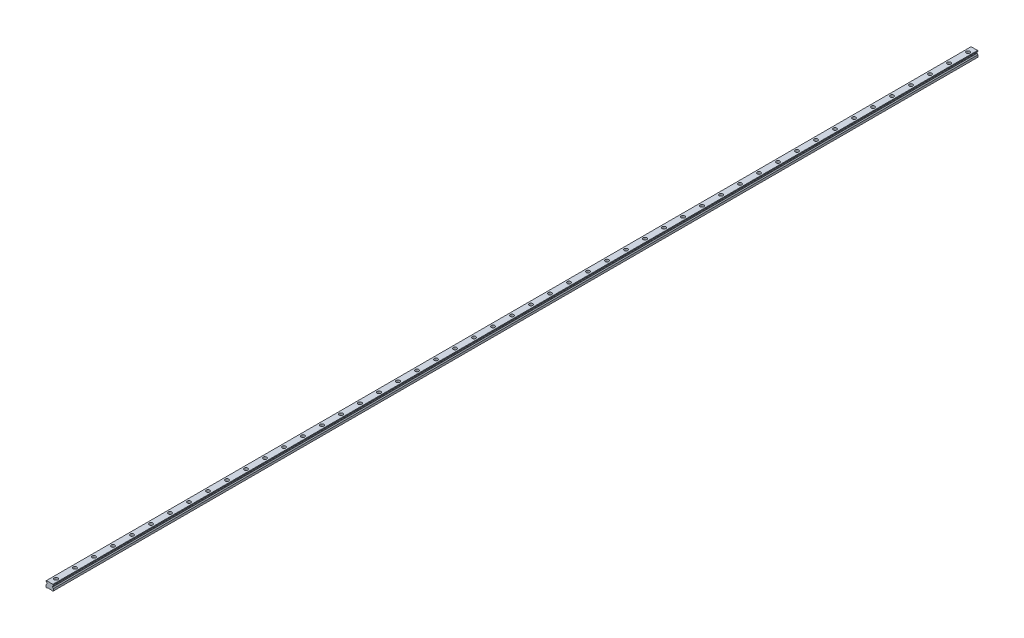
ISO-10303-21;
HEADER;
FILE_DESCRIPTION(('STEP AP214'),'2;1');
FILE_NAME('part.step','',(''),(''),'','','');
FILE_SCHEMA(('AUTOMOTIVE_DESIGN { 1 0 10303 214 1 1 1 1 }'));
ENDSEC;
DATA;
#1=APPLICATION_CONTEXT('core data for automotive mechanical design processes');
#2=APPLICATION_PROTOCOL_DEFINITION('international standard','automotive_design',2000,#1);
#3=PRODUCT_CONTEXT('',#1,'mechanical');
#4=PRODUCT('Part','Part','',(#3));
#5=PRODUCT_RELATED_PRODUCT_CATEGORY('part','',(#4));
#6=PRODUCT_DEFINITION_FORMATION('','',#4);
#7=PRODUCT_DEFINITION_CONTEXT('part definition',#1,'design');
#8=PRODUCT_DEFINITION('design','',#6,#7);
#9=PRODUCT_DEFINITION_SHAPE('','',#8);
#10=(LENGTH_UNIT() NAMED_UNIT(*) SI_UNIT(.MILLI.,.METRE.));
#11=(NAMED_UNIT(*) PLANE_ANGLE_UNIT() SI_UNIT($,.RADIAN.));
#12=(NAMED_UNIT(*) SI_UNIT($,.STERADIAN.) SOLID_ANGLE_UNIT());
#13=UNCERTAINTY_MEASURE_WITH_UNIT(LENGTH_MEASURE(1.E-05),#10,'distance_accuracy_value','');
#14=(GEOMETRIC_REPRESENTATION_CONTEXT(3) GLOBAL_UNCERTAINTY_ASSIGNED_CONTEXT((#13)) GLOBAL_UNIT_ASSIGNED_CONTEXT((#10,
#11,#12)) REPRESENTATION_CONTEXT('',''));
#15=CARTESIAN_POINT('',(0.,0.,0.));
#16=DIRECTION('',(0.,0.,1.));
#17=DIRECTION('',(1.,0.,0.));
#18=AXIS2_PLACEMENT_3D('',#15,#16,#17);
#19=CARTESIAN_POINT('',(0.,10.2,-1440.));
#20=DIRECTION('',(0.,1.,0.));
#21=DIRECTION('',(0.,0.,1.));
#22=AXIS2_PLACEMENT_3D('',#19,#20,#21);
#23=PLANE('',#22);
#24=CARTESIAN_POINT('',(0.,10.2,-1440.));
#25=DIRECTION('',(0.,1.,0.));
#26=DIRECTION('',(0.,0.,1.));
#27=AXIS2_PLACEMENT_3D('',#24,#25,#26);
#28=CIRCLE('',#27,3.49999999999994);
#29=CARTESIAN_POINT('',(0.,10.2,-1436.5));
#30=VERTEX_POINT('',#29);
#31=EDGE_CURVE('E735',#30,#30,#28,.T.);
#32=ORIENTED_EDGE('',*,*,#31,.F.);
#33=EDGE_LOOP('',(#32));
#34=FACE_BOUND('',#33,.T.);
#35=CARTESIAN_POINT('',(0.,10.2,-1440.));
#36=DIRECTION('',(0.,1.,0.));
#37=DIRECTION('',(0.,0.,1.));
#38=AXIS2_PLACEMENT_3D('',#35,#36,#37);
#39=CIRCLE('',#38,5.49999999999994);
#40=CARTESIAN_POINT('',(0.,10.2,-1434.5));
#41=VERTEX_POINT('',#40);
#42=EDGE_CURVE('E11',#41,#41,#39,.T.);
#43=ORIENTED_EDGE('',*,*,#42,.T.);
#44=EDGE_LOOP('',(#43));
#45=FACE_BOUND('',#44,.T.);
#46=ADVANCED_FACE('F39',(#34,#45),#23,.T.);
#47=CARTESIAN_POINT('',(0.,10.2,-1440.));
#48=DIRECTION('',(0.,1.,0.));
#49=DIRECTION('',(0.,0.,1.));
#50=AXIS2_PLACEMENT_3D('',#47,#48,#49);
#51=CYLINDRICAL_SURFACE('',#50,5.49999999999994);
#52=ORIENTED_EDGE('',*,*,#42,.F.);
#53=EDGE_LOOP('',(#52));
#54=FACE_BOUND('',#53,.T.);
#55=CARTESIAN_POINT('',(0.,19.2,-1440.));
#56=DIRECTION('',(0.,1.,0.));
#57=DIRECTION('',(0.,0.,1.));
#58=AXIS2_PLACEMENT_3D('',#55,#56,#57);
#59=CIRCLE('',#58,5.49999999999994);
#60=CARTESIAN_POINT('',(0.,19.2,-1434.5));
#61=VERTEX_POINT('',#60);
#62=EDGE_CURVE('E48',#61,#61,#59,.T.);
#63=ORIENTED_EDGE('',*,*,#62,.T.);
#64=EDGE_LOOP('',(#63));
#65=FACE_BOUND('',#64,.T.);
#66=ADVANCED_FACE('F1286',(#54,#65),#51,.F.);
#67=CARTESIAN_POINT('',(0.,10.2,-1380.));
#68=DIRECTION('',(0.,1.,0.));
#69=DIRECTION('',(0.,0.,1.));
#70=AXIS2_PLACEMENT_3D('',#67,#68,#69);
#71=PLANE('',#70);
#72=CARTESIAN_POINT('',(0.,10.2,-1380.));
#73=DIRECTION('',(0.,1.,0.));
#74=DIRECTION('',(0.,0.,1.));
#75=AXIS2_PLACEMENT_3D('',#72,#73,#74);
#76=CIRCLE('',#75,3.49999999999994);
#77=CARTESIAN_POINT('',(0.,10.2,-1376.5));
#78=VERTEX_POINT('',#77);
#79=EDGE_CURVE('E740',#78,#78,#76,.T.);
#80=ORIENTED_EDGE('',*,*,#79,.F.);
#81=EDGE_LOOP('',(#80));
#82=FACE_BOUND('',#81,.T.);
#83=CARTESIAN_POINT('',(0.,10.2,-1380.));
#84=DIRECTION('',(0.,1.,0.));
#85=DIRECTION('',(0.,0.,1.));
#86=AXIS2_PLACEMENT_3D('',#83,#84,#85);
#87=CIRCLE('',#86,5.49999999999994);
#88=CARTESIAN_POINT('',(0.,10.2,-1374.5));
#89=VERTEX_POINT('',#88);
#90=EDGE_CURVE('E719',#89,#89,#87,.T.);
#91=ORIENTED_EDGE('',*,*,#90,.T.);
#92=EDGE_LOOP('',(#91));
#93=FACE_BOUND('',#92,.T.);
#94=ADVANCED_FACE('F1288',(#82,#93),#71,.T.);
#95=CARTESIAN_POINT('',(0.,10.2,-1380.));
#96=DIRECTION('',(0.,1.,0.));
#97=DIRECTION('',(0.,0.,1.));
#98=AXIS2_PLACEMENT_3D('',#95,#96,#97);
#99=CYLINDRICAL_SURFACE('',#98,5.49999999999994);
#100=ORIENTED_EDGE('',*,*,#90,.F.);
#101=EDGE_LOOP('',(#100));
#102=FACE_BOUND('',#101,.T.);
#103=CARTESIAN_POINT('',(0.,19.2,-1380.));
#104=DIRECTION('',(0.,1.,0.));
#105=DIRECTION('',(0.,0.,1.));
#106=AXIS2_PLACEMENT_3D('',#103,#104,#105);
#107=CIRCLE('',#106,5.49999999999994);
#108=CARTESIAN_POINT('',(0.,19.2,-1374.5));
#109=VERTEX_POINT('',#108);
#110=EDGE_CURVE('E715',#109,#109,#107,.T.);
#111=ORIENTED_EDGE('',*,*,#110,.T.);
#112=EDGE_LOOP('',(#111));
#113=FACE_BOUND('',#112,.T.);
#114=ADVANCED_FACE('F1294',(#102,#113),#99,.F.);
#115=CARTESIAN_POINT('',(0.,10.2,-1320.));
#116=DIRECTION('',(0.,1.,0.));
#117=DIRECTION('',(0.,0.,1.));
#118=AXIS2_PLACEMENT_3D('',#115,#116,#117);
#119=PLANE('',#118);
#120=CARTESIAN_POINT('',(0.,10.2,-1320.));
#121=DIRECTION('',(0.,1.,0.));
#122=DIRECTION('',(0.,0.,1.));
#123=AXIS2_PLACEMENT_3D('',#120,#121,#122);
#124=CIRCLE('',#123,3.49999999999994);
#125=CARTESIAN_POINT('',(0.,10.2,-1316.5));
#126=VERTEX_POINT('',#125);
#127=EDGE_CURVE('E745',#126,#126,#124,.T.);
#128=ORIENTED_EDGE('',*,*,#127,.F.);
#129=EDGE_LOOP('',(#128));
#130=FACE_BOUND('',#129,.T.);
#131=CARTESIAN_POINT('',(0.,10.2,-1320.));
#132=DIRECTION('',(0.,1.,0.));
#133=DIRECTION('',(0.,0.,1.));
#134=AXIS2_PLACEMENT_3D('',#131,#132,#133);
#135=CIRCLE('',#134,5.49999999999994);
#136=CARTESIAN_POINT('',(0.,10.2,-1314.5));
#137=VERTEX_POINT('',#136);
#138=EDGE_CURVE('E711',#137,#137,#135,.T.);
#139=ORIENTED_EDGE('',*,*,#138,.T.);
#140=EDGE_LOOP('',(#139));
#141=FACE_BOUND('',#140,.T.);
#142=ADVANCED_FACE('F1302',(#130,#141),#119,.T.);
#143=CARTESIAN_POINT('',(0.,10.2,-1320.));
#144=DIRECTION('',(0.,1.,0.));
#145=DIRECTION('',(0.,0.,1.));
#146=AXIS2_PLACEMENT_3D('',#143,#144,#145);
#147=CYLINDRICAL_SURFACE('',#146,5.49999999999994);
#148=ORIENTED_EDGE('',*,*,#138,.F.);
#149=EDGE_LOOP('',(#148));
#150=FACE_BOUND('',#149,.T.);
#151=CARTESIAN_POINT('',(0.,19.2,-1320.));
#152=DIRECTION('',(0.,1.,0.));
#153=DIRECTION('',(0.,0.,1.));
#154=AXIS2_PLACEMENT_3D('',#151,#152,#153);
#155=CIRCLE('',#154,5.49999999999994);
#156=CARTESIAN_POINT('',(0.,19.2,-1314.5));
#157=VERTEX_POINT('',#156);
#158=EDGE_CURVE('E707',#157,#157,#155,.T.);
#159=ORIENTED_EDGE('',*,*,#158,.T.);
#160=EDGE_LOOP('',(#159));
#161=FACE_BOUND('',#160,.T.);
#162=ADVANCED_FACE('F1306',(#150,#161),#147,.F.);
#163=CARTESIAN_POINT('',(0.,10.2,-1260.));
#164=DIRECTION('',(0.,1.,0.));
#165=DIRECTION('',(0.,0.,1.));
#166=AXIS2_PLACEMENT_3D('',#163,#164,#165);
#167=PLANE('',#166);
#168=CARTESIAN_POINT('',(0.,10.2,-1260.));
#169=DIRECTION('',(0.,1.,0.));
#170=DIRECTION('',(0.,0.,1.));
#171=AXIS2_PLACEMENT_3D('',#168,#169,#170);
#172=CIRCLE('',#171,3.49999999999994);
#173=CARTESIAN_POINT('',(0.,10.2,-1256.5));
#174=VERTEX_POINT('',#173);
#175=EDGE_CURVE('E750',#174,#174,#172,.T.);
#176=ORIENTED_EDGE('',*,*,#175,.F.);
#177=EDGE_LOOP('',(#176));
#178=FACE_BOUND('',#177,.T.);
#179=CARTESIAN_POINT('',(0.,10.2,-1260.));
#180=DIRECTION('',(0.,1.,0.));
#181=DIRECTION('',(0.,0.,1.));
#182=AXIS2_PLACEMENT_3D('',#179,#180,#181);
#183=CIRCLE('',#182,5.49999999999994);
#184=CARTESIAN_POINT('',(0.,10.2,-1254.5));
#185=VERTEX_POINT('',#184);
#186=EDGE_CURVE('E703',#185,#185,#183,.T.);
#187=ORIENTED_EDGE('',*,*,#186,.T.);
#188=EDGE_LOOP('',(#187));
#189=FACE_BOUND('',#188,.T.);
#190=ADVANCED_FACE('F1310',(#178,#189),#167,.T.);
#191=CARTESIAN_POINT('',(0.,10.2,-1260.));
#192=DIRECTION('',(0.,1.,0.));
#193=DIRECTION('',(0.,0.,1.));
#194=AXIS2_PLACEMENT_3D('',#191,#192,#193);
#195=CYLINDRICAL_SURFACE('',#194,5.49999999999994);
#196=ORIENTED_EDGE('',*,*,#186,.F.);
#197=EDGE_LOOP('',(#196));
#198=FACE_BOUND('',#197,.T.);
#199=CARTESIAN_POINT('',(0.,19.2,-1260.));
#200=DIRECTION('',(0.,1.,0.));
#201=DIRECTION('',(0.,0.,1.));
#202=AXIS2_PLACEMENT_3D('',#199,#200,#201);
#203=CIRCLE('',#202,5.49999999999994);
#204=CARTESIAN_POINT('',(0.,19.2,-1254.5));
#205=VERTEX_POINT('',#204);
#206=EDGE_CURVE('E699',#205,#205,#203,.T.);
#207=ORIENTED_EDGE('',*,*,#206,.T.);
#208=EDGE_LOOP('',(#207));
#209=FACE_BOUND('',#208,.T.);
#210=ADVANCED_FACE('F1314',(#198,#209),#195,.F.);
#211=CARTESIAN_POINT('',(0.,10.2,-1200.));
#212=DIRECTION('',(0.,1.,0.));
#213=DIRECTION('',(0.,0.,1.));
#214=AXIS2_PLACEMENT_3D('',#211,#212,#213);
#215=PLANE('',#214);
#216=CARTESIAN_POINT('',(0.,10.2,-1200.));
#217=DIRECTION('',(0.,1.,0.));
#218=DIRECTION('',(0.,0.,1.));
#219=AXIS2_PLACEMENT_3D('',#216,#217,#218);
#220=CIRCLE('',#219,3.49999999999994);
#221=CARTESIAN_POINT('',(0.,10.2,-1196.5));
#222=VERTEX_POINT('',#221);
#223=EDGE_CURVE('E755',#222,#222,#220,.T.);
#224=ORIENTED_EDGE('',*,*,#223,.F.);
#225=EDGE_LOOP('',(#224));
#226=FACE_BOUND('',#225,.T.);
#227=CARTESIAN_POINT('',(0.,10.2,-1200.));
#228=DIRECTION('',(0.,1.,0.));
#229=DIRECTION('',(0.,0.,1.));
#230=AXIS2_PLACEMENT_3D('',#227,#228,#229);
#231=CIRCLE('',#230,5.49999999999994);
#232=CARTESIAN_POINT('',(0.,10.2,-1194.5));
#233=VERTEX_POINT('',#232);
#234=EDGE_CURVE('E695',#233,#233,#231,.T.);
#235=ORIENTED_EDGE('',*,*,#234,.T.);
#236=EDGE_LOOP('',(#235));
#237=FACE_BOUND('',#236,.T.);
#238=ADVANCED_FACE('F1318',(#226,#237),#215,.T.);
#239=CARTESIAN_POINT('',(0.,10.2,-1200.));
#240=DIRECTION('',(0.,1.,0.));
#241=DIRECTION('',(0.,0.,1.));
#242=AXIS2_PLACEMENT_3D('',#239,#240,#241);
#243=CYLINDRICAL_SURFACE('',#242,5.49999999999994);
#244=ORIENTED_EDGE('',*,*,#234,.F.);
#245=EDGE_LOOP('',(#244));
#246=FACE_BOUND('',#245,.T.);
#247=CARTESIAN_POINT('',(0.,19.2,-1200.));
#248=DIRECTION('',(0.,1.,0.));
#249=DIRECTION('',(0.,0.,1.));
#250=AXIS2_PLACEMENT_3D('',#247,#248,#249);
#251=CIRCLE('',#250,5.49999999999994);
#252=CARTESIAN_POINT('',(0.,19.2,-1194.5));
#253=VERTEX_POINT('',#252);
#254=EDGE_CURVE('E691',#253,#253,#251,.T.);
#255=ORIENTED_EDGE('',*,*,#254,.T.);
#256=EDGE_LOOP('',(#255));
#257=FACE_BOUND('',#256,.T.);
#258=ADVANCED_FACE('F1322',(#246,#257),#243,.F.);
#259=CARTESIAN_POINT('',(0.,10.2,-1140.));
#260=DIRECTION('',(0.,1.,0.));
#261=DIRECTION('',(0.,0.,1.));
#262=AXIS2_PLACEMENT_3D('',#259,#260,#261);
#263=PLANE('',#262);
#264=CARTESIAN_POINT('',(0.,10.2,-1140.));
#265=DIRECTION('',(0.,1.,0.));
#266=DIRECTION('',(0.,0.,1.));
#267=AXIS2_PLACEMENT_3D('',#264,#265,#266);
#268=CIRCLE('',#267,3.49999999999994);
#269=CARTESIAN_POINT('',(0.,10.2,-1136.5));
#270=VERTEX_POINT('',#269);
#271=EDGE_CURVE('E760',#270,#270,#268,.T.);
#272=ORIENTED_EDGE('',*,*,#271,.F.);
#273=EDGE_LOOP('',(#272));
#274=FACE_BOUND('',#273,.T.);
#275=CARTESIAN_POINT('',(0.,10.2,-1140.));
#276=DIRECTION('',(0.,1.,0.));
#277=DIRECTION('',(0.,0.,1.));
#278=AXIS2_PLACEMENT_3D('',#275,#276,#277);
#279=CIRCLE('',#278,5.49999999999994);
#280=CARTESIAN_POINT('',(0.,10.2,-1134.5));
#281=VERTEX_POINT('',#280);
#282=EDGE_CURVE('E687',#281,#281,#279,.T.);
#283=ORIENTED_EDGE('',*,*,#282,.T.);
#284=EDGE_LOOP('',(#283));
#285=FACE_BOUND('',#284,.T.);
#286=ADVANCED_FACE('F1326',(#274,#285),#263,.T.);
#287=CARTESIAN_POINT('',(0.,10.2,-1140.));
#288=DIRECTION('',(0.,1.,0.));
#289=DIRECTION('',(0.,0.,1.));
#290=AXIS2_PLACEMENT_3D('',#287,#288,#289);
#291=CYLINDRICAL_SURFACE('',#290,5.49999999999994);
#292=ORIENTED_EDGE('',*,*,#282,.F.);
#293=EDGE_LOOP('',(#292));
#294=FACE_BOUND('',#293,.T.);
#295=CARTESIAN_POINT('',(0.,19.2,-1140.));
#296=DIRECTION('',(0.,1.,0.));
#297=DIRECTION('',(0.,0.,1.));
#298=AXIS2_PLACEMENT_3D('',#295,#296,#297);
#299=CIRCLE('',#298,5.49999999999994);
#300=CARTESIAN_POINT('',(0.,19.2,-1134.5));
#301=VERTEX_POINT('',#300);
#302=EDGE_CURVE('E683',#301,#301,#299,.T.);
#303=ORIENTED_EDGE('',*,*,#302,.T.);
#304=EDGE_LOOP('',(#303));
#305=FACE_BOUND('',#304,.T.);
#306=ADVANCED_FACE('F1330',(#294,#305),#291,.F.);
#307=CARTESIAN_POINT('',(0.,10.2,-1080.));
#308=DIRECTION('',(0.,1.,0.));
#309=DIRECTION('',(0.,0.,1.));
#310=AXIS2_PLACEMENT_3D('',#307,#308,#309);
#311=PLANE('',#310);
#312=CARTESIAN_POINT('',(0.,10.2,-1080.));
#313=DIRECTION('',(0.,1.,0.));
#314=DIRECTION('',(0.,0.,1.));
#315=AXIS2_PLACEMENT_3D('',#312,#313,#314);
#316=CIRCLE('',#315,3.49999999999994);
#317=CARTESIAN_POINT('',(0.,10.2,-1076.5));
#318=VERTEX_POINT('',#317);
#319=EDGE_CURVE('E765',#318,#318,#316,.T.);
#320=ORIENTED_EDGE('',*,*,#319,.F.);
#321=EDGE_LOOP('',(#320));
#322=FACE_BOUND('',#321,.T.);
#323=CARTESIAN_POINT('',(0.,10.2,-1080.));
#324=DIRECTION('',(0.,1.,0.));
#325=DIRECTION('',(0.,0.,1.));
#326=AXIS2_PLACEMENT_3D('',#323,#324,#325);
#327=CIRCLE('',#326,5.49999999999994);
#328=CARTESIAN_POINT('',(0.,10.2,-1074.5));
#329=VERTEX_POINT('',#328);
#330=EDGE_CURVE('E679',#329,#329,#327,.T.);
#331=ORIENTED_EDGE('',*,*,#330,.T.);
#332=EDGE_LOOP('',(#331));
#333=FACE_BOUND('',#332,.T.);
#334=ADVANCED_FACE('F1334',(#322,#333),#311,.T.);
#335=CARTESIAN_POINT('',(0.,10.2,-1080.));
#336=DIRECTION('',(0.,1.,0.));
#337=DIRECTION('',(0.,0.,1.));
#338=AXIS2_PLACEMENT_3D('',#335,#336,#337);
#339=CYLINDRICAL_SURFACE('',#338,5.49999999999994);
#340=ORIENTED_EDGE('',*,*,#330,.F.);
#341=EDGE_LOOP('',(#340));
#342=FACE_BOUND('',#341,.T.);
#343=CARTESIAN_POINT('',(0.,19.2,-1080.));
#344=DIRECTION('',(0.,1.,0.));
#345=DIRECTION('',(0.,0.,1.));
#346=AXIS2_PLACEMENT_3D('',#343,#344,#345);
#347=CIRCLE('',#346,5.49999999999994);
#348=CARTESIAN_POINT('',(0.,19.2,-1074.5));
#349=VERTEX_POINT('',#348);
#350=EDGE_CURVE('E675',#349,#349,#347,.T.);
#351=ORIENTED_EDGE('',*,*,#350,.T.);
#352=EDGE_LOOP('',(#351));
#353=FACE_BOUND('',#352,.T.);
#354=ADVANCED_FACE('F1338',(#342,#353),#339,.F.);
#355=CARTESIAN_POINT('',(0.,10.2,-1020.));
#356=DIRECTION('',(0.,1.,0.));
#357=DIRECTION('',(0.,0.,1.));
#358=AXIS2_PLACEMENT_3D('',#355,#356,#357);
#359=PLANE('',#358);
#360=CARTESIAN_POINT('',(0.,10.2,-1020.));
#361=DIRECTION('',(0.,1.,0.));
#362=DIRECTION('',(0.,0.,1.));
#363=AXIS2_PLACEMENT_3D('',#360,#361,#362);
#364=CIRCLE('',#363,3.49999999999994);
#365=CARTESIAN_POINT('',(0.,10.2,-1016.5));
#366=VERTEX_POINT('',#365);
#367=EDGE_CURVE('E770',#366,#366,#364,.T.);
#368=ORIENTED_EDGE('',*,*,#367,.F.);
#369=EDGE_LOOP('',(#368));
#370=FACE_BOUND('',#369,.T.);
#371=CARTESIAN_POINT('',(0.,10.2,-1020.));
#372=DIRECTION('',(0.,1.,0.));
#373=DIRECTION('',(0.,0.,1.));
#374=AXIS2_PLACEMENT_3D('',#371,#372,#373);
#375=CIRCLE('',#374,5.49999999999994);
#376=CARTESIAN_POINT('',(0.,10.2,-1014.5));
#377=VERTEX_POINT('',#376);
#378=EDGE_CURVE('E671',#377,#377,#375,.T.);
#379=ORIENTED_EDGE('',*,*,#378,.T.);
#380=EDGE_LOOP('',(#379));
#381=FACE_BOUND('',#380,.T.);
#382=ADVANCED_FACE('F1342',(#370,#381),#359,.T.);
#383=CARTESIAN_POINT('',(0.,10.2,-1020.));
#384=DIRECTION('',(0.,1.,0.));
#385=DIRECTION('',(0.,0.,1.));
#386=AXIS2_PLACEMENT_3D('',#383,#384,#385);
#387=CYLINDRICAL_SURFACE('',#386,5.49999999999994);
#388=ORIENTED_EDGE('',*,*,#378,.F.);
#389=EDGE_LOOP('',(#388));
#390=FACE_BOUND('',#389,.T.);
#391=CARTESIAN_POINT('',(0.,19.2,-1020.));
#392=DIRECTION('',(0.,1.,0.));
#393=DIRECTION('',(0.,0.,1.));
#394=AXIS2_PLACEMENT_3D('',#391,#392,#393);
#395=CIRCLE('',#394,5.49999999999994);
#396=CARTESIAN_POINT('',(0.,19.2,-1014.5));
#397=VERTEX_POINT('',#396);
#398=EDGE_CURVE('E667',#397,#397,#395,.T.);
#399=ORIENTED_EDGE('',*,*,#398,.T.);
#400=EDGE_LOOP('',(#399));
#401=FACE_BOUND('',#400,.T.);
#402=ADVANCED_FACE('F1346',(#390,#401),#387,.F.);
#403=CARTESIAN_POINT('',(0.,10.2,-960.));
#404=DIRECTION('',(0.,1.,0.));
#405=DIRECTION('',(0.,0.,1.));
#406=AXIS2_PLACEMENT_3D('',#403,#404,#405);
#407=PLANE('',#406);
#408=CARTESIAN_POINT('',(0.,10.2,-960.));
#409=DIRECTION('',(0.,1.,0.));
#410=DIRECTION('',(0.,0.,1.));
#411=AXIS2_PLACEMENT_3D('',#408,#409,#410);
#412=CIRCLE('',#411,3.49999999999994);
#413=CARTESIAN_POINT('',(0.,10.2,-956.5));
#414=VERTEX_POINT('',#413);
#415=EDGE_CURVE('E775',#414,#414,#412,.T.);
#416=ORIENTED_EDGE('',*,*,#415,.F.);
#417=EDGE_LOOP('',(#416));
#418=FACE_BOUND('',#417,.T.);
#419=CARTESIAN_POINT('',(0.,10.2,-960.));
#420=DIRECTION('',(0.,1.,0.));
#421=DIRECTION('',(0.,0.,1.));
#422=AXIS2_PLACEMENT_3D('',#419,#420,#421);
#423=CIRCLE('',#422,5.49999999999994);
#424=CARTESIAN_POINT('',(0.,10.2,-954.5));
#425=VERTEX_POINT('',#424);
#426=EDGE_CURVE('E663',#425,#425,#423,.T.);
#427=ORIENTED_EDGE('',*,*,#426,.T.);
#428=EDGE_LOOP('',(#427));
#429=FACE_BOUND('',#428,.T.);
#430=ADVANCED_FACE('F1350',(#418,#429),#407,.T.);
#431=CARTESIAN_POINT('',(0.,10.2,-960.));
#432=DIRECTION('',(0.,1.,0.));
#433=DIRECTION('',(0.,0.,1.));
#434=AXIS2_PLACEMENT_3D('',#431,#432,#433);
#435=CYLINDRICAL_SURFACE('',#434,5.49999999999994);
#436=ORIENTED_EDGE('',*,*,#426,.F.);
#437=EDGE_LOOP('',(#436));
#438=FACE_BOUND('',#437,.T.);
#439=CARTESIAN_POINT('',(0.,19.2,-960.));
#440=DIRECTION('',(0.,1.,0.));
#441=DIRECTION('',(0.,0.,1.));
#442=AXIS2_PLACEMENT_3D('',#439,#440,#441);
#443=CIRCLE('',#442,5.49999999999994);
#444=CARTESIAN_POINT('',(0.,19.2,-954.5));
#445=VERTEX_POINT('',#444);
#446=EDGE_CURVE('E659',#445,#445,#443,.T.);
#447=ORIENTED_EDGE('',*,*,#446,.T.);
#448=EDGE_LOOP('',(#447));
#449=FACE_BOUND('',#448,.T.);
#450=ADVANCED_FACE('F1354',(#438,#449),#435,.F.);
#451=CARTESIAN_POINT('',(0.,10.2,-900.));
#452=DIRECTION('',(0.,1.,0.));
#453=DIRECTION('',(0.,0.,1.));
#454=AXIS2_PLACEMENT_3D('',#451,#452,#453);
#455=PLANE('',#454);
#456=CARTESIAN_POINT('',(0.,10.2,-900.));
#457=DIRECTION('',(0.,1.,0.));
#458=DIRECTION('',(0.,0.,1.));
#459=AXIS2_PLACEMENT_3D('',#456,#457,#458);
#460=CIRCLE('',#459,3.49999999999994);
#461=CARTESIAN_POINT('',(0.,10.2,-896.5));
#462=VERTEX_POINT('',#461);
#463=EDGE_CURVE('E780',#462,#462,#460,.T.);
#464=ORIENTED_EDGE('',*,*,#463,.F.);
#465=EDGE_LOOP('',(#464));
#466=FACE_BOUND('',#465,.T.);
#467=CARTESIAN_POINT('',(0.,10.2,-900.));
#468=DIRECTION('',(0.,1.,0.));
#469=DIRECTION('',(0.,0.,1.));
#470=AXIS2_PLACEMENT_3D('',#467,#468,#469);
#471=CIRCLE('',#470,5.49999999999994);
#472=CARTESIAN_POINT('',(0.,10.2,-894.5));
#473=VERTEX_POINT('',#472);
#474=EDGE_CURVE('E655',#473,#473,#471,.T.);
#475=ORIENTED_EDGE('',*,*,#474,.T.);
#476=EDGE_LOOP('',(#475));
#477=FACE_BOUND('',#476,.T.);
#478=ADVANCED_FACE('F1358',(#466,#477),#455,.T.);
#479=CARTESIAN_POINT('',(0.,10.2,-900.));
#480=DIRECTION('',(0.,1.,0.));
#481=DIRECTION('',(0.,0.,1.));
#482=AXIS2_PLACEMENT_3D('',#479,#480,#481);
#483=CYLINDRICAL_SURFACE('',#482,5.49999999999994);
#484=ORIENTED_EDGE('',*,*,#474,.F.);
#485=EDGE_LOOP('',(#484));
#486=FACE_BOUND('',#485,.T.);
#487=CARTESIAN_POINT('',(0.,19.2,-900.));
#488=DIRECTION('',(0.,1.,0.));
#489=DIRECTION('',(0.,0.,1.));
#490=AXIS2_PLACEMENT_3D('',#487,#488,#489);
#491=CIRCLE('',#490,5.49999999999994);
#492=CARTESIAN_POINT('',(0.,19.2,-894.5));
#493=VERTEX_POINT('',#492);
#494=EDGE_CURVE('E651',#493,#493,#491,.T.);
#495=ORIENTED_EDGE('',*,*,#494,.T.);
#496=EDGE_LOOP('',(#495));
#497=FACE_BOUND('',#496,.T.);
#498=ADVANCED_FACE('F1362',(#486,#497),#483,.F.);
#499=CARTESIAN_POINT('',(0.,10.2,-840.));
#500=DIRECTION('',(0.,1.,0.));
#501=DIRECTION('',(0.,0.,1.));
#502=AXIS2_PLACEMENT_3D('',#499,#500,#501);
#503=PLANE('',#502);
#504=CARTESIAN_POINT('',(0.,10.2,-840.));
#505=DIRECTION('',(0.,1.,0.));
#506=DIRECTION('',(0.,0.,1.));
#507=AXIS2_PLACEMENT_3D('',#504,#505,#506);
#508=CIRCLE('',#507,3.49999999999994);
#509=CARTESIAN_POINT('',(0.,10.2,-836.5));
#510=VERTEX_POINT('',#509);
#511=EDGE_CURVE('E785',#510,#510,#508,.T.);
#512=ORIENTED_EDGE('',*,*,#511,.F.);
#513=EDGE_LOOP('',(#512));
#514=FACE_BOUND('',#513,.T.);
#515=CARTESIAN_POINT('',(0.,10.2,-840.));
#516=DIRECTION('',(0.,1.,0.));
#517=DIRECTION('',(0.,0.,1.));
#518=AXIS2_PLACEMENT_3D('',#515,#516,#517);
#519=CIRCLE('',#518,5.49999999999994);
#520=CARTESIAN_POINT('',(0.,10.2,-834.5));
#521=VERTEX_POINT('',#520);
#522=EDGE_CURVE('E647',#521,#521,#519,.T.);
#523=ORIENTED_EDGE('',*,*,#522,.T.);
#524=EDGE_LOOP('',(#523));
#525=FACE_BOUND('',#524,.T.);
#526=ADVANCED_FACE('F1366',(#514,#525),#503,.T.);
#527=CARTESIAN_POINT('',(0.,10.2,-840.));
#528=DIRECTION('',(0.,1.,0.));
#529=DIRECTION('',(0.,0.,1.));
#530=AXIS2_PLACEMENT_3D('',#527,#528,#529);
#531=CYLINDRICAL_SURFACE('',#530,5.49999999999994);
#532=ORIENTED_EDGE('',*,*,#522,.F.);
#533=EDGE_LOOP('',(#532));
#534=FACE_BOUND('',#533,.T.);
#535=CARTESIAN_POINT('',(0.,19.2,-840.));
#536=DIRECTION('',(0.,1.,0.));
#537=DIRECTION('',(0.,0.,1.));
#538=AXIS2_PLACEMENT_3D('',#535,#536,#537);
#539=CIRCLE('',#538,5.49999999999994);
#540=CARTESIAN_POINT('',(0.,19.2,-834.5));
#541=VERTEX_POINT('',#540);
#542=EDGE_CURVE('E643',#541,#541,#539,.T.);
#543=ORIENTED_EDGE('',*,*,#542,.T.);
#544=EDGE_LOOP('',(#543));
#545=FACE_BOUND('',#544,.T.);
#546=ADVANCED_FACE('F1370',(#534,#545),#531,.F.);
#547=CARTESIAN_POINT('',(0.,10.2,-780.));
#548=DIRECTION('',(0.,1.,0.));
#549=DIRECTION('',(0.,0.,1.));
#550=AXIS2_PLACEMENT_3D('',#547,#548,#549);
#551=PLANE('',#550);
#552=CARTESIAN_POINT('',(0.,10.2,-780.));
#553=DIRECTION('',(0.,1.,0.));
#554=DIRECTION('',(0.,0.,1.));
#555=AXIS2_PLACEMENT_3D('',#552,#553,#554);
#556=CIRCLE('',#555,3.49999999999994);
#557=CARTESIAN_POINT('',(0.,10.2,-776.5));
#558=VERTEX_POINT('',#557);
#559=EDGE_CURVE('E790',#558,#558,#556,.T.);
#560=ORIENTED_EDGE('',*,*,#559,.F.);
#561=EDGE_LOOP('',(#560));
#562=FACE_BOUND('',#561,.T.);
#563=CARTESIAN_POINT('',(0.,10.2,-780.));
#564=DIRECTION('',(0.,1.,0.));
#565=DIRECTION('',(0.,0.,1.));
#566=AXIS2_PLACEMENT_3D('',#563,#564,#565);
#567=CIRCLE('',#566,5.49999999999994);
#568=CARTESIAN_POINT('',(0.,10.2,-774.5));
#569=VERTEX_POINT('',#568);
#570=EDGE_CURVE('E639',#569,#569,#567,.T.);
#571=ORIENTED_EDGE('',*,*,#570,.T.);
#572=EDGE_LOOP('',(#571));
#573=FACE_BOUND('',#572,.T.);
#574=ADVANCED_FACE('F1374',(#562,#573),#551,.T.);
#575=CARTESIAN_POINT('',(0.,10.2,-780.));
#576=DIRECTION('',(0.,1.,0.));
#577=DIRECTION('',(0.,0.,1.));
#578=AXIS2_PLACEMENT_3D('',#575,#576,#577);
#579=CYLINDRICAL_SURFACE('',#578,5.49999999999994);
#580=ORIENTED_EDGE('',*,*,#570,.F.);
#581=EDGE_LOOP('',(#580));
#582=FACE_BOUND('',#581,.T.);
#583=CARTESIAN_POINT('',(0.,19.2,-780.));
#584=DIRECTION('',(0.,1.,0.));
#585=DIRECTION('',(0.,0.,1.));
#586=AXIS2_PLACEMENT_3D('',#583,#584,#585);
#587=CIRCLE('',#586,5.49999999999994);
#588=CARTESIAN_POINT('',(0.,19.2,-774.5));
#589=VERTEX_POINT('',#588);
#590=EDGE_CURVE('E635',#589,#589,#587,.T.);
#591=ORIENTED_EDGE('',*,*,#590,.T.);
#592=EDGE_LOOP('',(#591));
#593=FACE_BOUND('',#592,.T.);
#594=ADVANCED_FACE('F1378',(#582,#593),#579,.F.);
#595=CARTESIAN_POINT('',(0.,10.2,-720.));
#596=DIRECTION('',(0.,1.,0.));
#597=DIRECTION('',(0.,0.,1.));
#598=AXIS2_PLACEMENT_3D('',#595,#596,#597);
#599=PLANE('',#598);
#600=CARTESIAN_POINT('',(0.,10.2,-720.));
#601=DIRECTION('',(0.,1.,0.));
#602=DIRECTION('',(0.,0.,1.));
#603=AXIS2_PLACEMENT_3D('',#600,#601,#602);
#604=CIRCLE('',#603,3.49999999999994);
#605=CARTESIAN_POINT('',(0.,10.2,-716.5));
#606=VERTEX_POINT('',#605);
#607=EDGE_CURVE('E795',#606,#606,#604,.T.);
#608=ORIENTED_EDGE('',*,*,#607,.F.);
#609=EDGE_LOOP('',(#608));
#610=FACE_BOUND('',#609,.T.);
#611=CARTESIAN_POINT('',(0.,10.2,-720.));
#612=DIRECTION('',(0.,1.,0.));
#613=DIRECTION('',(0.,0.,1.));
#614=AXIS2_PLACEMENT_3D('',#611,#612,#613);
#615=CIRCLE('',#614,5.49999999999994);
#616=CARTESIAN_POINT('',(0.,10.2,-714.5));
#617=VERTEX_POINT('',#616);
#618=EDGE_CURVE('E631',#617,#617,#615,.T.);
#619=ORIENTED_EDGE('',*,*,#618,.T.);
#620=EDGE_LOOP('',(#619));
#621=FACE_BOUND('',#620,.T.);
#622=ADVANCED_FACE('F1382',(#610,#621),#599,.T.);
#623=CARTESIAN_POINT('',(0.,10.2,-720.));
#624=DIRECTION('',(0.,1.,0.));
#625=DIRECTION('',(0.,0.,1.));
#626=AXIS2_PLACEMENT_3D('',#623,#624,#625);
#627=CYLINDRICAL_SURFACE('',#626,5.49999999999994);
#628=ORIENTED_EDGE('',*,*,#618,.F.);
#629=EDGE_LOOP('',(#628));
#630=FACE_BOUND('',#629,.T.);
#631=CARTESIAN_POINT('',(0.,19.2,-720.));
#632=DIRECTION('',(0.,1.,0.));
#633=DIRECTION('',(0.,0.,1.));
#634=AXIS2_PLACEMENT_3D('',#631,#632,#633);
#635=CIRCLE('',#634,5.49999999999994);
#636=CARTESIAN_POINT('',(0.,19.2,-714.5));
#637=VERTEX_POINT('',#636);
#638=EDGE_CURVE('E627',#637,#637,#635,.T.);
#639=ORIENTED_EDGE('',*,*,#638,.T.);
#640=EDGE_LOOP('',(#639));
#641=FACE_BOUND('',#640,.T.);
#642=ADVANCED_FACE('F1386',(#630,#641),#627,.F.);
#643=CARTESIAN_POINT('',(0.,10.2,-660.));
#644=DIRECTION('',(0.,1.,0.));
#645=DIRECTION('',(0.,0.,1.));
#646=AXIS2_PLACEMENT_3D('',#643,#644,#645);
#647=PLANE('',#646);
#648=CARTESIAN_POINT('',(0.,10.2,-660.));
#649=DIRECTION('',(0.,1.,0.));
#650=DIRECTION('',(0.,0.,1.));
#651=AXIS2_PLACEMENT_3D('',#648,#649,#650);
#652=CIRCLE('',#651,3.49999999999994);
#653=CARTESIAN_POINT('',(0.,10.2,-656.5));
#654=VERTEX_POINT('',#653);
#655=EDGE_CURVE('E800',#654,#654,#652,.T.);
#656=ORIENTED_EDGE('',*,*,#655,.F.);
#657=EDGE_LOOP('',(#656));
#658=FACE_BOUND('',#657,.T.);
#659=CARTESIAN_POINT('',(0.,10.2,-660.));
#660=DIRECTION('',(0.,1.,0.));
#661=DIRECTION('',(0.,0.,1.));
#662=AXIS2_PLACEMENT_3D('',#659,#660,#661);
#663=CIRCLE('',#662,5.49999999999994);
#664=CARTESIAN_POINT('',(0.,10.2,-654.5));
#665=VERTEX_POINT('',#664);
#666=EDGE_CURVE('E623',#665,#665,#663,.T.);
#667=ORIENTED_EDGE('',*,*,#666,.T.);
#668=EDGE_LOOP('',(#667));
#669=FACE_BOUND('',#668,.T.);
#670=ADVANCED_FACE('F1390',(#658,#669),#647,.T.);
#671=CARTESIAN_POINT('',(0.,10.2,-660.));
#672=DIRECTION('',(0.,1.,0.));
#673=DIRECTION('',(0.,0.,1.));
#674=AXIS2_PLACEMENT_3D('',#671,#672,#673);
#675=CYLINDRICAL_SURFACE('',#674,5.49999999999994);
#676=ORIENTED_EDGE('',*,*,#666,.F.);
#677=EDGE_LOOP('',(#676));
#678=FACE_BOUND('',#677,.T.);
#679=CARTESIAN_POINT('',(0.,19.2,-660.));
#680=DIRECTION('',(0.,1.,0.));
#681=DIRECTION('',(0.,0.,1.));
#682=AXIS2_PLACEMENT_3D('',#679,#680,#681);
#683=CIRCLE('',#682,5.49999999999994);
#684=CARTESIAN_POINT('',(0.,19.2,-654.5));
#685=VERTEX_POINT('',#684);
#686=EDGE_CURVE('E619',#685,#685,#683,.T.);
#687=ORIENTED_EDGE('',*,*,#686,.T.);
#688=EDGE_LOOP('',(#687));
#689=FACE_BOUND('',#688,.T.);
#690=ADVANCED_FACE('F1394',(#678,#689),#675,.F.);
#691=CARTESIAN_POINT('',(0.,10.2,-600.));
#692=DIRECTION('',(0.,1.,0.));
#693=DIRECTION('',(0.,0.,1.));
#694=AXIS2_PLACEMENT_3D('',#691,#692,#693);
#695=PLANE('',#694);
#696=CARTESIAN_POINT('',(0.,10.2,-600.));
#697=DIRECTION('',(0.,1.,0.));
#698=DIRECTION('',(0.,0.,1.));
#699=AXIS2_PLACEMENT_3D('',#696,#697,#698);
#700=CIRCLE('',#699,3.49999999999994);
#701=CARTESIAN_POINT('',(0.,10.2,-596.5));
#702=VERTEX_POINT('',#701);
#703=EDGE_CURVE('E805',#702,#702,#700,.T.);
#704=ORIENTED_EDGE('',*,*,#703,.F.);
#705=EDGE_LOOP('',(#704));
#706=FACE_BOUND('',#705,.T.);
#707=CARTESIAN_POINT('',(0.,10.2,-600.));
#708=DIRECTION('',(0.,1.,0.));
#709=DIRECTION('',(0.,0.,1.));
#710=AXIS2_PLACEMENT_3D('',#707,#708,#709);
#711=CIRCLE('',#710,5.49999999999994);
#712=CARTESIAN_POINT('',(0.,10.2,-594.5));
#713=VERTEX_POINT('',#712);
#714=EDGE_CURVE('E615',#713,#713,#711,.T.);
#715=ORIENTED_EDGE('',*,*,#714,.T.);
#716=EDGE_LOOP('',(#715));
#717=FACE_BOUND('',#716,.T.);
#718=ADVANCED_FACE('F1398',(#706,#717),#695,.T.);
#719=CARTESIAN_POINT('',(0.,10.2,-600.));
#720=DIRECTION('',(0.,1.,0.));
#721=DIRECTION('',(0.,0.,1.));
#722=AXIS2_PLACEMENT_3D('',#719,#720,#721);
#723=CYLINDRICAL_SURFACE('',#722,5.49999999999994);
#724=ORIENTED_EDGE('',*,*,#714,.F.);
#725=EDGE_LOOP('',(#724));
#726=FACE_BOUND('',#725,.T.);
#727=CARTESIAN_POINT('',(0.,19.2,-600.));
#728=DIRECTION('',(0.,1.,0.));
#729=DIRECTION('',(0.,0.,1.));
#730=AXIS2_PLACEMENT_3D('',#727,#728,#729);
#731=CIRCLE('',#730,5.49999999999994);
#732=CARTESIAN_POINT('',(0.,19.2,-594.5));
#733=VERTEX_POINT('',#732);
#734=EDGE_CURVE('E611',#733,#733,#731,.T.);
#735=ORIENTED_EDGE('',*,*,#734,.T.);
#736=EDGE_LOOP('',(#735));
#737=FACE_BOUND('',#736,.T.);
#738=ADVANCED_FACE('F1402',(#726,#737),#723,.F.);
#739=CARTESIAN_POINT('',(0.,10.2,-540.));
#740=DIRECTION('',(0.,1.,0.));
#741=DIRECTION('',(0.,0.,1.));
#742=AXIS2_PLACEMENT_3D('',#739,#740,#741);
#743=PLANE('',#742);
#744=CARTESIAN_POINT('',(0.,10.2,-540.));
#745=DIRECTION('',(0.,1.,0.));
#746=DIRECTION('',(0.,0.,1.));
#747=AXIS2_PLACEMENT_3D('',#744,#745,#746);
#748=CIRCLE('',#747,3.49999999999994);
#749=CARTESIAN_POINT('',(0.,10.2,-536.5));
#750=VERTEX_POINT('',#749);
#751=EDGE_CURVE('E810',#750,#750,#748,.T.);
#752=ORIENTED_EDGE('',*,*,#751,.F.);
#753=EDGE_LOOP('',(#752));
#754=FACE_BOUND('',#753,.T.);
#755=CARTESIAN_POINT('',(0.,10.2,-540.));
#756=DIRECTION('',(0.,1.,0.));
#757=DIRECTION('',(0.,0.,1.));
#758=AXIS2_PLACEMENT_3D('',#755,#756,#757);
#759=CIRCLE('',#758,5.49999999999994);
#760=CARTESIAN_POINT('',(0.,10.2,-534.5));
#761=VERTEX_POINT('',#760);
#762=EDGE_CURVE('E607',#761,#761,#759,.T.);
#763=ORIENTED_EDGE('',*,*,#762,.T.);
#764=EDGE_LOOP('',(#763));
#765=FACE_BOUND('',#764,.T.);
#766=ADVANCED_FACE('F1406',(#754,#765),#743,.T.);
#767=CARTESIAN_POINT('',(0.,10.2,-540.));
#768=DIRECTION('',(0.,1.,0.));
#769=DIRECTION('',(0.,0.,1.));
#770=AXIS2_PLACEMENT_3D('',#767,#768,#769);
#771=CYLINDRICAL_SURFACE('',#770,5.49999999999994);
#772=ORIENTED_EDGE('',*,*,#762,.F.);
#773=EDGE_LOOP('',(#772));
#774=FACE_BOUND('',#773,.T.);
#775=CARTESIAN_POINT('',(0.,19.2,-540.));
#776=DIRECTION('',(0.,1.,0.));
#777=DIRECTION('',(0.,0.,1.));
#778=AXIS2_PLACEMENT_3D('',#775,#776,#777);
#779=CIRCLE('',#778,5.49999999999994);
#780=CARTESIAN_POINT('',(0.,19.2,-534.5));
#781=VERTEX_POINT('',#780);
#782=EDGE_CURVE('E603',#781,#781,#779,.T.);
#783=ORIENTED_EDGE('',*,*,#782,.T.);
#784=EDGE_LOOP('',(#783));
#785=FACE_BOUND('',#784,.T.);
#786=ADVANCED_FACE('F1410',(#774,#785),#771,.F.);
#787=CARTESIAN_POINT('',(0.,10.2,-480.));
#788=DIRECTION('',(0.,1.,0.));
#789=DIRECTION('',(0.,0.,1.));
#790=AXIS2_PLACEMENT_3D('',#787,#788,#789);
#791=PLANE('',#790);
#792=CARTESIAN_POINT('',(0.,10.2,-480.));
#793=DIRECTION('',(0.,1.,0.));
#794=DIRECTION('',(0.,0.,1.));
#795=AXIS2_PLACEMENT_3D('',#792,#793,#794);
#796=CIRCLE('',#795,3.49999999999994);
#797=CARTESIAN_POINT('',(0.,10.2,-476.5));
#798=VERTEX_POINT('',#797);
#799=EDGE_CURVE('E815',#798,#798,#796,.T.);
#800=ORIENTED_EDGE('',*,*,#799,.F.);
#801=EDGE_LOOP('',(#800));
#802=FACE_BOUND('',#801,.T.);
#803=CARTESIAN_POINT('',(0.,10.2,-480.));
#804=DIRECTION('',(0.,1.,0.));
#805=DIRECTION('',(0.,0.,1.));
#806=AXIS2_PLACEMENT_3D('',#803,#804,#805);
#807=CIRCLE('',#806,5.49999999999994);
#808=CARTESIAN_POINT('',(0.,10.2,-474.5));
#809=VERTEX_POINT('',#808);
#810=EDGE_CURVE('E599',#809,#809,#807,.T.);
#811=ORIENTED_EDGE('',*,*,#810,.T.);
#812=EDGE_LOOP('',(#811));
#813=FACE_BOUND('',#812,.T.);
#814=ADVANCED_FACE('F1414',(#802,#813),#791,.T.);
#815=CARTESIAN_POINT('',(0.,10.2,-480.));
#816=DIRECTION('',(0.,1.,0.));
#817=DIRECTION('',(0.,0.,1.));
#818=AXIS2_PLACEMENT_3D('',#815,#816,#817);
#819=CYLINDRICAL_SURFACE('',#818,5.49999999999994);
#820=ORIENTED_EDGE('',*,*,#810,.F.);
#821=EDGE_LOOP('',(#820));
#822=FACE_BOUND('',#821,.T.);
#823=CARTESIAN_POINT('',(0.,19.2,-480.));
#824=DIRECTION('',(0.,1.,0.));
#825=DIRECTION('',(0.,0.,1.));
#826=AXIS2_PLACEMENT_3D('',#823,#824,#825);
#827=CIRCLE('',#826,5.49999999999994);
#828=CARTESIAN_POINT('',(0.,19.2,-474.5));
#829=VERTEX_POINT('',#828);
#830=EDGE_CURVE('E595',#829,#829,#827,.T.);
#831=ORIENTED_EDGE('',*,*,#830,.T.);
#832=EDGE_LOOP('',(#831));
#833=FACE_BOUND('',#832,.T.);
#834=ADVANCED_FACE('F1418',(#822,#833),#819,.F.);
#835=CARTESIAN_POINT('',(0.,10.2,-420.));
#836=DIRECTION('',(0.,1.,0.));
#837=DIRECTION('',(0.,0.,1.));
#838=AXIS2_PLACEMENT_3D('',#835,#836,#837);
#839=PLANE('',#838);
#840=CARTESIAN_POINT('',(0.,10.2,-420.));
#841=DIRECTION('',(0.,1.,0.));
#842=DIRECTION('',(0.,0.,1.));
#843=AXIS2_PLACEMENT_3D('',#840,#841,#842);
#844=CIRCLE('',#843,3.49999999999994);
#845=CARTESIAN_POINT('',(0.,10.2,-416.5));
#846=VERTEX_POINT('',#845);
#847=EDGE_CURVE('E820',#846,#846,#844,.T.);
#848=ORIENTED_EDGE('',*,*,#847,.F.);
#849=EDGE_LOOP('',(#848));
#850=FACE_BOUND('',#849,.T.);
#851=CARTESIAN_POINT('',(0.,10.2,-420.));
#852=DIRECTION('',(0.,1.,0.));
#853=DIRECTION('',(0.,0.,1.));
#854=AXIS2_PLACEMENT_3D('',#851,#852,#853);
#855=CIRCLE('',#854,5.49999999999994);
#856=CARTESIAN_POINT('',(0.,10.2,-414.5));
#857=VERTEX_POINT('',#856);
#858=EDGE_CURVE('E591',#857,#857,#855,.T.);
#859=ORIENTED_EDGE('',*,*,#858,.T.);
#860=EDGE_LOOP('',(#859));
#861=FACE_BOUND('',#860,.T.);
#862=ADVANCED_FACE('F1422',(#850,#861),#839,.T.);
#863=CARTESIAN_POINT('',(0.,10.2,-420.));
#864=DIRECTION('',(0.,1.,0.));
#865=DIRECTION('',(0.,0.,1.));
#866=AXIS2_PLACEMENT_3D('',#863,#864,#865);
#867=CYLINDRICAL_SURFACE('',#866,5.49999999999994);
#868=ORIENTED_EDGE('',*,*,#858,.F.);
#869=EDGE_LOOP('',(#868));
#870=FACE_BOUND('',#869,.T.);
#871=CARTESIAN_POINT('',(0.,19.2,-420.));
#872=DIRECTION('',(0.,1.,0.));
#873=DIRECTION('',(0.,0.,1.));
#874=AXIS2_PLACEMENT_3D('',#871,#872,#873);
#875=CIRCLE('',#874,5.49999999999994);
#876=CARTESIAN_POINT('',(0.,19.2,-414.5));
#877=VERTEX_POINT('',#876);
#878=EDGE_CURVE('E587',#877,#877,#875,.T.);
#879=ORIENTED_EDGE('',*,*,#878,.T.);
#880=EDGE_LOOP('',(#879));
#881=FACE_BOUND('',#880,.T.);
#882=ADVANCED_FACE('F1426',(#870,#881),#867,.F.);
#883=CARTESIAN_POINT('',(0.,10.2,-360.));
#884=DIRECTION('',(0.,1.,0.));
#885=DIRECTION('',(0.,0.,1.));
#886=AXIS2_PLACEMENT_3D('',#883,#884,#885);
#887=PLANE('',#886);
#888=CARTESIAN_POINT('',(0.,10.2,-360.));
#889=DIRECTION('',(0.,1.,0.));
#890=DIRECTION('',(0.,0.,1.));
#891=AXIS2_PLACEMENT_3D('',#888,#889,#890);
#892=CIRCLE('',#891,3.49999999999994);
#893=CARTESIAN_POINT('',(0.,10.2,-356.5));
#894=VERTEX_POINT('',#893);
#895=EDGE_CURVE('E825',#894,#894,#892,.T.);
#896=ORIENTED_EDGE('',*,*,#895,.F.);
#897=EDGE_LOOP('',(#896));
#898=FACE_BOUND('',#897,.T.);
#899=CARTESIAN_POINT('',(0.,10.2,-360.));
#900=DIRECTION('',(0.,1.,0.));
#901=DIRECTION('',(0.,0.,1.));
#902=AXIS2_PLACEMENT_3D('',#899,#900,#901);
#903=CIRCLE('',#902,5.49999999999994);
#904=CARTESIAN_POINT('',(0.,10.2,-354.5));
#905=VERTEX_POINT('',#904);
#906=EDGE_CURVE('E583',#905,#905,#903,.T.);
#907=ORIENTED_EDGE('',*,*,#906,.T.);
#908=EDGE_LOOP('',(#907));
#909=FACE_BOUND('',#908,.T.);
#910=ADVANCED_FACE('F1430',(#898,#909),#887,.T.);
#911=CARTESIAN_POINT('',(0.,10.2,-360.));
#912=DIRECTION('',(0.,1.,0.));
#913=DIRECTION('',(0.,0.,1.));
#914=AXIS2_PLACEMENT_3D('',#911,#912,#913);
#915=CYLINDRICAL_SURFACE('',#914,5.49999999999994);
#916=ORIENTED_EDGE('',*,*,#906,.F.);
#917=EDGE_LOOP('',(#916));
#918=FACE_BOUND('',#917,.T.);
#919=CARTESIAN_POINT('',(0.,19.2,-360.));
#920=DIRECTION('',(0.,1.,0.));
#921=DIRECTION('',(0.,0.,1.));
#922=AXIS2_PLACEMENT_3D('',#919,#920,#921);
#923=CIRCLE('',#922,5.49999999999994);
#924=CARTESIAN_POINT('',(0.,19.2,-354.5));
#925=VERTEX_POINT('',#924);
#926=EDGE_CURVE('E579',#925,#925,#923,.T.);
#927=ORIENTED_EDGE('',*,*,#926,.T.);
#928=EDGE_LOOP('',(#927));
#929=FACE_BOUND('',#928,.T.);
#930=ADVANCED_FACE('F1434',(#918,#929),#915,.F.);
#931=CARTESIAN_POINT('',(0.,10.2,-300.));
#932=DIRECTION('',(0.,1.,0.));
#933=DIRECTION('',(0.,0.,1.));
#934=AXIS2_PLACEMENT_3D('',#931,#932,#933);
#935=PLANE('',#934);
#936=CARTESIAN_POINT('',(0.,10.2,-300.));
#937=DIRECTION('',(0.,1.,0.));
#938=DIRECTION('',(0.,0.,1.));
#939=AXIS2_PLACEMENT_3D('',#936,#937,#938);
#940=CIRCLE('',#939,3.49999999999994);
#941=CARTESIAN_POINT('',(0.,10.2,-296.5));
#942=VERTEX_POINT('',#941);
#943=EDGE_CURVE('E830',#942,#942,#940,.T.);
#944=ORIENTED_EDGE('',*,*,#943,.F.);
#945=EDGE_LOOP('',(#944));
#946=FACE_BOUND('',#945,.T.);
#947=CARTESIAN_POINT('',(0.,10.2,-300.));
#948=DIRECTION('',(0.,1.,0.));
#949=DIRECTION('',(0.,0.,1.));
#950=AXIS2_PLACEMENT_3D('',#947,#948,#949);
#951=CIRCLE('',#950,5.49999999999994);
#952=CARTESIAN_POINT('',(0.,10.2,-294.5));
#953=VERTEX_POINT('',#952);
#954=EDGE_CURVE('E575',#953,#953,#951,.T.);
#955=ORIENTED_EDGE('',*,*,#954,.T.);
#956=EDGE_LOOP('',(#955));
#957=FACE_BOUND('',#956,.T.);
#958=ADVANCED_FACE('F1438',(#946,#957),#935,.T.);
#959=CARTESIAN_POINT('',(0.,10.2,-300.));
#960=DIRECTION('',(0.,1.,0.));
#961=DIRECTION('',(0.,0.,1.));
#962=AXIS2_PLACEMENT_3D('',#959,#960,#961);
#963=CYLINDRICAL_SURFACE('',#962,5.49999999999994);
#964=ORIENTED_EDGE('',*,*,#954,.F.);
#965=EDGE_LOOP('',(#964));
#966=FACE_BOUND('',#965,.T.);
#967=CARTESIAN_POINT('',(0.,19.2,-300.));
#968=DIRECTION('',(0.,1.,0.));
#969=DIRECTION('',(0.,0.,1.));
#970=AXIS2_PLACEMENT_3D('',#967,#968,#969);
#971=CIRCLE('',#970,5.49999999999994);
#972=CARTESIAN_POINT('',(0.,19.2,-294.5));
#973=VERTEX_POINT('',#972);
#974=EDGE_CURVE('E571',#973,#973,#971,.T.);
#975=ORIENTED_EDGE('',*,*,#974,.T.);
#976=EDGE_LOOP('',(#975));
#977=FACE_BOUND('',#976,.T.);
#978=ADVANCED_FACE('F1442',(#966,#977),#963,.F.);
#979=CARTESIAN_POINT('',(0.,10.2,-240.));
#980=DIRECTION('',(0.,1.,0.));
#981=DIRECTION('',(0.,0.,1.));
#982=AXIS2_PLACEMENT_3D('',#979,#980,#981);
#983=PLANE('',#982);
#984=CARTESIAN_POINT('',(0.,10.2,-240.));
#985=DIRECTION('',(0.,1.,0.));
#986=DIRECTION('',(0.,0.,1.));
#987=AXIS2_PLACEMENT_3D('',#984,#985,#986);
#988=CIRCLE('',#987,3.49999999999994);
#989=CARTESIAN_POINT('',(0.,10.2,-236.5));
#990=VERTEX_POINT('',#989);
#991=EDGE_CURVE('E835',#990,#990,#988,.T.);
#992=ORIENTED_EDGE('',*,*,#991,.F.);
#993=EDGE_LOOP('',(#992));
#994=FACE_BOUND('',#993,.T.);
#995=CARTESIAN_POINT('',(0.,10.2,-240.));
#996=DIRECTION('',(0.,1.,0.));
#997=DIRECTION('',(0.,0.,1.));
#998=AXIS2_PLACEMENT_3D('',#995,#996,#997);
#999=CIRCLE('',#998,5.49999999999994);
#1000=CARTESIAN_POINT('',(0.,10.2,-234.5));
#1001=VERTEX_POINT('',#1000);
#1002=EDGE_CURVE('E567',#1001,#1001,#999,.T.);
#1003=ORIENTED_EDGE('',*,*,#1002,.T.);
#1004=EDGE_LOOP('',(#1003));
#1005=FACE_BOUND('',#1004,.T.);
#1006=ADVANCED_FACE('F1446',(#994,#1005),#983,.T.);
#1007=CARTESIAN_POINT('',(0.,10.2,-240.));
#1008=DIRECTION('',(0.,1.,0.));
#1009=DIRECTION('',(0.,0.,1.));
#1010=AXIS2_PLACEMENT_3D('',#1007,#1008,#1009);
#1011=CYLINDRICAL_SURFACE('',#1010,5.49999999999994);
#1012=ORIENTED_EDGE('',*,*,#1002,.F.);
#1013=EDGE_LOOP('',(#1012));
#1014=FACE_BOUND('',#1013,.T.);
#1015=CARTESIAN_POINT('',(0.,19.2,-240.));
#1016=DIRECTION('',(0.,1.,0.));
#1017=DIRECTION('',(0.,0.,1.));
#1018=AXIS2_PLACEMENT_3D('',#1015,#1016,#1017);
#1019=CIRCLE('',#1018,5.49999999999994);
#1020=CARTESIAN_POINT('',(0.,19.2,-234.5));
#1021=VERTEX_POINT('',#1020);
#1022=EDGE_CURVE('E563',#1021,#1021,#1019,.T.);
#1023=ORIENTED_EDGE('',*,*,#1022,.T.);
#1024=EDGE_LOOP('',(#1023));
#1025=FACE_BOUND('',#1024,.T.);
#1026=ADVANCED_FACE('F1450',(#1014,#1025),#1011,.F.);
#1027=CARTESIAN_POINT('',(0.,10.2,-180.));
#1028=DIRECTION('',(0.,1.,0.));
#1029=DIRECTION('',(0.,0.,1.));
#1030=AXIS2_PLACEMENT_3D('',#1027,#1028,#1029);
#1031=PLANE('',#1030);
#1032=CARTESIAN_POINT('',(0.,10.2,-180.));
#1033=DIRECTION('',(0.,1.,0.));
#1034=DIRECTION('',(0.,0.,1.));
#1035=AXIS2_PLACEMENT_3D('',#1032,#1033,#1034);
#1036=CIRCLE('',#1035,3.49999999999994);
#1037=CARTESIAN_POINT('',(0.,10.2,-176.5));
#1038=VERTEX_POINT('',#1037);
#1039=EDGE_CURVE('E840',#1038,#1038,#1036,.T.);
#1040=ORIENTED_EDGE('',*,*,#1039,.F.);
#1041=EDGE_LOOP('',(#1040));
#1042=FACE_BOUND('',#1041,.T.);
#1043=CARTESIAN_POINT('',(0.,10.2,-180.));
#1044=DIRECTION('',(0.,1.,0.));
#1045=DIRECTION('',(0.,0.,1.));
#1046=AXIS2_PLACEMENT_3D('',#1043,#1044,#1045);
#1047=CIRCLE('',#1046,5.49999999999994);
#1048=CARTESIAN_POINT('',(0.,10.2,-174.5));
#1049=VERTEX_POINT('',#1048);
#1050=EDGE_CURVE('E559',#1049,#1049,#1047,.T.);
#1051=ORIENTED_EDGE('',*,*,#1050,.T.);
#1052=EDGE_LOOP('',(#1051));
#1053=FACE_BOUND('',#1052,.T.);
#1054=ADVANCED_FACE('F1454',(#1042,#1053),#1031,.T.);
#1055=CARTESIAN_POINT('',(0.,10.2,-180.));
#1056=DIRECTION('',(0.,1.,0.));
#1057=DIRECTION('',(0.,0.,1.));
#1058=AXIS2_PLACEMENT_3D('',#1055,#1056,#1057);
#1059=CYLINDRICAL_SURFACE('',#1058,5.49999999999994);
#1060=ORIENTED_EDGE('',*,*,#1050,.F.);
#1061=EDGE_LOOP('',(#1060));
#1062=FACE_BOUND('',#1061,.T.);
#1063=CARTESIAN_POINT('',(0.,19.2,-180.));
#1064=DIRECTION('',(0.,1.,0.));
#1065=DIRECTION('',(0.,0.,1.));
#1066=AXIS2_PLACEMENT_3D('',#1063,#1064,#1065);
#1067=CIRCLE('',#1066,5.49999999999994);
#1068=CARTESIAN_POINT('',(0.,19.2,-174.5));
#1069=VERTEX_POINT('',#1068);
#1070=EDGE_CURVE('E555',#1069,#1069,#1067,.T.);
#1071=ORIENTED_EDGE('',*,*,#1070,.T.);
#1072=EDGE_LOOP('',(#1071));
#1073=FACE_BOUND('',#1072,.T.);
#1074=ADVANCED_FACE('F1458',(#1062,#1073),#1059,.F.);
#1075=CARTESIAN_POINT('',(0.,10.2,-120.));
#1076=DIRECTION('',(0.,1.,0.));
#1077=DIRECTION('',(0.,0.,1.));
#1078=AXIS2_PLACEMENT_3D('',#1075,#1076,#1077);
#1079=PLANE('',#1078);
#1080=CARTESIAN_POINT('',(0.,10.2,-120.));
#1081=DIRECTION('',(0.,1.,0.));
#1082=DIRECTION('',(0.,0.,1.));
#1083=AXIS2_PLACEMENT_3D('',#1080,#1081,#1082);
#1084=CIRCLE('',#1083,3.49999999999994);
#1085=CARTESIAN_POINT('',(0.,10.2,-116.5));
#1086=VERTEX_POINT('',#1085);
#1087=EDGE_CURVE('E845',#1086,#1086,#1084,.T.);
#1088=ORIENTED_EDGE('',*,*,#1087,.F.);
#1089=EDGE_LOOP('',(#1088));
#1090=FACE_BOUND('',#1089,.T.);
#1091=CARTESIAN_POINT('',(0.,10.2,-120.));
#1092=DIRECTION('',(0.,1.,0.));
#1093=DIRECTION('',(0.,0.,1.));
#1094=AXIS2_PLACEMENT_3D('',#1091,#1092,#1093);
#1095=CIRCLE('',#1094,5.49999999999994);
#1096=CARTESIAN_POINT('',(0.,10.2,-114.5));
#1097=VERTEX_POINT('',#1096);
#1098=EDGE_CURVE('E551',#1097,#1097,#1095,.T.);
#1099=ORIENTED_EDGE('',*,*,#1098,.T.);
#1100=EDGE_LOOP('',(#1099));
#1101=FACE_BOUND('',#1100,.T.);
#1102=ADVANCED_FACE('F1462',(#1090,#1101),#1079,.T.);
#1103=CARTESIAN_POINT('',(0.,10.2,-120.));
#1104=DIRECTION('',(0.,1.,0.));
#1105=DIRECTION('',(0.,0.,1.));
#1106=AXIS2_PLACEMENT_3D('',#1103,#1104,#1105);
#1107=CYLINDRICAL_SURFACE('',#1106,5.49999999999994);
#1108=ORIENTED_EDGE('',*,*,#1098,.F.);
#1109=EDGE_LOOP('',(#1108));
#1110=FACE_BOUND('',#1109,.T.);
#1111=CARTESIAN_POINT('',(0.,19.2,-120.));
#1112=DIRECTION('',(0.,1.,0.));
#1113=DIRECTION('',(0.,0.,1.));
#1114=AXIS2_PLACEMENT_3D('',#1111,#1112,#1113);
#1115=CIRCLE('',#1114,5.49999999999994);
#1116=CARTESIAN_POINT('',(0.,19.2,-114.5));
#1117=VERTEX_POINT('',#1116);
#1118=EDGE_CURVE('E547',#1117,#1117,#1115,.T.);
#1119=ORIENTED_EDGE('',*,*,#1118,.T.);
#1120=EDGE_LOOP('',(#1119));
#1121=FACE_BOUND('',#1120,.T.);
#1122=ADVANCED_FACE('F1466',(#1110,#1121),#1107,.F.);
#1123=CARTESIAN_POINT('',(0.,10.2,-60.0000000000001));
#1124=DIRECTION('',(0.,1.,0.));
#1125=DIRECTION('',(0.,0.,1.));
#1126=AXIS2_PLACEMENT_3D('',#1123,#1124,#1125);
#1127=PLANE('',#1126);
#1128=CARTESIAN_POINT('',(0.,10.2,-60.0000000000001));
#1129=DIRECTION('',(0.,1.,0.));
#1130=DIRECTION('',(0.,0.,1.));
#1131=AXIS2_PLACEMENT_3D('',#1128,#1129,#1130);
#1132=CIRCLE('',#1131,3.49999999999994);
#1133=CARTESIAN_POINT('',(0.,10.2,-56.5000000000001));
#1134=VERTEX_POINT('',#1133);
#1135=EDGE_CURVE('E850',#1134,#1134,#1132,.T.);
#1136=ORIENTED_EDGE('',*,*,#1135,.F.);
#1137=EDGE_LOOP('',(#1136));
#1138=FACE_BOUND('',#1137,.T.);
#1139=CARTESIAN_POINT('',(0.,10.2,-60.0000000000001));
#1140=DIRECTION('',(0.,1.,0.));
#1141=DIRECTION('',(0.,0.,1.));
#1142=AXIS2_PLACEMENT_3D('',#1139,#1140,#1141);
#1143=CIRCLE('',#1142,5.49999999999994);
#1144=CARTESIAN_POINT('',(0.,10.2,-54.5000000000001));
#1145=VERTEX_POINT('',#1144);
#1146=EDGE_CURVE('E543',#1145,#1145,#1143,.T.);
#1147=ORIENTED_EDGE('',*,*,#1146,.T.);
#1148=EDGE_LOOP('',(#1147));
#1149=FACE_BOUND('',#1148,.T.);
#1150=ADVANCED_FACE('F1470',(#1138,#1149),#1127,.T.);
#1151=CARTESIAN_POINT('',(0.,10.2,-60.0000000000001));
#1152=DIRECTION('',(0.,1.,0.));
#1153=DIRECTION('',(0.,0.,1.));
#1154=AXIS2_PLACEMENT_3D('',#1151,#1152,#1153);
#1155=CYLINDRICAL_SURFACE('',#1154,5.49999999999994);
#1156=ORIENTED_EDGE('',*,*,#1146,.F.);
#1157=EDGE_LOOP('',(#1156));
#1158=FACE_BOUND('',#1157,.T.);
#1159=CARTESIAN_POINT('',(0.,19.2,-60.0000000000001));
#1160=DIRECTION('',(0.,1.,0.));
#1161=DIRECTION('',(0.,0.,1.));
#1162=AXIS2_PLACEMENT_3D('',#1159,#1160,#1161);
#1163=CIRCLE('',#1162,5.49999999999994);
#1164=CARTESIAN_POINT('',(0.,19.2,-54.5000000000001));
#1165=VERTEX_POINT('',#1164);
#1166=EDGE_CURVE('E539',#1165,#1165,#1163,.T.);
#1167=ORIENTED_EDGE('',*,*,#1166,.T.);
#1168=EDGE_LOOP('',(#1167));
#1169=FACE_BOUND('',#1168,.T.);
#1170=ADVANCED_FACE('F1474',(#1158,#1169),#1155,.F.);
#1171=CARTESIAN_POINT('',(0.,10.2,0.));
#1172=DIRECTION('',(0.,1.,0.));
#1173=DIRECTION('',(0.,0.,1.));
#1174=AXIS2_PLACEMENT_3D('',#1171,#1172,#1173);
#1175=PLANE('',#1174);
#1176=CARTESIAN_POINT('',(0.,10.2,0.));
#1177=DIRECTION('',(0.,1.,0.));
#1178=DIRECTION('',(0.,0.,1.));
#1179=AXIS2_PLACEMENT_3D('',#1176,#1177,#1178);
#1180=CIRCLE('',#1179,3.49999999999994);
#1181=CARTESIAN_POINT('',(0.,10.2,3.49999999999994));
#1182=VERTEX_POINT('',#1181);
#1183=EDGE_CURVE('E855',#1182,#1182,#1180,.T.);
#1184=ORIENTED_EDGE('',*,*,#1183,.F.);
#1185=EDGE_LOOP('',(#1184));
#1186=FACE_BOUND('',#1185,.T.);
#1187=CARTESIAN_POINT('',(0.,10.2,0.));
#1188=DIRECTION('',(0.,1.,0.));
#1189=DIRECTION('',(0.,0.,1.));
#1190=AXIS2_PLACEMENT_3D('',#1187,#1188,#1189);
#1191=CIRCLE('',#1190,5.49999999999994);
#1192=CARTESIAN_POINT('',(0.,10.2,5.49999999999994));
#1193=VERTEX_POINT('',#1192);
#1194=EDGE_CURVE('E535',#1193,#1193,#1191,.T.);
#1195=ORIENTED_EDGE('',*,*,#1194,.T.);
#1196=EDGE_LOOP('',(#1195));
#1197=FACE_BOUND('',#1196,.T.);
#1198=ADVANCED_FACE('F1478',(#1186,#1197),#1175,.T.);
#1199=CARTESIAN_POINT('',(0.,10.2,0.));
#1200=DIRECTION('',(0.,1.,0.));
#1201=DIRECTION('',(0.,0.,1.));
#1202=AXIS2_PLACEMENT_3D('',#1199,#1200,#1201);
#1203=CYLINDRICAL_SURFACE('',#1202,5.49999999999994);
#1204=ORIENTED_EDGE('',*,*,#1194,.F.);
#1205=EDGE_LOOP('',(#1204));
#1206=FACE_BOUND('',#1205,.T.);
#1207=CARTESIAN_POINT('',(0.,19.2,0.));
#1208=DIRECTION('',(0.,1.,0.));
#1209=DIRECTION('',(0.,0.,1.));
#1210=AXIS2_PLACEMENT_3D('',#1207,#1208,#1209);
#1211=CIRCLE('',#1210,5.49999999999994);
#1212=CARTESIAN_POINT('',(0.,19.2,5.49999999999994));
#1213=VERTEX_POINT('',#1212);
#1214=EDGE_CURVE('E531',#1213,#1213,#1211,.T.);
#1215=ORIENTED_EDGE('',*,*,#1214,.T.);
#1216=EDGE_LOOP('',(#1215));
#1217=FACE_BOUND('',#1216,.T.);
#1218=ADVANCED_FACE('F1482',(#1206,#1217),#1203,.F.);
#1219=CARTESIAN_POINT('',(0.,10.2,60.0000000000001));
#1220=DIRECTION('',(0.,1.,0.));
#1221=DIRECTION('',(0.,0.,1.));
#1222=AXIS2_PLACEMENT_3D('',#1219,#1220,#1221);
#1223=PLANE('',#1222);
#1224=CARTESIAN_POINT('',(0.,10.2,60.0000000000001));
#1225=DIRECTION('',(0.,1.,0.));
#1226=DIRECTION('',(0.,0.,1.));
#1227=AXIS2_PLACEMENT_3D('',#1224,#1225,#1226);
#1228=CIRCLE('',#1227,3.49999999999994);
#1229=CARTESIAN_POINT('',(0.,10.2,63.5));
#1230=VERTEX_POINT('',#1229);
#1231=EDGE_CURVE('E860',#1230,#1230,#1228,.T.);
#1232=ORIENTED_EDGE('',*,*,#1231,.F.);
#1233=EDGE_LOOP('',(#1232));
#1234=FACE_BOUND('',#1233,.T.);
#1235=CARTESIAN_POINT('',(0.,10.2,60.0000000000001));
#1236=DIRECTION('',(0.,1.,0.));
#1237=DIRECTION('',(0.,0.,1.));
#1238=AXIS2_PLACEMENT_3D('',#1235,#1236,#1237);
#1239=CIRCLE('',#1238,5.49999999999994);
#1240=CARTESIAN_POINT('',(0.,10.2,65.5));
#1241=VERTEX_POINT('',#1240);
#1242=EDGE_CURVE('E527',#1241,#1241,#1239,.T.);
#1243=ORIENTED_EDGE('',*,*,#1242,.T.);
#1244=EDGE_LOOP('',(#1243));
#1245=FACE_BOUND('',#1244,.T.);
#1246=ADVANCED_FACE('F1486',(#1234,#1245),#1223,.T.);
#1247=CARTESIAN_POINT('',(0.,10.2,60.0000000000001));
#1248=DIRECTION('',(0.,1.,0.));
#1249=DIRECTION('',(0.,0.,1.));
#1250=AXIS2_PLACEMENT_3D('',#1247,#1248,#1249);
#1251=CYLINDRICAL_SURFACE('',#1250,5.49999999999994);
#1252=ORIENTED_EDGE('',*,*,#1242,.F.);
#1253=EDGE_LOOP('',(#1252));
#1254=FACE_BOUND('',#1253,.T.);
#1255=CARTESIAN_POINT('',(0.,19.2,60.0000000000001));
#1256=DIRECTION('',(0.,1.,0.));
#1257=DIRECTION('',(0.,0.,1.));
#1258=AXIS2_PLACEMENT_3D('',#1255,#1256,#1257);
#1259=CIRCLE('',#1258,5.49999999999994);
#1260=CARTESIAN_POINT('',(0.,19.2,65.5));
#1261=VERTEX_POINT('',#1260);
#1262=EDGE_CURVE('E523',#1261,#1261,#1259,.T.);
#1263=ORIENTED_EDGE('',*,*,#1262,.T.);
#1264=EDGE_LOOP('',(#1263));
#1265=FACE_BOUND('',#1264,.T.);
#1266=ADVANCED_FACE('F1490',(#1254,#1265),#1251,.F.);
#1267=CARTESIAN_POINT('',(0.,10.2,120.));
#1268=DIRECTION('',(0.,1.,0.));
#1269=DIRECTION('',(0.,0.,1.));
#1270=AXIS2_PLACEMENT_3D('',#1267,#1268,#1269);
#1271=PLANE('',#1270);
#1272=CARTESIAN_POINT('',(0.,10.2,120.));
#1273=DIRECTION('',(0.,1.,0.));
#1274=DIRECTION('',(0.,0.,1.));
#1275=AXIS2_PLACEMENT_3D('',#1272,#1273,#1274);
#1276=CIRCLE('',#1275,3.49999999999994);
#1277=CARTESIAN_POINT('',(0.,10.2,123.5));
#1278=VERTEX_POINT('',#1277);
#1279=EDGE_CURVE('E865',#1278,#1278,#1276,.T.);
#1280=ORIENTED_EDGE('',*,*,#1279,.F.);
#1281=EDGE_LOOP('',(#1280));
#1282=FACE_BOUND('',#1281,.T.);
#1283=CARTESIAN_POINT('',(0.,10.2,120.));
#1284=DIRECTION('',(0.,1.,0.));
#1285=DIRECTION('',(0.,0.,1.));
#1286=AXIS2_PLACEMENT_3D('',#1283,#1284,#1285);
#1287=CIRCLE('',#1286,5.49999999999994);
#1288=CARTESIAN_POINT('',(0.,10.2,125.5));
#1289=VERTEX_POINT('',#1288);
#1290=EDGE_CURVE('E519',#1289,#1289,#1287,.T.);
#1291=ORIENTED_EDGE('',*,*,#1290,.T.);
#1292=EDGE_LOOP('',(#1291));
#1293=FACE_BOUND('',#1292,.T.);
#1294=ADVANCED_FACE('F1494',(#1282,#1293),#1271,.T.);
#1295=CARTESIAN_POINT('',(0.,10.2,120.));
#1296=DIRECTION('',(0.,1.,0.));
#1297=DIRECTION('',(0.,0.,1.));
#1298=AXIS2_PLACEMENT_3D('',#1295,#1296,#1297);
#1299=CYLINDRICAL_SURFACE('',#1298,5.49999999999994);
#1300=ORIENTED_EDGE('',*,*,#1290,.F.);
#1301=EDGE_LOOP('',(#1300));
#1302=FACE_BOUND('',#1301,.T.);
#1303=CARTESIAN_POINT('',(0.,19.2,120.));
#1304=DIRECTION('',(0.,1.,0.));
#1305=DIRECTION('',(0.,0.,1.));
#1306=AXIS2_PLACEMENT_3D('',#1303,#1304,#1305);
#1307=CIRCLE('',#1306,5.49999999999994);
#1308=CARTESIAN_POINT('',(0.,19.2,125.5));
#1309=VERTEX_POINT('',#1308);
#1310=EDGE_CURVE('E515',#1309,#1309,#1307,.T.);
#1311=ORIENTED_EDGE('',*,*,#1310,.T.);
#1312=EDGE_LOOP('',(#1311));
#1313=FACE_BOUND('',#1312,.T.);
#1314=ADVANCED_FACE('F1498',(#1302,#1313),#1299,.F.);
#1315=CARTESIAN_POINT('',(0.,10.2,180.));
#1316=DIRECTION('',(0.,1.,0.));
#1317=DIRECTION('',(0.,0.,1.));
#1318=AXIS2_PLACEMENT_3D('',#1315,#1316,#1317);
#1319=PLANE('',#1318);
#1320=CARTESIAN_POINT('',(0.,10.2,180.));
#1321=DIRECTION('',(0.,1.,0.));
#1322=DIRECTION('',(0.,0.,1.));
#1323=AXIS2_PLACEMENT_3D('',#1320,#1321,#1322);
#1324=CIRCLE('',#1323,3.49999999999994);
#1325=CARTESIAN_POINT('',(0.,10.2,183.5));
#1326=VERTEX_POINT('',#1325);
#1327=EDGE_CURVE('E870',#1326,#1326,#1324,.T.);
#1328=ORIENTED_EDGE('',*,*,#1327,.F.);
#1329=EDGE_LOOP('',(#1328));
#1330=FACE_BOUND('',#1329,.T.);
#1331=CARTESIAN_POINT('',(0.,10.2,180.));
#1332=DIRECTION('',(0.,1.,0.));
#1333=DIRECTION('',(0.,0.,1.));
#1334=AXIS2_PLACEMENT_3D('',#1331,#1332,#1333);
#1335=CIRCLE('',#1334,5.49999999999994);
#1336=CARTESIAN_POINT('',(0.,10.2,185.5));
#1337=VERTEX_POINT('',#1336);
#1338=EDGE_CURVE('E511',#1337,#1337,#1335,.T.);
#1339=ORIENTED_EDGE('',*,*,#1338,.T.);
#1340=EDGE_LOOP('',(#1339));
#1341=FACE_BOUND('',#1340,.T.);
#1342=ADVANCED_FACE('F1502',(#1330,#1341),#1319,.T.);
#1343=CARTESIAN_POINT('',(0.,10.2,180.));
#1344=DIRECTION('',(0.,1.,0.));
#1345=DIRECTION('',(0.,0.,1.));
#1346=AXIS2_PLACEMENT_3D('',#1343,#1344,#1345);
#1347=CYLINDRICAL_SURFACE('',#1346,5.49999999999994);
#1348=ORIENTED_EDGE('',*,*,#1338,.F.);
#1349=EDGE_LOOP('',(#1348));
#1350=FACE_BOUND('',#1349,.T.);
#1351=CARTESIAN_POINT('',(0.,19.2,180.));
#1352=DIRECTION('',(0.,1.,0.));
#1353=DIRECTION('',(0.,0.,1.));
#1354=AXIS2_PLACEMENT_3D('',#1351,#1352,#1353);
#1355=CIRCLE('',#1354,5.49999999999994);
#1356=CARTESIAN_POINT('',(0.,19.2,185.5));
#1357=VERTEX_POINT('',#1356);
#1358=EDGE_CURVE('E507',#1357,#1357,#1355,.T.);
#1359=ORIENTED_EDGE('',*,*,#1358,.T.);
#1360=EDGE_LOOP('',(#1359));
#1361=FACE_BOUND('',#1360,.T.);
#1362=ADVANCED_FACE('F1506',(#1350,#1361),#1347,.F.);
#1363=CARTESIAN_POINT('',(0.,10.2,240.));
#1364=DIRECTION('',(0.,1.,0.));
#1365=DIRECTION('',(0.,0.,1.));
#1366=AXIS2_PLACEMENT_3D('',#1363,#1364,#1365);
#1367=PLANE('',#1366);
#1368=CARTESIAN_POINT('',(0.,10.2,240.));
#1369=DIRECTION('',(0.,1.,0.));
#1370=DIRECTION('',(0.,0.,1.));
#1371=AXIS2_PLACEMENT_3D('',#1368,#1369,#1370);
#1372=CIRCLE('',#1371,3.49999999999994);
#1373=CARTESIAN_POINT('',(0.,10.2,243.5));
#1374=VERTEX_POINT('',#1373);
#1375=EDGE_CURVE('E875',#1374,#1374,#1372,.T.);
#1376=ORIENTED_EDGE('',*,*,#1375,.F.);
#1377=EDGE_LOOP('',(#1376));
#1378=FACE_BOUND('',#1377,.T.);
#1379=CARTESIAN_POINT('',(0.,10.2,240.));
#1380=DIRECTION('',(0.,1.,0.));
#1381=DIRECTION('',(0.,0.,1.));
#1382=AXIS2_PLACEMENT_3D('',#1379,#1380,#1381);
#1383=CIRCLE('',#1382,5.49999999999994);
#1384=CARTESIAN_POINT('',(0.,10.2,245.5));
#1385=VERTEX_POINT('',#1384);
#1386=EDGE_CURVE('E503',#1385,#1385,#1383,.T.);
#1387=ORIENTED_EDGE('',*,*,#1386,.T.);
#1388=EDGE_LOOP('',(#1387));
#1389=FACE_BOUND('',#1388,.T.);
#1390=ADVANCED_FACE('F1510',(#1378,#1389),#1367,.T.);
#1391=CARTESIAN_POINT('',(0.,10.2,240.));
#1392=DIRECTION('',(0.,1.,0.));
#1393=DIRECTION('',(0.,0.,1.));
#1394=AXIS2_PLACEMENT_3D('',#1391,#1392,#1393);
#1395=CYLINDRICAL_SURFACE('',#1394,5.49999999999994);
#1396=ORIENTED_EDGE('',*,*,#1386,.F.);
#1397=EDGE_LOOP('',(#1396));
#1398=FACE_BOUND('',#1397,.T.);
#1399=CARTESIAN_POINT('',(0.,19.2,240.));
#1400=DIRECTION('',(0.,1.,0.));
#1401=DIRECTION('',(0.,0.,1.));
#1402=AXIS2_PLACEMENT_3D('',#1399,#1400,#1401);
#1403=CIRCLE('',#1402,5.49999999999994);
#1404=CARTESIAN_POINT('',(0.,19.2,245.5));
#1405=VERTEX_POINT('',#1404);
#1406=EDGE_CURVE('E499',#1405,#1405,#1403,.T.);
#1407=ORIENTED_EDGE('',*,*,#1406,.T.);
#1408=EDGE_LOOP('',(#1407));
#1409=FACE_BOUND('',#1408,.T.);
#1410=ADVANCED_FACE('F1514',(#1398,#1409),#1395,.F.);
#1411=CARTESIAN_POINT('',(0.,10.2,300.));
#1412=DIRECTION('',(0.,1.,0.));
#1413=DIRECTION('',(0.,0.,1.));
#1414=AXIS2_PLACEMENT_3D('',#1411,#1412,#1413);
#1415=PLANE('',#1414);
#1416=CARTESIAN_POINT('',(0.,10.2,300.));
#1417=DIRECTION('',(0.,1.,0.));
#1418=DIRECTION('',(0.,0.,1.));
#1419=AXIS2_PLACEMENT_3D('',#1416,#1417,#1418);
#1420=CIRCLE('',#1419,3.49999999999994);
#1421=CARTESIAN_POINT('',(0.,10.2,303.5));
#1422=VERTEX_POINT('',#1421);
#1423=EDGE_CURVE('E880',#1422,#1422,#1420,.T.);
#1424=ORIENTED_EDGE('',*,*,#1423,.F.);
#1425=EDGE_LOOP('',(#1424));
#1426=FACE_BOUND('',#1425,.T.);
#1427=CARTESIAN_POINT('',(0.,10.2,300.));
#1428=DIRECTION('',(0.,1.,0.));
#1429=DIRECTION('',(0.,0.,1.));
#1430=AXIS2_PLACEMENT_3D('',#1427,#1428,#1429);
#1431=CIRCLE('',#1430,5.49999999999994);
#1432=CARTESIAN_POINT('',(0.,10.2,305.5));
#1433=VERTEX_POINT('',#1432);
#1434=EDGE_CURVE('E495',#1433,#1433,#1431,.T.);
#1435=ORIENTED_EDGE('',*,*,#1434,.T.);
#1436=EDGE_LOOP('',(#1435));
#1437=FACE_BOUND('',#1436,.T.);
#1438=ADVANCED_FACE('F1518',(#1426,#1437),#1415,.T.);
#1439=CARTESIAN_POINT('',(0.,10.2,300.));
#1440=DIRECTION('',(0.,1.,0.));
#1441=DIRECTION('',(0.,0.,1.));
#1442=AXIS2_PLACEMENT_3D('',#1439,#1440,#1441);
#1443=CYLINDRICAL_SURFACE('',#1442,5.49999999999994);
#1444=ORIENTED_EDGE('',*,*,#1434,.F.);
#1445=EDGE_LOOP('',(#1444));
#1446=FACE_BOUND('',#1445,.T.);
#1447=CARTESIAN_POINT('',(0.,19.2,300.));
#1448=DIRECTION('',(0.,1.,0.));
#1449=DIRECTION('',(0.,0.,1.));
#1450=AXIS2_PLACEMENT_3D('',#1447,#1448,#1449);
#1451=CIRCLE('',#1450,5.49999999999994);
#1452=CARTESIAN_POINT('',(0.,19.2,305.5));
#1453=VERTEX_POINT('',#1452);
#1454=EDGE_CURVE('E491',#1453,#1453,#1451,.T.);
#1455=ORIENTED_EDGE('',*,*,#1454,.T.);
#1456=EDGE_LOOP('',(#1455));
#1457=FACE_BOUND('',#1456,.T.);
#1458=ADVANCED_FACE('F1522',(#1446,#1457),#1443,.F.);
#1459=CARTESIAN_POINT('',(0.,10.2,360.));
#1460=DIRECTION('',(0.,1.,0.));
#1461=DIRECTION('',(0.,0.,1.));
#1462=AXIS2_PLACEMENT_3D('',#1459,#1460,#1461);
#1463=PLANE('',#1462);
#1464=CARTESIAN_POINT('',(0.,10.2,360.));
#1465=DIRECTION('',(0.,1.,0.));
#1466=DIRECTION('',(0.,0.,1.));
#1467=AXIS2_PLACEMENT_3D('',#1464,#1465,#1466);
#1468=CIRCLE('',#1467,3.49999999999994);
#1469=CARTESIAN_POINT('',(0.,10.2,363.5));
#1470=VERTEX_POINT('',#1469);
#1471=EDGE_CURVE('E885',#1470,#1470,#1468,.T.);
#1472=ORIENTED_EDGE('',*,*,#1471,.F.);
#1473=EDGE_LOOP('',(#1472));
#1474=FACE_BOUND('',#1473,.T.);
#1475=CARTESIAN_POINT('',(0.,10.2,360.));
#1476=DIRECTION('',(0.,1.,0.));
#1477=DIRECTION('',(0.,0.,1.));
#1478=AXIS2_PLACEMENT_3D('',#1475,#1476,#1477);
#1479=CIRCLE('',#1478,5.49999999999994);
#1480=CARTESIAN_POINT('',(0.,10.2,365.5));
#1481=VERTEX_POINT('',#1480);
#1482=EDGE_CURVE('E487',#1481,#1481,#1479,.T.);
#1483=ORIENTED_EDGE('',*,*,#1482,.T.);
#1484=EDGE_LOOP('',(#1483));
#1485=FACE_BOUND('',#1484,.T.);
#1486=ADVANCED_FACE('F1526',(#1474,#1485),#1463,.T.);
#1487=CARTESIAN_POINT('',(0.,10.2,360.));
#1488=DIRECTION('',(0.,1.,0.));
#1489=DIRECTION('',(0.,0.,1.));
#1490=AXIS2_PLACEMENT_3D('',#1487,#1488,#1489);
#1491=CYLINDRICAL_SURFACE('',#1490,5.49999999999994);
#1492=ORIENTED_EDGE('',*,*,#1482,.F.);
#1493=EDGE_LOOP('',(#1492));
#1494=FACE_BOUND('',#1493,.T.);
#1495=CARTESIAN_POINT('',(0.,19.2,360.));
#1496=DIRECTION('',(0.,1.,0.));
#1497=DIRECTION('',(0.,0.,1.));
#1498=AXIS2_PLACEMENT_3D('',#1495,#1496,#1497);
#1499=CIRCLE('',#1498,5.49999999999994);
#1500=CARTESIAN_POINT('',(0.,19.2,365.5));
#1501=VERTEX_POINT('',#1500);
#1502=EDGE_CURVE('E483',#1501,#1501,#1499,.T.);
#1503=ORIENTED_EDGE('',*,*,#1502,.T.);
#1504=EDGE_LOOP('',(#1503));
#1505=FACE_BOUND('',#1504,.T.);
#1506=ADVANCED_FACE('F1530',(#1494,#1505),#1491,.F.);
#1507=CARTESIAN_POINT('',(0.,10.2,420.));
#1508=DIRECTION('',(0.,1.,0.));
#1509=DIRECTION('',(0.,0.,1.));
#1510=AXIS2_PLACEMENT_3D('',#1507,#1508,#1509);
#1511=PLANE('',#1510);
#1512=CARTESIAN_POINT('',(0.,10.2,420.));
#1513=DIRECTION('',(0.,1.,0.));
#1514=DIRECTION('',(0.,0.,1.));
#1515=AXIS2_PLACEMENT_3D('',#1512,#1513,#1514);
#1516=CIRCLE('',#1515,3.49999999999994);
#1517=CARTESIAN_POINT('',(0.,10.2,423.5));
#1518=VERTEX_POINT('',#1517);
#1519=EDGE_CURVE('E890',#1518,#1518,#1516,.T.);
#1520=ORIENTED_EDGE('',*,*,#1519,.F.);
#1521=EDGE_LOOP('',(#1520));
#1522=FACE_BOUND('',#1521,.T.);
#1523=CARTESIAN_POINT('',(0.,10.2,420.));
#1524=DIRECTION('',(0.,1.,0.));
#1525=DIRECTION('',(0.,0.,1.));
#1526=AXIS2_PLACEMENT_3D('',#1523,#1524,#1525);
#1527=CIRCLE('',#1526,5.49999999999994);
#1528=CARTESIAN_POINT('',(0.,10.2,425.5));
#1529=VERTEX_POINT('',#1528);
#1530=EDGE_CURVE('E479',#1529,#1529,#1527,.T.);
#1531=ORIENTED_EDGE('',*,*,#1530,.T.);
#1532=EDGE_LOOP('',(#1531));
#1533=FACE_BOUND('',#1532,.T.);
#1534=ADVANCED_FACE('F1534',(#1522,#1533),#1511,.T.);
#1535=CARTESIAN_POINT('',(0.,10.2,420.));
#1536=DIRECTION('',(0.,1.,0.));
#1537=DIRECTION('',(0.,0.,1.));
#1538=AXIS2_PLACEMENT_3D('',#1535,#1536,#1537);
#1539=CYLINDRICAL_SURFACE('',#1538,5.49999999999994);
#1540=ORIENTED_EDGE('',*,*,#1530,.F.);
#1541=EDGE_LOOP('',(#1540));
#1542=FACE_BOUND('',#1541,.T.);
#1543=CARTESIAN_POINT('',(0.,19.2,420.));
#1544=DIRECTION('',(0.,1.,0.));
#1545=DIRECTION('',(0.,0.,1.));
#1546=AXIS2_PLACEMENT_3D('',#1543,#1544,#1545);
#1547=CIRCLE('',#1546,5.49999999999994);
#1548=CARTESIAN_POINT('',(0.,19.2,425.5));
#1549=VERTEX_POINT('',#1548);
#1550=EDGE_CURVE('E475',#1549,#1549,#1547,.T.);
#1551=ORIENTED_EDGE('',*,*,#1550,.T.);
#1552=EDGE_LOOP('',(#1551));
#1553=FACE_BOUND('',#1552,.T.);
#1554=ADVANCED_FACE('F1538',(#1542,#1553),#1539,.F.);
#1555=CARTESIAN_POINT('',(0.,10.2,480.));
#1556=DIRECTION('',(0.,1.,0.));
#1557=DIRECTION('',(0.,0.,1.));
#1558=AXIS2_PLACEMENT_3D('',#1555,#1556,#1557);
#1559=PLANE('',#1558);
#1560=CARTESIAN_POINT('',(0.,10.2,480.));
#1561=DIRECTION('',(0.,1.,0.));
#1562=DIRECTION('',(0.,0.,1.));
#1563=AXIS2_PLACEMENT_3D('',#1560,#1561,#1562);
#1564=CIRCLE('',#1563,3.49999999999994);
#1565=CARTESIAN_POINT('',(0.,10.2,483.5));
#1566=VERTEX_POINT('',#1565);
#1567=EDGE_CURVE('E895',#1566,#1566,#1564,.T.);
#1568=ORIENTED_EDGE('',*,*,#1567,.F.);
#1569=EDGE_LOOP('',(#1568));
#1570=FACE_BOUND('',#1569,.T.);
#1571=CARTESIAN_POINT('',(0.,10.2,480.));
#1572=DIRECTION('',(0.,1.,0.));
#1573=DIRECTION('',(0.,0.,1.));
#1574=AXIS2_PLACEMENT_3D('',#1571,#1572,#1573);
#1575=CIRCLE('',#1574,5.49999999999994);
#1576=CARTESIAN_POINT('',(0.,10.2,485.5));
#1577=VERTEX_POINT('',#1576);
#1578=EDGE_CURVE('E471',#1577,#1577,#1575,.T.);
#1579=ORIENTED_EDGE('',*,*,#1578,.T.);
#1580=EDGE_LOOP('',(#1579));
#1581=FACE_BOUND('',#1580,.T.);
#1582=ADVANCED_FACE('F1542',(#1570,#1581),#1559,.T.);
#1583=CARTESIAN_POINT('',(0.,10.2,480.));
#1584=DIRECTION('',(0.,1.,0.));
#1585=DIRECTION('',(0.,0.,1.));
#1586=AXIS2_PLACEMENT_3D('',#1583,#1584,#1585);
#1587=CYLINDRICAL_SURFACE('',#1586,5.49999999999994);
#1588=ORIENTED_EDGE('',*,*,#1578,.F.);
#1589=EDGE_LOOP('',(#1588));
#1590=FACE_BOUND('',#1589,.T.);
#1591=CARTESIAN_POINT('',(0.,19.2,480.));
#1592=DIRECTION('',(0.,1.,0.));
#1593=DIRECTION('',(0.,0.,1.));
#1594=AXIS2_PLACEMENT_3D('',#1591,#1592,#1593);
#1595=CIRCLE('',#1594,5.49999999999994);
#1596=CARTESIAN_POINT('',(0.,19.2,485.5));
#1597=VERTEX_POINT('',#1596);
#1598=EDGE_CURVE('E467',#1597,#1597,#1595,.T.);
#1599=ORIENTED_EDGE('',*,*,#1598,.T.);
#1600=EDGE_LOOP('',(#1599));
#1601=FACE_BOUND('',#1600,.T.);
#1602=ADVANCED_FACE('F1546',(#1590,#1601),#1587,.F.);
#1603=CARTESIAN_POINT('',(0.,10.2,540.));
#1604=DIRECTION('',(0.,1.,0.));
#1605=DIRECTION('',(0.,0.,1.));
#1606=AXIS2_PLACEMENT_3D('',#1603,#1604,#1605);
#1607=PLANE('',#1606);
#1608=CARTESIAN_POINT('',(0.,10.2,540.));
#1609=DIRECTION('',(0.,1.,0.));
#1610=DIRECTION('',(0.,0.,1.));
#1611=AXIS2_PLACEMENT_3D('',#1608,#1609,#1610);
#1612=CIRCLE('',#1611,3.49999999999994);
#1613=CARTESIAN_POINT('',(0.,10.2,543.5));
#1614=VERTEX_POINT('',#1613);
#1615=EDGE_CURVE('E900',#1614,#1614,#1612,.T.);
#1616=ORIENTED_EDGE('',*,*,#1615,.F.);
#1617=EDGE_LOOP('',(#1616));
#1618=FACE_BOUND('',#1617,.T.);
#1619=CARTESIAN_POINT('',(0.,10.2,540.));
#1620=DIRECTION('',(0.,1.,0.));
#1621=DIRECTION('',(0.,0.,1.));
#1622=AXIS2_PLACEMENT_3D('',#1619,#1620,#1621);
#1623=CIRCLE('',#1622,5.49999999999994);
#1624=CARTESIAN_POINT('',(0.,10.2,545.5));
#1625=VERTEX_POINT('',#1624);
#1626=EDGE_CURVE('E463',#1625,#1625,#1623,.T.);
#1627=ORIENTED_EDGE('',*,*,#1626,.T.);
#1628=EDGE_LOOP('',(#1627));
#1629=FACE_BOUND('',#1628,.T.);
#1630=ADVANCED_FACE('F1550',(#1618,#1629),#1607,.T.);
#1631=CARTESIAN_POINT('',(0.,10.2,540.));
#1632=DIRECTION('',(0.,1.,0.));
#1633=DIRECTION('',(0.,0.,1.));
#1634=AXIS2_PLACEMENT_3D('',#1631,#1632,#1633);
#1635=CYLINDRICAL_SURFACE('',#1634,5.49999999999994);
#1636=ORIENTED_EDGE('',*,*,#1626,.F.);
#1637=EDGE_LOOP('',(#1636));
#1638=FACE_BOUND('',#1637,.T.);
#1639=CARTESIAN_POINT('',(0.,19.2,540.));
#1640=DIRECTION('',(0.,1.,0.));
#1641=DIRECTION('',(0.,0.,1.));
#1642=AXIS2_PLACEMENT_3D('',#1639,#1640,#1641);
#1643=CIRCLE('',#1642,5.49999999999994);
#1644=CARTESIAN_POINT('',(0.,19.2,545.5));
#1645=VERTEX_POINT('',#1644);
#1646=EDGE_CURVE('E459',#1645,#1645,#1643,.T.);
#1647=ORIENTED_EDGE('',*,*,#1646,.T.);
#1648=EDGE_LOOP('',(#1647));
#1649=FACE_BOUND('',#1648,.T.);
#1650=ADVANCED_FACE('F1554',(#1638,#1649),#1635,.F.);
#1651=CARTESIAN_POINT('',(0.,10.2,600.));
#1652=DIRECTION('',(0.,1.,0.));
#1653=DIRECTION('',(0.,0.,1.));
#1654=AXIS2_PLACEMENT_3D('',#1651,#1652,#1653);
#1655=PLANE('',#1654);
#1656=CARTESIAN_POINT('',(0.,10.2,600.));
#1657=DIRECTION('',(0.,1.,0.));
#1658=DIRECTION('',(0.,0.,1.));
#1659=AXIS2_PLACEMENT_3D('',#1656,#1657,#1658);
#1660=CIRCLE('',#1659,3.49999999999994);
#1661=CARTESIAN_POINT('',(0.,10.2,603.5));
#1662=VERTEX_POINT('',#1661);
#1663=EDGE_CURVE('E905',#1662,#1662,#1660,.T.);
#1664=ORIENTED_EDGE('',*,*,#1663,.F.);
#1665=EDGE_LOOP('',(#1664));
#1666=FACE_BOUND('',#1665,.T.);
#1667=CARTESIAN_POINT('',(0.,10.2,600.));
#1668=DIRECTION('',(0.,1.,0.));
#1669=DIRECTION('',(0.,0.,1.));
#1670=AXIS2_PLACEMENT_3D('',#1667,#1668,#1669);
#1671=CIRCLE('',#1670,5.49999999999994);
#1672=CARTESIAN_POINT('',(0.,10.2,605.5));
#1673=VERTEX_POINT('',#1672);
#1674=EDGE_CURVE('E455',#1673,#1673,#1671,.T.);
#1675=ORIENTED_EDGE('',*,*,#1674,.T.);
#1676=EDGE_LOOP('',(#1675));
#1677=FACE_BOUND('',#1676,.T.);
#1678=ADVANCED_FACE('F1558',(#1666,#1677),#1655,.T.);
#1679=CARTESIAN_POINT('',(0.,10.2,600.));
#1680=DIRECTION('',(0.,1.,0.));
#1681=DIRECTION('',(0.,0.,1.));
#1682=AXIS2_PLACEMENT_3D('',#1679,#1680,#1681);
#1683=CYLINDRICAL_SURFACE('',#1682,5.49999999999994);
#1684=ORIENTED_EDGE('',*,*,#1674,.F.);
#1685=EDGE_LOOP('',(#1684));
#1686=FACE_BOUND('',#1685,.T.);
#1687=CARTESIAN_POINT('',(0.,19.2,600.));
#1688=DIRECTION('',(0.,1.,0.));
#1689=DIRECTION('',(0.,0.,1.));
#1690=AXIS2_PLACEMENT_3D('',#1687,#1688,#1689);
#1691=CIRCLE('',#1690,5.49999999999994);
#1692=CARTESIAN_POINT('',(0.,19.2,605.5));
#1693=VERTEX_POINT('',#1692);
#1694=EDGE_CURVE('E451',#1693,#1693,#1691,.T.);
#1695=ORIENTED_EDGE('',*,*,#1694,.T.);
#1696=EDGE_LOOP('',(#1695));
#1697=FACE_BOUND('',#1696,.T.);
#1698=ADVANCED_FACE('F1562',(#1686,#1697),#1683,.F.);
#1699=CARTESIAN_POINT('',(0.,10.2,660.));
#1700=DIRECTION('',(0.,1.,0.));
#1701=DIRECTION('',(0.,0.,1.));
#1702=AXIS2_PLACEMENT_3D('',#1699,#1700,#1701);
#1703=PLANE('',#1702);
#1704=CARTESIAN_POINT('',(0.,10.2,660.));
#1705=DIRECTION('',(0.,1.,0.));
#1706=DIRECTION('',(0.,0.,1.));
#1707=AXIS2_PLACEMENT_3D('',#1704,#1705,#1706);
#1708=CIRCLE('',#1707,3.49999999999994);
#1709=CARTESIAN_POINT('',(0.,10.2,663.5));
#1710=VERTEX_POINT('',#1709);
#1711=EDGE_CURVE('E910',#1710,#1710,#1708,.T.);
#1712=ORIENTED_EDGE('',*,*,#1711,.F.);
#1713=EDGE_LOOP('',(#1712));
#1714=FACE_BOUND('',#1713,.T.);
#1715=CARTESIAN_POINT('',(0.,10.2,660.));
#1716=DIRECTION('',(0.,1.,0.));
#1717=DIRECTION('',(0.,0.,1.));
#1718=AXIS2_PLACEMENT_3D('',#1715,#1716,#1717);
#1719=CIRCLE('',#1718,5.49999999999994);
#1720=CARTESIAN_POINT('',(0.,10.2,665.5));
#1721=VERTEX_POINT('',#1720);
#1722=EDGE_CURVE('E447',#1721,#1721,#1719,.T.);
#1723=ORIENTED_EDGE('',*,*,#1722,.T.);
#1724=EDGE_LOOP('',(#1723));
#1725=FACE_BOUND('',#1724,.T.);
#1726=ADVANCED_FACE('F1566',(#1714,#1725),#1703,.T.);
#1727=CARTESIAN_POINT('',(0.,10.2,660.));
#1728=DIRECTION('',(0.,1.,0.));
#1729=DIRECTION('',(0.,0.,1.));
#1730=AXIS2_PLACEMENT_3D('',#1727,#1728,#1729);
#1731=CYLINDRICAL_SURFACE('',#1730,5.49999999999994);
#1732=ORIENTED_EDGE('',*,*,#1722,.F.);
#1733=EDGE_LOOP('',(#1732));
#1734=FACE_BOUND('',#1733,.T.);
#1735=CARTESIAN_POINT('',(0.,19.2,660.));
#1736=DIRECTION('',(0.,1.,0.));
#1737=DIRECTION('',(0.,0.,1.));
#1738=AXIS2_PLACEMENT_3D('',#1735,#1736,#1737);
#1739=CIRCLE('',#1738,5.49999999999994);
#1740=CARTESIAN_POINT('',(0.,19.2,665.5));
#1741=VERTEX_POINT('',#1740);
#1742=EDGE_CURVE('E443',#1741,#1741,#1739,.T.);
#1743=ORIENTED_EDGE('',*,*,#1742,.T.);
#1744=EDGE_LOOP('',(#1743));
#1745=FACE_BOUND('',#1744,.T.);
#1746=ADVANCED_FACE('F1570',(#1734,#1745),#1731,.F.);
#1747=CARTESIAN_POINT('',(0.,10.2,720.));
#1748=DIRECTION('',(0.,1.,0.));
#1749=DIRECTION('',(0.,0.,1.));
#1750=AXIS2_PLACEMENT_3D('',#1747,#1748,#1749);
#1751=PLANE('',#1750);
#1752=CARTESIAN_POINT('',(0.,10.2,720.));
#1753=DIRECTION('',(0.,1.,0.));
#1754=DIRECTION('',(0.,0.,1.));
#1755=AXIS2_PLACEMENT_3D('',#1752,#1753,#1754);
#1756=CIRCLE('',#1755,3.49999999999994);
#1757=CARTESIAN_POINT('',(0.,10.2,723.5));
#1758=VERTEX_POINT('',#1757);
#1759=EDGE_CURVE('E915',#1758,#1758,#1756,.T.);
#1760=ORIENTED_EDGE('',*,*,#1759,.F.);
#1761=EDGE_LOOP('',(#1760));
#1762=FACE_BOUND('',#1761,.T.);
#1763=CARTESIAN_POINT('',(0.,10.2,720.));
#1764=DIRECTION('',(0.,1.,0.));
#1765=DIRECTION('',(0.,0.,1.));
#1766=AXIS2_PLACEMENT_3D('',#1763,#1764,#1765);
#1767=CIRCLE('',#1766,5.49999999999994);
#1768=CARTESIAN_POINT('',(0.,10.2,725.5));
#1769=VERTEX_POINT('',#1768);
#1770=EDGE_CURVE('E439',#1769,#1769,#1767,.T.);
#1771=ORIENTED_EDGE('',*,*,#1770,.T.);
#1772=EDGE_LOOP('',(#1771));
#1773=FACE_BOUND('',#1772,.T.);
#1774=ADVANCED_FACE('F1574',(#1762,#1773),#1751,.T.);
#1775=CARTESIAN_POINT('',(0.,10.2,720.));
#1776=DIRECTION('',(0.,1.,0.));
#1777=DIRECTION('',(0.,0.,1.));
#1778=AXIS2_PLACEMENT_3D('',#1775,#1776,#1777);
#1779=CYLINDRICAL_SURFACE('',#1778,5.49999999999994);
#1780=ORIENTED_EDGE('',*,*,#1770,.F.);
#1781=EDGE_LOOP('',(#1780));
#1782=FACE_BOUND('',#1781,.T.);
#1783=CARTESIAN_POINT('',(0.,19.2,720.));
#1784=DIRECTION('',(0.,1.,0.));
#1785=DIRECTION('',(0.,0.,1.));
#1786=AXIS2_PLACEMENT_3D('',#1783,#1784,#1785);
#1787=CIRCLE('',#1786,5.49999999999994);
#1788=CARTESIAN_POINT('',(0.,19.2,725.5));
#1789=VERTEX_POINT('',#1788);
#1790=EDGE_CURVE('E435',#1789,#1789,#1787,.T.);
#1791=ORIENTED_EDGE('',*,*,#1790,.T.);
#1792=EDGE_LOOP('',(#1791));
#1793=FACE_BOUND('',#1792,.T.);
#1794=ADVANCED_FACE('F1578',(#1782,#1793),#1779,.F.);
#1795=CARTESIAN_POINT('',(0.,10.2,780.));
#1796=DIRECTION('',(0.,1.,0.));
#1797=DIRECTION('',(0.,0.,1.));
#1798=AXIS2_PLACEMENT_3D('',#1795,#1796,#1797);
#1799=PLANE('',#1798);
#1800=CARTESIAN_POINT('',(0.,10.2,780.));
#1801=DIRECTION('',(0.,1.,0.));
#1802=DIRECTION('',(0.,0.,1.));
#1803=AXIS2_PLACEMENT_3D('',#1800,#1801,#1802);
#1804=CIRCLE('',#1803,3.49999999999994);
#1805=CARTESIAN_POINT('',(0.,10.2,783.5));
#1806=VERTEX_POINT('',#1805);
#1807=EDGE_CURVE('E920',#1806,#1806,#1804,.T.);
#1808=ORIENTED_EDGE('',*,*,#1807,.F.);
#1809=EDGE_LOOP('',(#1808));
#1810=FACE_BOUND('',#1809,.T.);
#1811=CARTESIAN_POINT('',(0.,10.2,780.));
#1812=DIRECTION('',(0.,1.,0.));
#1813=DIRECTION('',(0.,0.,1.));
#1814=AXIS2_PLACEMENT_3D('',#1811,#1812,#1813);
#1815=CIRCLE('',#1814,5.49999999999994);
#1816=CARTESIAN_POINT('',(0.,10.2,785.5));
#1817=VERTEX_POINT('',#1816);
#1818=EDGE_CURVE('E431',#1817,#1817,#1815,.T.);
#1819=ORIENTED_EDGE('',*,*,#1818,.T.);
#1820=EDGE_LOOP('',(#1819));
#1821=FACE_BOUND('',#1820,.T.);
#1822=ADVANCED_FACE('F1582',(#1810,#1821),#1799,.T.);
#1823=CARTESIAN_POINT('',(0.,10.2,780.));
#1824=DIRECTION('',(0.,1.,0.));
#1825=DIRECTION('',(0.,0.,1.));
#1826=AXIS2_PLACEMENT_3D('',#1823,#1824,#1825);
#1827=CYLINDRICAL_SURFACE('',#1826,5.49999999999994);
#1828=ORIENTED_EDGE('',*,*,#1818,.F.);
#1829=EDGE_LOOP('',(#1828));
#1830=FACE_BOUND('',#1829,.T.);
#1831=CARTESIAN_POINT('',(0.,19.2,780.));
#1832=DIRECTION('',(0.,1.,0.));
#1833=DIRECTION('',(0.,0.,1.));
#1834=AXIS2_PLACEMENT_3D('',#1831,#1832,#1833);
#1835=CIRCLE('',#1834,5.49999999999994);
#1836=CARTESIAN_POINT('',(0.,19.2,785.5));
#1837=VERTEX_POINT('',#1836);
#1838=EDGE_CURVE('E427',#1837,#1837,#1835,.T.);
#1839=ORIENTED_EDGE('',*,*,#1838,.T.);
#1840=EDGE_LOOP('',(#1839));
#1841=FACE_BOUND('',#1840,.T.);
#1842=ADVANCED_FACE('F1586',(#1830,#1841),#1827,.F.);
#1843=CARTESIAN_POINT('',(0.,10.2,840.));
#1844=DIRECTION('',(0.,1.,0.));
#1845=DIRECTION('',(0.,0.,1.));
#1846=AXIS2_PLACEMENT_3D('',#1843,#1844,#1845);
#1847=PLANE('',#1846);
#1848=CARTESIAN_POINT('',(0.,10.2,840.));
#1849=DIRECTION('',(0.,1.,0.));
#1850=DIRECTION('',(0.,0.,1.));
#1851=AXIS2_PLACEMENT_3D('',#1848,#1849,#1850);
#1852=CIRCLE('',#1851,3.49999999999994);
#1853=CARTESIAN_POINT('',(0.,10.2,843.5));
#1854=VERTEX_POINT('',#1853);
#1855=EDGE_CURVE('E925',#1854,#1854,#1852,.T.);
#1856=ORIENTED_EDGE('',*,*,#1855,.F.);
#1857=EDGE_LOOP('',(#1856));
#1858=FACE_BOUND('',#1857,.T.);
#1859=CARTESIAN_POINT('',(0.,10.2,840.));
#1860=DIRECTION('',(0.,1.,0.));
#1861=DIRECTION('',(0.,0.,1.));
#1862=AXIS2_PLACEMENT_3D('',#1859,#1860,#1861);
#1863=CIRCLE('',#1862,5.49999999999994);
#1864=CARTESIAN_POINT('',(0.,10.2,845.5));
#1865=VERTEX_POINT('',#1864);
#1866=EDGE_CURVE('E423',#1865,#1865,#1863,.T.);
#1867=ORIENTED_EDGE('',*,*,#1866,.T.);
#1868=EDGE_LOOP('',(#1867));
#1869=FACE_BOUND('',#1868,.T.);
#1870=ADVANCED_FACE('F1590',(#1858,#1869),#1847,.T.);
#1871=CARTESIAN_POINT('',(0.,10.2,840.));
#1872=DIRECTION('',(0.,1.,0.));
#1873=DIRECTION('',(0.,0.,1.));
#1874=AXIS2_PLACEMENT_3D('',#1871,#1872,#1873);
#1875=CYLINDRICAL_SURFACE('',#1874,5.49999999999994);
#1876=ORIENTED_EDGE('',*,*,#1866,.F.);
#1877=EDGE_LOOP('',(#1876));
#1878=FACE_BOUND('',#1877,.T.);
#1879=CARTESIAN_POINT('',(0.,19.2,840.));
#1880=DIRECTION('',(0.,1.,0.));
#1881=DIRECTION('',(0.,0.,1.));
#1882=AXIS2_PLACEMENT_3D('',#1879,#1880,#1881);
#1883=CIRCLE('',#1882,5.49999999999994);
#1884=CARTESIAN_POINT('',(0.,19.2,845.5));
#1885=VERTEX_POINT('',#1884);
#1886=EDGE_CURVE('E419',#1885,#1885,#1883,.T.);
#1887=ORIENTED_EDGE('',*,*,#1886,.T.);
#1888=EDGE_LOOP('',(#1887));
#1889=FACE_BOUND('',#1888,.T.);
#1890=ADVANCED_FACE('F1594',(#1878,#1889),#1875,.F.);
#1891=CARTESIAN_POINT('',(0.,10.2,900.));
#1892=DIRECTION('',(0.,1.,0.));
#1893=DIRECTION('',(0.,0.,1.));
#1894=AXIS2_PLACEMENT_3D('',#1891,#1892,#1893);
#1895=PLANE('',#1894);
#1896=CARTESIAN_POINT('',(0.,10.2,900.));
#1897=DIRECTION('',(0.,1.,0.));
#1898=DIRECTION('',(0.,0.,1.));
#1899=AXIS2_PLACEMENT_3D('',#1896,#1897,#1898);
#1900=CIRCLE('',#1899,3.49999999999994);
#1901=CARTESIAN_POINT('',(0.,10.2,903.5));
#1902=VERTEX_POINT('',#1901);
#1903=EDGE_CURVE('E930',#1902,#1902,#1900,.T.);
#1904=ORIENTED_EDGE('',*,*,#1903,.F.);
#1905=EDGE_LOOP('',(#1904));
#1906=FACE_BOUND('',#1905,.T.);
#1907=CARTESIAN_POINT('',(0.,10.2,900.));
#1908=DIRECTION('',(0.,1.,0.));
#1909=DIRECTION('',(0.,0.,1.));
#1910=AXIS2_PLACEMENT_3D('',#1907,#1908,#1909);
#1911=CIRCLE('',#1910,5.49999999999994);
#1912=CARTESIAN_POINT('',(0.,10.2,905.5));
#1913=VERTEX_POINT('',#1912);
#1914=EDGE_CURVE('E415',#1913,#1913,#1911,.T.);
#1915=ORIENTED_EDGE('',*,*,#1914,.T.);
#1916=EDGE_LOOP('',(#1915));
#1917=FACE_BOUND('',#1916,.T.);
#1918=ADVANCED_FACE('F1598',(#1906,#1917),#1895,.T.);
#1919=CARTESIAN_POINT('',(0.,10.2,900.));
#1920=DIRECTION('',(0.,1.,0.));
#1921=DIRECTION('',(0.,0.,1.));
#1922=AXIS2_PLACEMENT_3D('',#1919,#1920,#1921);
#1923=CYLINDRICAL_SURFACE('',#1922,5.49999999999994);
#1924=ORIENTED_EDGE('',*,*,#1914,.F.);
#1925=EDGE_LOOP('',(#1924));
#1926=FACE_BOUND('',#1925,.T.);
#1927=CARTESIAN_POINT('',(0.,19.2,900.));
#1928=DIRECTION('',(0.,1.,0.));
#1929=DIRECTION('',(0.,0.,1.));
#1930=AXIS2_PLACEMENT_3D('',#1927,#1928,#1929);
#1931=CIRCLE('',#1930,5.49999999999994);
#1932=CARTESIAN_POINT('',(0.,19.2,905.5));
#1933=VERTEX_POINT('',#1932);
#1934=EDGE_CURVE('E411',#1933,#1933,#1931,.T.);
#1935=ORIENTED_EDGE('',*,*,#1934,.T.);
#1936=EDGE_LOOP('',(#1935));
#1937=FACE_BOUND('',#1936,.T.);
#1938=ADVANCED_FACE('F1602',(#1926,#1937),#1923,.F.);
#1939=CARTESIAN_POINT('',(0.,10.2,960.));
#1940=DIRECTION('',(0.,1.,0.));
#1941=DIRECTION('',(0.,0.,1.));
#1942=AXIS2_PLACEMENT_3D('',#1939,#1940,#1941);
#1943=PLANE('',#1942);
#1944=CARTESIAN_POINT('',(0.,10.2,960.));
#1945=DIRECTION('',(0.,1.,0.));
#1946=DIRECTION('',(0.,0.,1.));
#1947=AXIS2_PLACEMENT_3D('',#1944,#1945,#1946);
#1948=CIRCLE('',#1947,3.49999999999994);
#1949=CARTESIAN_POINT('',(0.,10.2,963.5));
#1950=VERTEX_POINT('',#1949);
#1951=EDGE_CURVE('E935',#1950,#1950,#1948,.T.);
#1952=ORIENTED_EDGE('',*,*,#1951,.F.);
#1953=EDGE_LOOP('',(#1952));
#1954=FACE_BOUND('',#1953,.T.);
#1955=CARTESIAN_POINT('',(0.,10.2,960.));
#1956=DIRECTION('',(0.,1.,0.));
#1957=DIRECTION('',(0.,0.,1.));
#1958=AXIS2_PLACEMENT_3D('',#1955,#1956,#1957);
#1959=CIRCLE('',#1958,5.49999999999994);
#1960=CARTESIAN_POINT('',(0.,10.2,965.5));
#1961=VERTEX_POINT('',#1960);
#1962=EDGE_CURVE('E407',#1961,#1961,#1959,.T.);
#1963=ORIENTED_EDGE('',*,*,#1962,.T.);
#1964=EDGE_LOOP('',(#1963));
#1965=FACE_BOUND('',#1964,.T.);
#1966=ADVANCED_FACE('F1606',(#1954,#1965),#1943,.T.);
#1967=CARTESIAN_POINT('',(0.,10.2,960.));
#1968=DIRECTION('',(0.,1.,0.));
#1969=DIRECTION('',(0.,0.,1.));
#1970=AXIS2_PLACEMENT_3D('',#1967,#1968,#1969);
#1971=CYLINDRICAL_SURFACE('',#1970,5.49999999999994);
#1972=ORIENTED_EDGE('',*,*,#1962,.F.);
#1973=EDGE_LOOP('',(#1972));
#1974=FACE_BOUND('',#1973,.T.);
#1975=CARTESIAN_POINT('',(0.,19.2,960.));
#1976=DIRECTION('',(0.,1.,0.));
#1977=DIRECTION('',(0.,0.,1.));
#1978=AXIS2_PLACEMENT_3D('',#1975,#1976,#1977);
#1979=CIRCLE('',#1978,5.49999999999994);
#1980=CARTESIAN_POINT('',(0.,19.2,965.5));
#1981=VERTEX_POINT('',#1980);
#1982=EDGE_CURVE('E403',#1981,#1981,#1979,.T.);
#1983=ORIENTED_EDGE('',*,*,#1982,.T.);
#1984=EDGE_LOOP('',(#1983));
#1985=FACE_BOUND('',#1984,.T.);
#1986=ADVANCED_FACE('F1610',(#1974,#1985),#1971,.F.);
#1987=CARTESIAN_POINT('',(0.,10.2,1020.));
#1988=DIRECTION('',(0.,1.,0.));
#1989=DIRECTION('',(0.,0.,1.));
#1990=AXIS2_PLACEMENT_3D('',#1987,#1988,#1989);
#1991=PLANE('',#1990);
#1992=CARTESIAN_POINT('',(0.,10.2,1020.));
#1993=DIRECTION('',(0.,1.,0.));
#1994=DIRECTION('',(0.,0.,1.));
#1995=AXIS2_PLACEMENT_3D('',#1992,#1993,#1994);
#1996=CIRCLE('',#1995,3.49999999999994);
#1997=CARTESIAN_POINT('',(0.,10.2,1023.5));
#1998=VERTEX_POINT('',#1997);
#1999=EDGE_CURVE('E940',#1998,#1998,#1996,.T.);
#2000=ORIENTED_EDGE('',*,*,#1999,.F.);
#2001=EDGE_LOOP('',(#2000));
#2002=FACE_BOUND('',#2001,.T.);
#2003=CARTESIAN_POINT('',(0.,10.2,1020.));
#2004=DIRECTION('',(0.,1.,0.));
#2005=DIRECTION('',(0.,0.,1.));
#2006=AXIS2_PLACEMENT_3D('',#2003,#2004,#2005);
#2007=CIRCLE('',#2006,5.49999999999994);
#2008=CARTESIAN_POINT('',(0.,10.2,1025.5));
#2009=VERTEX_POINT('',#2008);
#2010=EDGE_CURVE('E399',#2009,#2009,#2007,.T.);
#2011=ORIENTED_EDGE('',*,*,#2010,.T.);
#2012=EDGE_LOOP('',(#2011));
#2013=FACE_BOUND('',#2012,.T.);
#2014=ADVANCED_FACE('F1614',(#2002,#2013),#1991,.T.);
#2015=CARTESIAN_POINT('',(0.,10.2,1020.));
#2016=DIRECTION('',(0.,1.,0.));
#2017=DIRECTION('',(0.,0.,1.));
#2018=AXIS2_PLACEMENT_3D('',#2015,#2016,#2017);
#2019=CYLINDRICAL_SURFACE('',#2018,5.49999999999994);
#2020=ORIENTED_EDGE('',*,*,#2010,.F.);
#2021=EDGE_LOOP('',(#2020));
#2022=FACE_BOUND('',#2021,.T.);
#2023=CARTESIAN_POINT('',(0.,19.2,1020.));
#2024=DIRECTION('',(0.,1.,0.));
#2025=DIRECTION('',(0.,0.,1.));
#2026=AXIS2_PLACEMENT_3D('',#2023,#2024,#2025);
#2027=CIRCLE('',#2026,5.49999999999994);
#2028=CARTESIAN_POINT('',(0.,19.2,1025.5));
#2029=VERTEX_POINT('',#2028);
#2030=EDGE_CURVE('E395',#2029,#2029,#2027,.T.);
#2031=ORIENTED_EDGE('',*,*,#2030,.T.);
#2032=EDGE_LOOP('',(#2031));
#2033=FACE_BOUND('',#2032,.T.);
#2034=ADVANCED_FACE('F1186',(#2022,#2033),#2019,.F.);
#2035=CARTESIAN_POINT('',(0.,10.2,1080.));
#2036=DIRECTION('',(0.,1.,0.));
#2037=DIRECTION('',(0.,0.,1.));
#2038=AXIS2_PLACEMENT_3D('',#2035,#2036,#2037);
#2039=PLANE('',#2038);
#2040=CARTESIAN_POINT('',(0.,10.2,1080.));
#2041=DIRECTION('',(0.,1.,0.));
#2042=DIRECTION('',(0.,0.,1.));
#2043=AXIS2_PLACEMENT_3D('',#2040,#2041,#2042);
#2044=CIRCLE('',#2043,3.49999999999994);
#2045=CARTESIAN_POINT('',(0.,10.2,1083.5));
#2046=VERTEX_POINT('',#2045);
#2047=EDGE_CURVE('E945',#2046,#2046,#2044,.T.);
#2048=ORIENTED_EDGE('',*,*,#2047,.F.);
#2049=EDGE_LOOP('',(#2048));
#2050=FACE_BOUND('',#2049,.T.);
#2051=CARTESIAN_POINT('',(0.,10.2,1080.));
#2052=DIRECTION('',(0.,1.,0.));
#2053=DIRECTION('',(0.,0.,1.));
#2054=AXIS2_PLACEMENT_3D('',#2051,#2052,#2053);
#2055=CIRCLE('',#2054,5.49999999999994);
#2056=CARTESIAN_POINT('',(0.,10.2,1085.5));
#2057=VERTEX_POINT('',#2056);
#2058=EDGE_CURVE('E391',#2057,#2057,#2055,.T.);
#2059=ORIENTED_EDGE('',*,*,#2058,.T.);
#2060=EDGE_LOOP('',(#2059));
#2061=FACE_BOUND('',#2060,.T.);
#2062=ADVANCED_FACE('F1182',(#2050,#2061),#2039,.T.);
#2063=CARTESIAN_POINT('',(0.,10.2,1080.));
#2064=DIRECTION('',(0.,1.,0.));
#2065=DIRECTION('',(0.,0.,1.));
#2066=AXIS2_PLACEMENT_3D('',#2063,#2064,#2065);
#2067=CYLINDRICAL_SURFACE('',#2066,5.49999999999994);
#2068=ORIENTED_EDGE('',*,*,#2058,.F.);
#2069=EDGE_LOOP('',(#2068));
#2070=FACE_BOUND('',#2069,.T.);
#2071=CARTESIAN_POINT('',(0.,19.2,1080.));
#2072=DIRECTION('',(0.,1.,0.));
#2073=DIRECTION('',(0.,0.,1.));
#2074=AXIS2_PLACEMENT_3D('',#2071,#2072,#2073);
#2075=CIRCLE('',#2074,5.49999999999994);
#2076=CARTESIAN_POINT('',(0.,19.2,1085.5));
#2077=VERTEX_POINT('',#2076);
#2078=EDGE_CURVE('E387',#2077,#2077,#2075,.T.);
#2079=ORIENTED_EDGE('',*,*,#2078,.T.);
#2080=EDGE_LOOP('',(#2079));
#2081=FACE_BOUND('',#2080,.T.);
#2082=ADVANCED_FACE('F1185',(#2070,#2081),#2067,.F.);
#2083=CARTESIAN_POINT('',(0.,10.2,1140.));
#2084=DIRECTION('',(0.,1.,0.));
#2085=DIRECTION('',(0.,0.,1.));
#2086=AXIS2_PLACEMENT_3D('',#2083,#2084,#2085);
#2087=PLANE('',#2086);
#2088=CARTESIAN_POINT('',(0.,10.2,1140.));
#2089=DIRECTION('',(0.,1.,0.));
#2090=DIRECTION('',(0.,0.,1.));
#2091=AXIS2_PLACEMENT_3D('',#2088,#2089,#2090);
#2092=CIRCLE('',#2091,3.49999999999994);
#2093=CARTESIAN_POINT('',(0.,10.2,1143.5));
#2094=VERTEX_POINT('',#2093);
#2095=EDGE_CURVE('E950',#2094,#2094,#2092,.T.);
#2096=ORIENTED_EDGE('',*,*,#2095,.F.);
#2097=EDGE_LOOP('',(#2096));
#2098=FACE_BOUND('',#2097,.T.);
#2099=CARTESIAN_POINT('',(0.,10.2,1140.));
#2100=DIRECTION('',(0.,1.,0.));
#2101=DIRECTION('',(0.,0.,1.));
#2102=AXIS2_PLACEMENT_3D('',#2099,#2100,#2101);
#2103=CIRCLE('',#2102,5.49999999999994);
#2104=CARTESIAN_POINT('',(0.,10.2,1145.5));
#2105=VERTEX_POINT('',#2104);
#2106=EDGE_CURVE('E383',#2105,#2105,#2103,.T.);
#2107=ORIENTED_EDGE('',*,*,#2106,.T.);
#2108=EDGE_LOOP('',(#2107));
#2109=FACE_BOUND('',#2108,.T.);
#2110=ADVANCED_FACE('F1192',(#2098,#2109),#2087,.T.);
#2111=CARTESIAN_POINT('',(0.,10.2,1140.));
#2112=DIRECTION('',(0.,1.,0.));
#2113=DIRECTION('',(0.,0.,1.));
#2114=AXIS2_PLACEMENT_3D('',#2111,#2112,#2113);
#2115=CYLINDRICAL_SURFACE('',#2114,5.49999999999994);
#2116=ORIENTED_EDGE('',*,*,#2106,.F.);
#2117=EDGE_LOOP('',(#2116));
#2118=FACE_BOUND('',#2117,.T.);
#2119=CARTESIAN_POINT('',(0.,19.2,1140.));
#2120=DIRECTION('',(0.,1.,0.));
#2121=DIRECTION('',(0.,0.,1.));
#2122=AXIS2_PLACEMENT_3D('',#2119,#2120,#2121);
#2123=CIRCLE('',#2122,5.49999999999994);
#2124=CARTESIAN_POINT('',(0.,19.2,1145.5));
#2125=VERTEX_POINT('',#2124);
#2126=EDGE_CURVE('E379',#2125,#2125,#2123,.T.);
#2127=ORIENTED_EDGE('',*,*,#2126,.T.);
#2128=EDGE_LOOP('',(#2127));
#2129=FACE_BOUND('',#2128,.T.);
#2130=ADVANCED_FACE('F1624',(#2118,#2129),#2115,.F.);
#2131=CARTESIAN_POINT('',(0.,10.2,1200.));
#2132=DIRECTION('',(0.,1.,0.));
#2133=DIRECTION('',(0.,0.,1.));
#2134=AXIS2_PLACEMENT_3D('',#2131,#2132,#2133);
#2135=PLANE('',#2134);
#2136=CARTESIAN_POINT('',(0.,10.2,1200.));
#2137=DIRECTION('',(0.,1.,0.));
#2138=DIRECTION('',(0.,0.,1.));
#2139=AXIS2_PLACEMENT_3D('',#2136,#2137,#2138);
#2140=CIRCLE('',#2139,3.49999999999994);
#2141=CARTESIAN_POINT('',(0.,10.2,1203.5));
#2142=VERTEX_POINT('',#2141);
#2143=EDGE_CURVE('E954',#2142,#2142,#2140,.T.);
#2144=ORIENTED_EDGE('',*,*,#2143,.F.);
#2145=EDGE_LOOP('',(#2144));
#2146=FACE_BOUND('',#2145,.T.);
#2147=CARTESIAN_POINT('',(0.,10.2,1200.));
#2148=DIRECTION('',(0.,1.,0.));
#2149=DIRECTION('',(0.,0.,1.));
#2150=AXIS2_PLACEMENT_3D('',#2147,#2148,#2149);
#2151=CIRCLE('',#2150,5.49999999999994);
#2152=CARTESIAN_POINT('',(0.,10.2,1205.5));
#2153=VERTEX_POINT('',#2152);
#2154=EDGE_CURVE('E375',#2153,#2153,#2151,.T.);
#2155=ORIENTED_EDGE('',*,*,#2154,.T.);
#2156=EDGE_LOOP('',(#2155));
#2157=FACE_BOUND('',#2156,.T.);
#2158=ADVANCED_FACE('F1628',(#2146,#2157),#2135,.T.);
#2159=CARTESIAN_POINT('',(0.,10.2,1200.));
#2160=DIRECTION('',(0.,1.,0.));
#2161=DIRECTION('',(0.,0.,1.));
#2162=AXIS2_PLACEMENT_3D('',#2159,#2160,#2161);
#2163=CYLINDRICAL_SURFACE('',#2162,5.49999999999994);
#2164=ORIENTED_EDGE('',*,*,#2154,.F.);
#2165=EDGE_LOOP('',(#2164));
#2166=FACE_BOUND('',#2165,.T.);
#2167=CARTESIAN_POINT('',(0.,19.2,1200.));
#2168=DIRECTION('',(0.,1.,0.));
#2169=DIRECTION('',(0.,0.,1.));
#2170=AXIS2_PLACEMENT_3D('',#2167,#2168,#2169);
#2171=CIRCLE('',#2170,5.49999999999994);
#2172=CARTESIAN_POINT('',(0.,19.2,1205.5));
#2173=VERTEX_POINT('',#2172);
#2174=EDGE_CURVE('E371',#2173,#2173,#2171,.T.);
#2175=ORIENTED_EDGE('',*,*,#2174,.T.);
#2176=EDGE_LOOP('',(#2175));
#2177=FACE_BOUND('',#2176,.T.);
#2178=ADVANCED_FACE('F1632',(#2166,#2177),#2163,.F.);
#2179=CARTESIAN_POINT('',(0.,10.2,1260.));
#2180=DIRECTION('',(0.,1.,0.));
#2181=DIRECTION('',(0.,0.,1.));
#2182=AXIS2_PLACEMENT_3D('',#2179,#2180,#2181);
#2183=PLANE('',#2182);
#2184=CARTESIAN_POINT('',(0.,10.2,1260.));
#2185=DIRECTION('',(0.,1.,0.));
#2186=DIRECTION('',(0.,0.,1.));
#2187=AXIS2_PLACEMENT_3D('',#2184,#2185,#2186);
#2188=CIRCLE('',#2187,3.49999999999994);
#2189=CARTESIAN_POINT('',(0.,10.2,1263.5));
#2190=VERTEX_POINT('',#2189);
#2191=EDGE_CURVE('E958',#2190,#2190,#2188,.T.);
#2192=ORIENTED_EDGE('',*,*,#2191,.F.);
#2193=EDGE_LOOP('',(#2192));
#2194=FACE_BOUND('',#2193,.T.);
#2195=CARTESIAN_POINT('',(0.,10.2,1260.));
#2196=DIRECTION('',(0.,1.,0.));
#2197=DIRECTION('',(0.,0.,1.));
#2198=AXIS2_PLACEMENT_3D('',#2195,#2196,#2197);
#2199=CIRCLE('',#2198,5.49999999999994);
#2200=CARTESIAN_POINT('',(0.,10.2,1265.5));
#2201=VERTEX_POINT('',#2200);
#2202=EDGE_CURVE('E367',#2201,#2201,#2199,.T.);
#2203=ORIENTED_EDGE('',*,*,#2202,.T.);
#2204=EDGE_LOOP('',(#2203));
#2205=FACE_BOUND('',#2204,.T.);
#2206=ADVANCED_FACE('F1636',(#2194,#2205),#2183,.T.);
#2207=CARTESIAN_POINT('',(0.,10.2,1260.));
#2208=DIRECTION('',(0.,1.,0.));
#2209=DIRECTION('',(0.,0.,1.));
#2210=AXIS2_PLACEMENT_3D('',#2207,#2208,#2209);
#2211=CYLINDRICAL_SURFACE('',#2210,5.49999999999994);
#2212=ORIENTED_EDGE('',*,*,#2202,.F.);
#2213=EDGE_LOOP('',(#2212));
#2214=FACE_BOUND('',#2213,.T.);
#2215=CARTESIAN_POINT('',(0.,19.2,1260.));
#2216=DIRECTION('',(0.,1.,0.));
#2217=DIRECTION('',(0.,0.,1.));
#2218=AXIS2_PLACEMENT_3D('',#2215,#2216,#2217);
#2219=CIRCLE('',#2218,5.49999999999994);
#2220=CARTESIAN_POINT('',(0.,19.2,1265.5));
#2221=VERTEX_POINT('',#2220);
#2222=EDGE_CURVE('E363',#2221,#2221,#2219,.T.);
#2223=ORIENTED_EDGE('',*,*,#2222,.T.);
#2224=EDGE_LOOP('',(#2223));
#2225=FACE_BOUND('',#2224,.T.);
#2226=ADVANCED_FACE('F1640',(#2214,#2225),#2211,.F.);
#2227=CARTESIAN_POINT('',(0.,10.2,1320.));
#2228=DIRECTION('',(0.,1.,0.));
#2229=DIRECTION('',(0.,0.,1.));
#2230=AXIS2_PLACEMENT_3D('',#2227,#2228,#2229);
#2231=PLANE('',#2230);
#2232=CARTESIAN_POINT('',(0.,10.2,1320.));
#2233=DIRECTION('',(0.,1.,0.));
#2234=DIRECTION('',(0.,0.,1.));
#2235=AXIS2_PLACEMENT_3D('',#2232,#2233,#2234);
#2236=CIRCLE('',#2235,3.49999999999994);
#2237=CARTESIAN_POINT('',(0.,10.2,1323.5));
#2238=VERTEX_POINT('',#2237);
#2239=EDGE_CURVE('E973',#2238,#2238,#2236,.T.);
#2240=ORIENTED_EDGE('',*,*,#2239,.F.);
#2241=EDGE_LOOP('',(#2240));
#2242=FACE_BOUND('',#2241,.T.);
#2243=CARTESIAN_POINT('',(0.,10.2,1320.));
#2244=DIRECTION('',(0.,1.,0.));
#2245=DIRECTION('',(0.,0.,1.));
#2246=AXIS2_PLACEMENT_3D('',#2243,#2244,#2245);
#2247=CIRCLE('',#2246,5.49999999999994);
#2248=CARTESIAN_POINT('',(0.,10.2,1325.5));
#2249=VERTEX_POINT('',#2248);
#2250=EDGE_CURVE('E359',#2249,#2249,#2247,.T.);
#2251=ORIENTED_EDGE('',*,*,#2250,.T.);
#2252=EDGE_LOOP('',(#2251));
#2253=FACE_BOUND('',#2252,.T.);
#2254=ADVANCED_FACE('F1644',(#2242,#2253),#2231,.T.);
#2255=CARTESIAN_POINT('',(0.,10.2,1320.));
#2256=DIRECTION('',(0.,1.,0.));
#2257=DIRECTION('',(0.,0.,1.));
#2258=AXIS2_PLACEMENT_3D('',#2255,#2256,#2257);
#2259=CYLINDRICAL_SURFACE('',#2258,5.49999999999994);
#2260=ORIENTED_EDGE('',*,*,#2250,.F.);
#2261=EDGE_LOOP('',(#2260));
#2262=FACE_BOUND('',#2261,.T.);
#2263=CARTESIAN_POINT('',(0.,19.2,1320.));
#2264=DIRECTION('',(0.,1.,0.));
#2265=DIRECTION('',(0.,0.,1.));
#2266=AXIS2_PLACEMENT_3D('',#2263,#2264,#2265);
#2267=CIRCLE('',#2266,5.49999999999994);
#2268=CARTESIAN_POINT('',(0.,19.2,1325.5));
#2269=VERTEX_POINT('',#2268);
#2270=EDGE_CURVE('E355',#2269,#2269,#2267,.T.);
#2271=ORIENTED_EDGE('',*,*,#2270,.T.);
#2272=EDGE_LOOP('',(#2271));
#2273=FACE_BOUND('',#2272,.T.);
#2274=ADVANCED_FACE('F1648',(#2262,#2273),#2259,.F.);
#2275=CARTESIAN_POINT('',(11.5,0.,1460.));
#2276=DIRECTION('',(0.,1.,0.));
#2277=DIRECTION('',(-1.,0.,0.));
#2278=AXIS2_PLACEMENT_3D('',#2275,#2276,#2277);
#2279=PLANE('',#2278);
#2280=DIRECTION('',(1.,0.,0.));
#2281=VECTOR('',#2280,1.);
#2282=CARTESIAN_POINT('',(11.5,0.,-1460.));
#2283=LINE('',#2282,#2281);
#2284=CARTESIAN_POINT('',(-10.2499999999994,0.,-1460.));
#2285=VERTEX_POINT('',#2284);
#2286=CARTESIAN_POINT('',(-6.99999999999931,0.,-1460.));
#2287=VERTEX_POINT('',#2286);
#2288=EDGE_CURVE('E229',#2285,#2287,#2283,.T.);
#2289=ORIENTED_EDGE('',*,*,#2288,.T.);
#2290=DIRECTION('',(0.,0.,1.));
#2291=VECTOR('',#2290,1.);
#2292=CARTESIAN_POINT('',(-6.99999999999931,0.,-1460.));
#2293=LINE('',#2292,#2291);
#2294=CARTESIAN_POINT('',(-6.99999999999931,0.,1460.));
#2295=VERTEX_POINT('',#2294);
#2296=EDGE_CURVE('E1014',#2287,#2295,#2293,.T.);
#2297=ORIENTED_EDGE('',*,*,#2296,.T.);
#2298=DIRECTION('',(1.,0.,0.));
#2299=VECTOR('',#2298,1.);
#2300=CARTESIAN_POINT('',(11.5,0.,1460.));
#2301=LINE('',#2300,#2299);
#2302=CARTESIAN_POINT('',(-10.2499999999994,0.,1460.));
#2303=VERTEX_POINT('',#2302);
#2304=EDGE_CURVE('E1081',#2303,#2295,#2301,.T.);
#2305=ORIENTED_EDGE('',*,*,#2304,.F.);
#2306=DIRECTION('',(0.,0.,-1.));
#2307=VECTOR('',#2306,1.);
#2308=CARTESIAN_POINT('',(-10.2499999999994,0.,1460.));
#2309=LINE('',#2308,#2307);
#2310=EDGE_CURVE('E290',#2303,#2285,#2309,.T.);
#2311=ORIENTED_EDGE('',*,*,#2310,.T.);
#2312=EDGE_LOOP('',(#2289,#2297,#2305,#2311));
#2313=FACE_BOUND('',#2312,.T.);
#2314=ADVANCED_FACE('F1652',(#2313),#2279,.F.);
#2315=CARTESIAN_POINT('',(-11.5,19.2,1460.));
#2316=DIRECTION('',(1.,0.,0.));
#2317=DIRECTION('',(0.,1.,0.));
#2318=AXIS2_PLACEMENT_3D('',#2315,#2316,#2317);
#2319=PLANE('',#2318);
#2320=DIRECTION('',(0.,-1.,0.));
#2321=VECTOR('',#2320,1.);
#2322=CARTESIAN_POINT('',(-11.5,19.2,1460.));
#2323=LINE('',#2322,#2321);
#2324=CARTESIAN_POINT('',(-11.5,17.9500000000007,1460.));
#2325=VERTEX_POINT('',#2324);
#2326=CARTESIAN_POINT('',(-11.5,16.7,1460.));
#2327=VERTEX_POINT('',#2326);
#2328=EDGE_CURVE('E1077',#2325,#2327,#2323,.T.);
#2329=ORIENTED_EDGE('',*,*,#2328,.F.);
#2330=DIRECTION('',(0.,0.,-1.));
#2331=VECTOR('',#2330,1.);
#2332=CARTESIAN_POINT('',(-11.5,17.9500000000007,1460.));
#2333=LINE('',#2332,#2331);
#2334=CARTESIAN_POINT('',(-11.5,17.9500000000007,-1460.));
#2335=VERTEX_POINT('',#2334);
#2336=EDGE_CURVE('E252',#2325,#2335,#2333,.T.);
#2337=ORIENTED_EDGE('',*,*,#2336,.T.);
#2338=DIRECTION('',(0.,-1.,0.));
#2339=VECTOR('',#2338,1.);
#2340=CARTESIAN_POINT('',(-11.5,19.2,-1460.));
#2341=LINE('',#2340,#2339);
#2342=CARTESIAN_POINT('',(-11.5,16.7,-1460.));
#2343=VERTEX_POINT('',#2342);
#2344=EDGE_CURVE('E230',#2335,#2343,#2341,.T.);
#2345=ORIENTED_EDGE('',*,*,#2344,.T.);
#2346=DIRECTION('',(0.,0.,1.));
#2347=VECTOR('',#2346,1.);
#2348=CARTESIAN_POINT('',(-11.5,16.7,-1460.));
#2349=LINE('',#2348,#2347);
#2350=EDGE_CURVE('E1035',#2343,#2327,#2349,.T.);
#2351=ORIENTED_EDGE('',*,*,#2350,.T.);
#2352=EDGE_LOOP('',(#2329,#2337,#2345,#2351));
#2353=FACE_BOUND('',#2352,.T.);
#2354=ADVANCED_FACE('F1106',(#2353),#2319,.F.);
#2355=CARTESIAN_POINT('',(11.5,19.2,1460.));
#2356=DIRECTION('',(-1.,0.,0.));
#2357=DIRECTION('',(0.,0.,1.));
#2358=AXIS2_PLACEMENT_3D('',#2355,#2356,#2357);
#2359=PLANE('',#2358);
#2360=DIRECTION('',(0.,1.,0.));
#2361=VECTOR('',#2360,1.);
#2362=CARTESIAN_POINT('',(11.5,19.2,1460.));
#2363=LINE('',#2362,#2361);
#2364=CARTESIAN_POINT('',(11.5,1.24999999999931,1460.));
#2365=VERTEX_POINT('',#2364);
#2366=CARTESIAN_POINT('',(11.5,7.95,1460.));
#2367=VERTEX_POINT('',#2366);
#2368=EDGE_CURVE('E1086',#2365,#2367,#2363,.T.);
#2369=ORIENTED_EDGE('',*,*,#2368,.F.);
#2370=DIRECTION('',(0.,0.,-1.));
#2371=VECTOR('',#2370,1.);
#2372=CARTESIAN_POINT('',(11.5,1.24999999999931,1460.));
#2373=LINE('',#2372,#2371);
#2374=CARTESIAN_POINT('',(11.5,1.24999999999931,-1460.));
#2375=VERTEX_POINT('',#2374);
#2376=EDGE_CURVE('E297',#2365,#2375,#2373,.T.);
#2377=ORIENTED_EDGE('',*,*,#2376,.T.);
#2378=DIRECTION('',(0.,1.,0.));
#2379=VECTOR('',#2378,1.);
#2380=CARTESIAN_POINT('',(11.5,19.2,-1460.));
#2381=LINE('',#2380,#2379);
#2382=CARTESIAN_POINT('',(11.5,7.95,-1460.));
#2383=VERTEX_POINT('',#2382);
#2384=EDGE_CURVE('E243',#2375,#2383,#2381,.T.);
#2385=ORIENTED_EDGE('',*,*,#2384,.T.);
#2386=DIRECTION('',(0.,0.,1.));
#2387=VECTOR('',#2386,1.);
#2388=CARTESIAN_POINT('',(11.5,7.95,-1460.));
#2389=LINE('',#2388,#2387);
#2390=EDGE_CURVE('E1063',#2383,#2367,#2389,.T.);
#2391=ORIENTED_EDGE('',*,*,#2390,.T.);
#2392=EDGE_LOOP('',(#2369,#2377,#2385,#2391));
#2393=FACE_BOUND('',#2392,.T.);
#2394=ADVANCED_FACE('F1683',(#2393),#2359,.F.);
#2395=CARTESIAN_POINT('',(-11.5,7.95,-1460.));
#2396=VERTEX_POINT('',#2395);
#2397=CARTESIAN_POINT('',(-11.5,1.2500000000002,-1460.));
#2398=VERTEX_POINT('',#2397);
#2399=EDGE_CURVE('E239',#2396,#2398,#2341,.T.);
#2400=ORIENTED_EDGE('',*,*,#2399,.T.);
#2401=DIRECTION('',(0.,0.,1.));
#2402=VECTOR('',#2401,1.);
#2403=CARTESIAN_POINT('',(-11.5,1.2500000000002,1460.));
#2404=LINE('',#2403,#2402);
#2405=CARTESIAN_POINT('',(-11.5,1.2500000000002,1460.));
#2406=VERTEX_POINT('',#2405);
#2407=EDGE_CURVE('E294',#2398,#2406,#2404,.T.);
#2408=ORIENTED_EDGE('',*,*,#2407,.T.);
#2409=CARTESIAN_POINT('',(-11.5,7.95,1460.));
#2410=VERTEX_POINT('',#2409);
#2411=EDGE_CURVE('E251',#2410,#2406,#2323,.T.);
#2412=ORIENTED_EDGE('',*,*,#2411,.F.);
#2413=DIRECTION('',(0.,0.,1.));
#2414=VECTOR('',#2413,1.);
#2415=CARTESIAN_POINT('',(-11.5,7.95,-1460.));
#2416=LINE('',#2415,#2414);
#2417=EDGE_CURVE('E1047',#2396,#2410,#2416,.T.);
#2418=ORIENTED_EDGE('',*,*,#2417,.F.);
#2419=EDGE_LOOP('',(#2400,#2408,#2412,#2418));
#2420=FACE_BOUND('',#2419,.T.);
#2421=ADVANCED_FACE('F1134',(#2420),#2319,.F.);
#2422=CARTESIAN_POINT('',(6.99999999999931,0.,1460.));
#2423=VERTEX_POINT('',#2422);
#2424=CARTESIAN_POINT('',(10.2500000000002,0.,1460.));
#2425=VERTEX_POINT('',#2424);
#2426=EDGE_CURVE('E219',#2423,#2425,#2301,.T.);
#2427=ORIENTED_EDGE('',*,*,#2426,.F.);
#2428=DIRECTION('',(0.,0.,1.));
#2429=VECTOR('',#2428,1.);
#2430=CARTESIAN_POINT('',(6.99999999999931,0.,-1460.));
#2431=LINE('',#2430,#2429);
#2432=CARTESIAN_POINT('',(6.99999999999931,0.,-1460.));
#2433=VERTEX_POINT('',#2432);
#2434=EDGE_CURVE('E206',#2433,#2423,#2431,.T.);
#2435=ORIENTED_EDGE('',*,*,#2434,.F.);
#2436=CARTESIAN_POINT('',(10.2500000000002,0.,-1460.));
#2437=VERTEX_POINT('',#2436);
#2438=EDGE_CURVE('E217',#2433,#2437,#2283,.T.);
#2439=ORIENTED_EDGE('',*,*,#2438,.T.);
#2440=DIRECTION('',(0.,0.,1.));
#2441=VECTOR('',#2440,1.);
#2442=CARTESIAN_POINT('',(10.2500000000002,0.,1460.));
#2443=LINE('',#2442,#2441);
#2444=EDGE_CURVE('E287',#2437,#2425,#2443,.T.);
#2445=ORIENTED_EDGE('',*,*,#2444,.T.);
#2446=EDGE_LOOP('',(#2427,#2435,#2439,#2445));
#2447=FACE_BOUND('',#2446,.T.);
#2448=ADVANCED_FACE('F215',(#2447),#2279,.F.);
#2449=CARTESIAN_POINT('',(11.5,16.7,-1460.));
#2450=VERTEX_POINT('',#2449);
#2451=CARTESIAN_POINT('',(11.5,17.9499999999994,-1460.));
#2452=VERTEX_POINT('',#2451);
#2453=EDGE_CURVE('E236',#2450,#2452,#2381,.T.);
#2454=ORIENTED_EDGE('',*,*,#2453,.T.);
#2455=DIRECTION('',(0.,0.,1.));
#2456=VECTOR('',#2455,1.);
#2457=CARTESIAN_POINT('',(11.5,17.9499999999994,1460.));
#2458=LINE('',#2457,#2456);
#2459=CARTESIAN_POINT('',(11.5,17.9499999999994,1460.));
#2460=VERTEX_POINT('',#2459);
#2461=EDGE_CURVE('E301',#2452,#2460,#2458,.T.);
#2462=ORIENTED_EDGE('',*,*,#2461,.T.);
#2463=CARTESIAN_POINT('',(11.5,16.7,1460.));
#2464=VERTEX_POINT('',#2463);
#2465=EDGE_CURVE('E1085',#2464,#2460,#2363,.T.);
#2466=ORIENTED_EDGE('',*,*,#2465,.F.);
#2467=DIRECTION('',(0.,0.,1.));
#2468=VECTOR('',#2467,1.);
#2469=CARTESIAN_POINT('',(11.5,16.7,-1460.));
#2470=LINE('',#2469,#2468);
#2471=EDGE_CURVE('E1040',#2450,#2464,#2470,.T.);
#2472=ORIENTED_EDGE('',*,*,#2471,.F.);
#2473=EDGE_LOOP('',(#2454,#2462,#2466,#2472));
#2474=FACE_BOUND('',#2473,.T.);
#2475=ADVANCED_FACE('F1199',(#2474),#2359,.F.);
#2476=CARTESIAN_POINT('',(11.5,19.2,1460.));
#2477=DIRECTION('',(0.,-1.,0.));
#2478=DIRECTION('',(0.,0.,-1.));
#2479=AXIS2_PLACEMENT_3D('',#2476,#2477,#2478);
#2480=PLANE('',#2479);
#2481=CARTESIAN_POINT('',(0.,19.2,1380.));
#2482=DIRECTION('',(0.,1.,0.));
#2483=DIRECTION('',(0.,0.,1.));
#2484=AXIS2_PLACEMENT_3D('',#2481,#2482,#2483);
#2485=CIRCLE('',#2484,5.49999999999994);
#2486=CARTESIAN_POINT('',(0.,19.2,1385.5));
#2487=VERTEX_POINT('',#2486);
#2488=EDGE_CURVE('E977',#2487,#2487,#2485,.T.);
#2489=ORIENTED_EDGE('',*,*,#2488,.F.);
#2490=EDGE_LOOP('',(#2489));
#2491=FACE_BOUND('',#2490,.T.);
#2492=CARTESIAN_POINT('',(0.,19.2,1440.));
#2493=DIRECTION('',(0.,1.,0.));
#2494=DIRECTION('',(0.,0.,1.));
#2495=AXIS2_PLACEMENT_3D('',#2492,#2493,#2494);
#2496=CIRCLE('',#2495,5.49999999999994);
#2497=CARTESIAN_POINT('',(0.,19.2,1445.5));
#2498=VERTEX_POINT('',#2497);
#2499=EDGE_CURVE('E993',#2498,#2498,#2496,.T.);
#2500=ORIENTED_EDGE('',*,*,#2499,.F.);
#2501=EDGE_LOOP('',(#2500));
#2502=FACE_BOUND('',#2501,.T.);
#2503=DIRECTION('',(-1.,0.,0.));
#2504=VECTOR('',#2503,1.);
#2505=CARTESIAN_POINT('',(11.5,19.2,-1460.));
#2506=LINE('',#2505,#2504);
#2507=CARTESIAN_POINT('',(10.2499999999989,19.2,-1460.));
#2508=VERTEX_POINT('',#2507);
#2509=CARTESIAN_POINT('',(-10.2500000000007,19.2,-1460.));
#2510=VERTEX_POINT('',#2509);
#2511=EDGE_CURVE('E247',#2508,#2510,#2506,.T.);
#2512=ORIENTED_EDGE('',*,*,#2511,.T.);
#2513=DIRECTION('',(0.,0.,1.));
#2514=VECTOR('',#2513,1.);
#2515=CARTESIAN_POINT('',(-10.2500000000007,19.2,1460.));
#2516=LINE('',#2515,#2514);
#2517=CARTESIAN_POINT('',(-10.2500000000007,19.2,1460.));
#2518=VERTEX_POINT('',#2517);
#2519=EDGE_CURVE('E272',#2510,#2518,#2516,.T.);
#2520=ORIENTED_EDGE('',*,*,#2519,.T.);
#2521=DIRECTION('',(-1.,0.,0.));
#2522=VECTOR('',#2521,1.);
#2523=CARTESIAN_POINT('',(11.5,19.2,1460.));
#2524=LINE('',#2523,#2522);
#2525=CARTESIAN_POINT('',(10.2499999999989,19.2,1460.));
#2526=VERTEX_POINT('',#2525);
#2527=EDGE_CURVE('E257',#2526,#2518,#2524,.T.);
#2528=ORIENTED_EDGE('',*,*,#2527,.F.);
#2529=DIRECTION('',(0.,0.,-1.));
#2530=VECTOR('',#2529,1.);
#2531=CARTESIAN_POINT('',(10.2499999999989,19.2,1460.));
#2532=LINE('',#2531,#2530);
#2533=EDGE_CURVE('E268',#2526,#2508,#2532,.T.);
#2534=ORIENTED_EDGE('',*,*,#2533,.T.);
#2535=EDGE_LOOP('',(#2512,#2520,#2528,#2534));
#2536=FACE_BOUND('',#2535,.T.);
#2537=ORIENTED_EDGE('',*,*,#2270,.F.);
#2538=EDGE_LOOP('',(#2537));
#2539=FACE_BOUND('',#2538,.T.);
#2540=ORIENTED_EDGE('',*,*,#2222,.F.);
#2541=EDGE_LOOP('',(#2540));
#2542=FACE_BOUND('',#2541,.T.);
#2543=ORIENTED_EDGE('',*,*,#2174,.F.);
#2544=EDGE_LOOP('',(#2543));
#2545=FACE_BOUND('',#2544,.T.);
#2546=ORIENTED_EDGE('',*,*,#2126,.F.);
#2547=EDGE_LOOP('',(#2546));
#2548=FACE_BOUND('',#2547,.T.);
#2549=ORIENTED_EDGE('',*,*,#2078,.F.);
#2550=EDGE_LOOP('',(#2549));
#2551=FACE_BOUND('',#2550,.T.);
#2552=ORIENTED_EDGE('',*,*,#2030,.F.);
#2553=EDGE_LOOP('',(#2552));
#2554=FACE_BOUND('',#2553,.T.);
#2555=ORIENTED_EDGE('',*,*,#1982,.F.);
#2556=EDGE_LOOP('',(#2555));
#2557=FACE_BOUND('',#2556,.T.);
#2558=ORIENTED_EDGE('',*,*,#1934,.F.);
#2559=EDGE_LOOP('',(#2558));
#2560=FACE_BOUND('',#2559,.T.);
#2561=ORIENTED_EDGE('',*,*,#1886,.F.);
#2562=EDGE_LOOP('',(#2561));
#2563=FACE_BOUND('',#2562,.T.);
#2564=ORIENTED_EDGE('',*,*,#1838,.F.);
#2565=EDGE_LOOP('',(#2564));
#2566=FACE_BOUND('',#2565,.T.);
#2567=ORIENTED_EDGE('',*,*,#1790,.F.);
#2568=EDGE_LOOP('',(#2567));
#2569=FACE_BOUND('',#2568,.T.);
#2570=ORIENTED_EDGE('',*,*,#1742,.F.);
#2571=EDGE_LOOP('',(#2570));
#2572=FACE_BOUND('',#2571,.T.);
#2573=ORIENTED_EDGE('',*,*,#1694,.F.);
#2574=EDGE_LOOP('',(#2573));
#2575=FACE_BOUND('',#2574,.T.);
#2576=ORIENTED_EDGE('',*,*,#1646,.F.);
#2577=EDGE_LOOP('',(#2576));
#2578=FACE_BOUND('',#2577,.T.);
#2579=ORIENTED_EDGE('',*,*,#1598,.F.);
#2580=EDGE_LOOP('',(#2579));
#2581=FACE_BOUND('',#2580,.T.);
#2582=ORIENTED_EDGE('',*,*,#1550,.F.);
#2583=EDGE_LOOP('',(#2582));
#2584=FACE_BOUND('',#2583,.T.);
#2585=ORIENTED_EDGE('',*,*,#1502,.F.);
#2586=EDGE_LOOP('',(#2585));
#2587=FACE_BOUND('',#2586,.T.);
#2588=ORIENTED_EDGE('',*,*,#1454,.F.);
#2589=EDGE_LOOP('',(#2588));
#2590=FACE_BOUND('',#2589,.T.);
#2591=ORIENTED_EDGE('',*,*,#1406,.F.);
#2592=EDGE_LOOP('',(#2591));
#2593=FACE_BOUND('',#2592,.T.);
#2594=ORIENTED_EDGE('',*,*,#1358,.F.);
#2595=EDGE_LOOP('',(#2594));
#2596=FACE_BOUND('',#2595,.T.);
#2597=ORIENTED_EDGE('',*,*,#1310,.F.);
#2598=EDGE_LOOP('',(#2597));
#2599=FACE_BOUND('',#2598,.T.);
#2600=ORIENTED_EDGE('',*,*,#1262,.F.);
#2601=EDGE_LOOP('',(#2600));
#2602=FACE_BOUND('',#2601,.T.);
#2603=ORIENTED_EDGE('',*,*,#1214,.F.);
#2604=EDGE_LOOP('',(#2603));
#2605=FACE_BOUND('',#2604,.T.);
#2606=ORIENTED_EDGE('',*,*,#1166,.F.);
#2607=EDGE_LOOP('',(#2606));
#2608=FACE_BOUND('',#2607,.T.);
#2609=ORIENTED_EDGE('',*,*,#1118,.F.);
#2610=EDGE_LOOP('',(#2609));
#2611=FACE_BOUND('',#2610,.T.);
#2612=ORIENTED_EDGE('',*,*,#1070,.F.);
#2613=EDGE_LOOP('',(#2612));
#2614=FACE_BOUND('',#2613,.T.);
#2615=ORIENTED_EDGE('',*,*,#1022,.F.);
#2616=EDGE_LOOP('',(#2615));
#2617=FACE_BOUND('',#2616,.T.);
#2618=ORIENTED_EDGE('',*,*,#974,.F.);
#2619=EDGE_LOOP('',(#2618));
#2620=FACE_BOUND('',#2619,.T.);
#2621=ORIENTED_EDGE('',*,*,#926,.F.);
#2622=EDGE_LOOP('',(#2621));
#2623=FACE_BOUND('',#2622,.T.);
#2624=ORIENTED_EDGE('',*,*,#878,.F.);
#2625=EDGE_LOOP('',(#2624));
#2626=FACE_BOUND('',#2625,.T.);
#2627=ORIENTED_EDGE('',*,*,#830,.F.);
#2628=EDGE_LOOP('',(#2627));
#2629=FACE_BOUND('',#2628,.T.);
#2630=ORIENTED_EDGE('',*,*,#782,.F.);
#2631=EDGE_LOOP('',(#2630));
#2632=FACE_BOUND('',#2631,.T.);
#2633=ORIENTED_EDGE('',*,*,#734,.F.);
#2634=EDGE_LOOP('',(#2633));
#2635=FACE_BOUND('',#2634,.T.);
#2636=ORIENTED_EDGE('',*,*,#686,.F.);
#2637=EDGE_LOOP('',(#2636));
#2638=FACE_BOUND('',#2637,.T.);
#2639=ORIENTED_EDGE('',*,*,#638,.F.);
#2640=EDGE_LOOP('',(#2639));
#2641=FACE_BOUND('',#2640,.T.);
#2642=ORIENTED_EDGE('',*,*,#590,.F.);
#2643=EDGE_LOOP('',(#2642));
#2644=FACE_BOUND('',#2643,.T.);
#2645=ORIENTED_EDGE('',*,*,#542,.F.);
#2646=EDGE_LOOP('',(#2645));
#2647=FACE_BOUND('',#2646,.T.);
#2648=ORIENTED_EDGE('',*,*,#494,.F.);
#2649=EDGE_LOOP('',(#2648));
#2650=FACE_BOUND('',#2649,.T.);
#2651=ORIENTED_EDGE('',*,*,#446,.F.);
#2652=EDGE_LOOP('',(#2651));
#2653=FACE_BOUND('',#2652,.T.);
#2654=ORIENTED_EDGE('',*,*,#398,.F.);
#2655=EDGE_LOOP('',(#2654));
#2656=FACE_BOUND('',#2655,.T.);
#2657=ORIENTED_EDGE('',*,*,#350,.F.);
#2658=EDGE_LOOP('',(#2657));
#2659=FACE_BOUND('',#2658,.T.);
#2660=ORIENTED_EDGE('',*,*,#302,.F.);
#2661=EDGE_LOOP('',(#2660));
#2662=FACE_BOUND('',#2661,.T.);
#2663=ORIENTED_EDGE('',*,*,#254,.F.);
#2664=EDGE_LOOP('',(#2663));
#2665=FACE_BOUND('',#2664,.T.);
#2666=ORIENTED_EDGE('',*,*,#206,.F.);
#2667=EDGE_LOOP('',(#2666));
#2668=FACE_BOUND('',#2667,.T.);
#2669=ORIENTED_EDGE('',*,*,#158,.F.);
#2670=EDGE_LOOP('',(#2669));
#2671=FACE_BOUND('',#2670,.T.);
#2672=ORIENTED_EDGE('',*,*,#110,.F.);
#2673=EDGE_LOOP('',(#2672));
#2674=FACE_BOUND('',#2673,.T.);
#2675=ORIENTED_EDGE('',*,*,#62,.F.);
#2676=EDGE_LOOP('',(#2675));
#2677=FACE_BOUND('',#2676,.T.);
#2678=ADVANCED_FACE('F1196',(#2491,#2502,#2536,#2539,#2542,#2545,#2548,#2551,#2554,#2557,#2560,
#2563,#2566,#2569,#2572,#2575,#2578,#2581,#2584,#2587,#2590,#2593,#2596,#2599,#2602,#2605,#2608,
#2611,#2614,#2617,#2620,#2623,#2626,#2629,#2632,#2635,#2638,#2641,#2644,#2647,#2650,#2653,#2656,
#2659,#2662,#2665,#2668,#2671,#2674,#2677),#2480,.F.);
#2679=CARTESIAN_POINT('',(0.,0.,1460.));
#2680=DIRECTION('',(0.,0.,-1.));
#2681=DIRECTION('',(-1.,0.,0.));
#2682=AXIS2_PLACEMENT_3D('',#2679,#2680,#2681);
#2683=PLANE('',#2682);
#2684=ORIENTED_EDGE('',*,*,#2304,.T.);
#2685=DIRECTION('',(-0.707106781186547,-0.707106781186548,0.));
#2686=VECTOR('',#2685,1.);
#2687=CARTESIAN_POINT('',(-6.99999999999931,0.,1460.));
#2688=LINE('',#2687,#2686);
#2689=CARTESIAN_POINT('',(-5.75,1.24999999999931,1460.));
#2690=VERTEX_POINT('',#2689);
#2691=EDGE_CURVE('E211',#2690,#2295,#2688,.T.);
#2692=ORIENTED_EDGE('',*,*,#2691,.F.);
#2693=DIRECTION('',(-1.,0.,0.));
#2694=VECTOR('',#2693,1.);
#2695=CARTESIAN_POINT('',(-5.75,1.24999999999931,1460.));
#2696=LINE('',#2695,#2694);
#2697=CARTESIAN_POINT('',(5.75,1.24999999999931,1460.));
#2698=VERTEX_POINT('',#2697);
#2699=EDGE_CURVE('E1008',#2698,#2690,#2696,.T.);
#2700=ORIENTED_EDGE('',*,*,#2699,.F.);
#2701=DIRECTION('',(-0.707106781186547,0.707106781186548,0.));
#2702=VECTOR('',#2701,1.);
#2703=CARTESIAN_POINT('',(5.75,1.24999999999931,1460.));
#2704=LINE('',#2703,#2702);
#2705=EDGE_CURVE('E998',#2423,#2698,#2704,.T.);
#2706=ORIENTED_EDGE('',*,*,#2705,.F.);
#2707=ORIENTED_EDGE('',*,*,#2426,.T.);
#2708=DIRECTION('',(-0.707106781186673,-0.707106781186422,0.));
#2709=VECTOR('',#2708,1.);
#2710=CARTESIAN_POINT('',(11.5,1.24999999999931,1460.));
#2711=LINE('',#2710,#2709);
#2712=EDGE_CURVE('E278',#2425,#2365,#2711,.F.);
#2713=ORIENTED_EDGE('',*,*,#2712,.T.);
#2714=ORIENTED_EDGE('',*,*,#2368,.T.);
#2715=DIRECTION('',(0.707106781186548,-0.707106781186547,0.));
#2716=VECTOR('',#2715,1.);
#2717=CARTESIAN_POINT('',(11.5,7.95,1460.));
#2718=LINE('',#2717,#2716);
#2719=CARTESIAN_POINT('',(8.94944985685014,10.5005501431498,1460.));
#2720=VERTEX_POINT('',#2719);
#2721=EDGE_CURVE('E1018',#2720,#2367,#2718,.T.);
#2722=ORIENTED_EDGE('',*,*,#2721,.F.);
#2723=CARTESIAN_POINT('',(9.83333333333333,11.384433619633,1460.));
#2724=DIRECTION('',(0.,0.,-1.));
#2725=DIRECTION('',(-1.,0.,0.));
#2726=AXIS2_PLACEMENT_3D('',#2723,#2724,#2725);
#2727=CIRCLE('',#2726,1.25);
#2728=CARTESIAN_POINT('',(8.58333333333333,11.384433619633,1460.));
#2729=VERTEX_POINT('',#2728);
#2730=EDGE_CURVE('E332',#2720,#2729,#2727,.T.);
#2731=ORIENTED_EDGE('',*,*,#2730,.T.);
#2732=DIRECTION('',(0.,-1.,0.));
#2733=VECTOR('',#2732,1.);
#2734=CARTESIAN_POINT('',(8.58333333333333,10.8666666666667,1460.));
#2735=LINE('',#2734,#2733);
#2736=CARTESIAN_POINT('',(8.58333333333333,13.265566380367,1460.));
#2737=VERTEX_POINT('',#2736);
#2738=EDGE_CURVE('E1055',#2737,#2729,#2735,.T.);
#2739=ORIENTED_EDGE('',*,*,#2738,.F.);
#2740=CARTESIAN_POINT('',(9.83333333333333,13.265566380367,1460.));
#2741=DIRECTION('',(0.,0.,-1.));
#2742=DIRECTION('',(-1.,0.,0.));
#2743=AXIS2_PLACEMENT_3D('',#2740,#2741,#2742);
#2744=CIRCLE('',#2743,1.25);
#2745=CARTESIAN_POINT('',(8.94944985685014,14.1494498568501,1460.));
#2746=VERTEX_POINT('',#2745);
#2747=EDGE_CURVE('E338',#2737,#2746,#2744,.T.);
#2748=ORIENTED_EDGE('',*,*,#2747,.T.);
#2749=DIRECTION('',(-0.707106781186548,-0.707106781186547,0.));
#2750=VECTOR('',#2749,1.);
#2751=CARTESIAN_POINT('',(8.58333333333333,13.7833333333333,1460.));
#2752=LINE('',#2751,#2750);
#2753=EDGE_CURVE('E1065',#2464,#2746,#2752,.T.);
#2754=ORIENTED_EDGE('',*,*,#2753,.F.);
#2755=ORIENTED_EDGE('',*,*,#2465,.T.);
#2756=DIRECTION('',(0.707106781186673,-0.707106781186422,0.));
#2757=VECTOR('',#2756,1.);
#2758=CARTESIAN_POINT('',(10.2499999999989,19.2,1460.));
#2759=LINE('',#2758,#2757);
#2760=EDGE_CURVE('E275',#2460,#2526,#2759,.F.);
#2761=ORIENTED_EDGE('',*,*,#2760,.T.);
#2762=ORIENTED_EDGE('',*,*,#2527,.T.);
#2763=DIRECTION('',(0.707106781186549,0.707106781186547,0.));
#2764=VECTOR('',#2763,1.);
#2765=CARTESIAN_POINT('',(-11.5,17.9500000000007,1460.));
#2766=LINE('',#2765,#2764);
#2767=EDGE_CURVE('E284',#2518,#2325,#2766,.F.);
#2768=ORIENTED_EDGE('',*,*,#2767,.T.);
#2769=ORIENTED_EDGE('',*,*,#2328,.T.);
#2770=DIRECTION('',(-0.707106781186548,0.707106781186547,0.));
#2771=VECTOR('',#2770,1.);
#2772=CARTESIAN_POINT('',(-8.58333333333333,13.7833333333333,1460.));
#2773=LINE('',#2772,#2771);
#2774=CARTESIAN_POINT('',(-8.94944985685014,14.1494498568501,1460.));
#2775=VERTEX_POINT('',#2774);
#2776=EDGE_CURVE('E1036',#2775,#2327,#2773,.T.);
#2777=ORIENTED_EDGE('',*,*,#2776,.F.);
#2778=CARTESIAN_POINT('',(-9.83333333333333,13.265566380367,1460.));
#2779=DIRECTION('',(0.,0.,-1.));
#2780=DIRECTION('',(-1.,0.,0.));
#2781=AXIS2_PLACEMENT_3D('',#2778,#2779,#2780);
#2782=CIRCLE('',#2781,1.25);
#2783=CARTESIAN_POINT('',(-8.58333333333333,13.265566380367,1460.));
#2784=VERTEX_POINT('',#2783);
#2785=EDGE_CURVE('E350',#2775,#2784,#2782,.T.);
#2786=ORIENTED_EDGE('',*,*,#2785,.T.);
#2787=DIRECTION('',(0.,1.,0.));
#2788=VECTOR('',#2787,1.);
#2789=CARTESIAN_POINT('',(-8.58333333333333,10.8666666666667,1460.));
#2790=LINE('',#2789,#2788);
#2791=CARTESIAN_POINT('',(-8.58333333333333,11.384433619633,1460.));
#2792=VERTEX_POINT('',#2791);
#2793=EDGE_CURVE('E1028',#2792,#2784,#2790,.T.);
#2794=ORIENTED_EDGE('',*,*,#2793,.F.);
#2795=CARTESIAN_POINT('',(-9.83333333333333,11.384433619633,1460.));
#2796=DIRECTION('',(0.,0.,-1.));
#2797=DIRECTION('',(-1.,0.,0.));
#2798=AXIS2_PLACEMENT_3D('',#2795,#2796,#2797);
#2799=CIRCLE('',#2798,1.25);
#2800=CARTESIAN_POINT('',(-8.94944985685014,10.5005501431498,1460.));
#2801=VERTEX_POINT('',#2800);
#2802=EDGE_CURVE('E344',#2792,#2801,#2799,.T.);
#2803=ORIENTED_EDGE('',*,*,#2802,.T.);
#2804=DIRECTION('',(0.707106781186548,0.707106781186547,0.));
#2805=VECTOR('',#2804,1.);
#2806=CARTESIAN_POINT('',(-11.5,7.95,1460.));
#2807=LINE('',#2806,#2805);
#2808=EDGE_CURVE('E1039',#2410,#2801,#2807,.T.);
#2809=ORIENTED_EDGE('',*,*,#2808,.F.);
#2810=ORIENTED_EDGE('',*,*,#2411,.T.);
#2811=DIRECTION('',(-0.707106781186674,0.707106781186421,0.));
#2812=VECTOR('',#2811,1.);
#2813=CARTESIAN_POINT('',(-10.2499999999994,0.,1460.));
#2814=LINE('',#2813,#2812);
#2815=EDGE_CURVE('E281',#2406,#2303,#2814,.F.);
#2816=ORIENTED_EDGE('',*,*,#2815,.T.);
#2817=EDGE_LOOP('',(#2684,#2692,#2700,#2706,#2707,#2713,#2714,#2722,#2731,#2739,#2748,#2754,
#2755,#2761,#2762,#2768,#2769,#2777,#2786,#2794,#2803,#2809,#2810,#2816));
#2818=FACE_BOUND('',#2817,.T.);
#2819=ADVANCED_FACE('F1094',(#2818),#2683,.F.);
#2820=CARTESIAN_POINT('',(0.,0.,-1460.));
#2821=DIRECTION('',(0.,0.,-1.));
#2822=DIRECTION('',(-1.,0.,0.));
#2823=AXIS2_PLACEMENT_3D('',#2820,#2821,#2822);
#2824=PLANE('',#2823);
#2825=DIRECTION('',(-0.707106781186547,-0.707106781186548,0.));
#2826=VECTOR('',#2825,1.);
#2827=CARTESIAN_POINT('',(-6.99999999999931,0.,-1460.));
#2828=LINE('',#2827,#2826);
#2829=CARTESIAN_POINT('',(-5.75,1.24999999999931,-1460.));
#2830=VERTEX_POINT('',#2829);
#2831=EDGE_CURVE('E221',#2830,#2287,#2828,.T.);
#2832=ORIENTED_EDGE('',*,*,#2831,.T.);
#2833=ORIENTED_EDGE('',*,*,#2288,.F.);
#2834=DIRECTION('',(0.707106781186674,-0.707106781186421,0.));
#2835=VECTOR('',#2834,1.);
#2836=CARTESIAN_POINT('',(-5.12499999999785,-5.12499999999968,-1460.));
#2837=LINE('',#2836,#2835);
#2838=EDGE_CURVE('E262',#2285,#2398,#2837,.F.);
#2839=ORIENTED_EDGE('',*,*,#2838,.T.);
#2840=ORIENTED_EDGE('',*,*,#2399,.F.);
#2841=DIRECTION('',(0.707106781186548,0.707106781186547,0.));
#2842=VECTOR('',#2841,1.);
#2843=CARTESIAN_POINT('',(-11.5,7.95,-1460.));
#2844=LINE('',#2843,#2842);
#2845=CARTESIAN_POINT('',(-8.94944985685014,10.5005501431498,-1460.));
#2846=VERTEX_POINT('',#2845);
#2847=EDGE_CURVE('E1027',#2396,#2846,#2844,.T.);
#2848=ORIENTED_EDGE('',*,*,#2847,.T.);
#2849=CARTESIAN_POINT('',(-9.83333333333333,11.384433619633,-1460.));
#2850=DIRECTION('',(0.,0.,-1.));
#2851=DIRECTION('',(-1.,0.,0.));
#2852=AXIS2_PLACEMENT_3D('',#2849,#2850,#2851);
#2853=CIRCLE('',#2852,1.25);
#2854=CARTESIAN_POINT('',(-8.58333333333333,11.384433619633,-1460.));
#2855=VERTEX_POINT('',#2854);
#2856=EDGE_CURVE('E347',#2846,#2855,#2853,.F.);
#2857=ORIENTED_EDGE('',*,*,#2856,.T.);
#2858=DIRECTION('',(0.,1.,0.));
#2859=VECTOR('',#2858,1.);
#2860=CARTESIAN_POINT('',(-8.58333333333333,10.8666666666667,-1460.));
#2861=LINE('',#2860,#2859);
#2862=CARTESIAN_POINT('',(-8.58333333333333,13.265566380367,-1460.));
#2863=VERTEX_POINT('',#2862);
#2864=EDGE_CURVE('E1032',#2855,#2863,#2861,.T.);
#2865=ORIENTED_EDGE('',*,*,#2864,.T.);
#2866=CARTESIAN_POINT('',(-9.83333333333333,13.265566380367,-1460.));
#2867=DIRECTION('',(0.,0.,-1.));
#2868=DIRECTION('',(-1.,0.,0.));
#2869=AXIS2_PLACEMENT_3D('',#2866,#2867,#2868);
#2870=CIRCLE('',#2869,1.25);
#2871=CARTESIAN_POINT('',(-8.94944985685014,14.1494498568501,-1460.));
#2872=VERTEX_POINT('',#2871);
#2873=EDGE_CURVE('E64',#2863,#2872,#2870,.F.);
#2874=ORIENTED_EDGE('',*,*,#2873,.T.);
#2875=DIRECTION('',(-0.707106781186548,0.707106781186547,0.));
#2876=VECTOR('',#2875,1.);
#2877=CARTESIAN_POINT('',(-8.58333333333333,13.7833333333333,-1460.));
#2878=LINE('',#2877,#2876);
#2879=EDGE_CURVE('E1024',#2872,#2343,#2878,.T.);
#2880=ORIENTED_EDGE('',*,*,#2879,.T.);
#2881=ORIENTED_EDGE('',*,*,#2344,.F.);
#2882=DIRECTION('',(-0.707106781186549,-0.707106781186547,0.));
#2883=VECTOR('',#2882,1.);
#2884=CARTESIAN_POINT('',(-14.7250000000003,14.7250000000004,-1460.));
#2885=LINE('',#2884,#2883);
#2886=EDGE_CURVE('E265',#2335,#2510,#2885,.F.);
#2887=ORIENTED_EDGE('',*,*,#2886,.T.);
#2888=ORIENTED_EDGE('',*,*,#2511,.F.);
#2889=DIRECTION('',(-0.707106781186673,0.707106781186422,0.));
#2890=VECTOR('',#2889,1.);
#2891=CARTESIAN_POINT('',(14.7249999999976,14.7250000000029,-1460.));
#2892=LINE('',#2891,#2890);
#2893=EDGE_CURVE('E256',#2508,#2452,#2892,.F.);
#2894=ORIENTED_EDGE('',*,*,#2893,.T.);
#2895=ORIENTED_EDGE('',*,*,#2453,.F.);
#2896=DIRECTION('',(-0.707106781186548,-0.707106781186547,0.));
#2897=VECTOR('',#2896,1.);
#2898=CARTESIAN_POINT('',(8.58333333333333,13.7833333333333,-1460.));
#2899=LINE('',#2898,#2897);
#2900=CARTESIAN_POINT('',(8.94944985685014,14.1494498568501,-1460.));
#2901=VERTEX_POINT('',#2900);
#2902=EDGE_CURVE('E1054',#2450,#2901,#2899,.T.);
#2903=ORIENTED_EDGE('',*,*,#2902,.T.);
#2904=CARTESIAN_POINT('',(9.83333333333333,13.265566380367,-1460.));
#2905=DIRECTION('',(0.,0.,-1.));
#2906=DIRECTION('',(-1.,0.,0.));
#2907=AXIS2_PLACEMENT_3D('',#2904,#2905,#2906);
#2908=CIRCLE('',#2907,1.25);
#2909=CARTESIAN_POINT('',(8.58333333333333,13.265566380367,-1460.));
#2910=VERTEX_POINT('',#2909);
#2911=EDGE_CURVE('E341',#2901,#2910,#2908,.F.);
#2912=ORIENTED_EDGE('',*,*,#2911,.T.);
#2913=DIRECTION('',(0.,-1.,0.));
#2914=VECTOR('',#2913,1.);
#2915=CARTESIAN_POINT('',(8.58333333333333,10.8666666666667,-1460.));
#2916=LINE('',#2915,#2914);
#2917=CARTESIAN_POINT('',(8.58333333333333,11.384433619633,-1460.));
#2918=VERTEX_POINT('',#2917);
#2919=EDGE_CURVE('E1059',#2910,#2918,#2916,.T.);
#2920=ORIENTED_EDGE('',*,*,#2919,.T.);
#2921=CARTESIAN_POINT('',(9.83333333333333,11.384433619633,-1460.));
#2922=DIRECTION('',(0.,0.,-1.));
#2923=DIRECTION('',(-1.,0.,0.));
#2924=AXIS2_PLACEMENT_3D('',#2921,#2922,#2923);
#2925=CIRCLE('',#2924,1.25);
#2926=CARTESIAN_POINT('',(8.94944985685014,10.5005501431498,-1460.));
#2927=VERTEX_POINT('',#2926);
#2928=EDGE_CURVE('E335',#2918,#2927,#2925,.F.);
#2929=ORIENTED_EDGE('',*,*,#2928,.T.);
#2930=DIRECTION('',(0.707106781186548,-0.707106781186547,0.));
#2931=VECTOR('',#2930,1.);
#2932=CARTESIAN_POINT('',(11.5,7.95,-1460.));
#2933=LINE('',#2932,#2931);
#2934=EDGE_CURVE('E1051',#2927,#2383,#2933,.T.);
#2935=ORIENTED_EDGE('',*,*,#2934,.T.);
#2936=ORIENTED_EDGE('',*,*,#2384,.F.);
#2937=DIRECTION('',(0.707106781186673,0.707106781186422,0.));
#2938=VECTOR('',#2937,1.);
#2939=CARTESIAN_POINT('',(5.12499999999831,-5.12500000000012,-1460.));
#2940=LINE('',#2939,#2938);
#2941=EDGE_CURVE('E226',#2375,#2437,#2940,.F.);
#2942=ORIENTED_EDGE('',*,*,#2941,.T.);
#2943=ORIENTED_EDGE('',*,*,#2438,.F.);
#2944=DIRECTION('',(-0.707106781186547,0.707106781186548,0.));
#2945=VECTOR('',#2944,1.);
#2946=CARTESIAN_POINT('',(5.75,1.24999999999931,-1460.));
#2947=LINE('',#2946,#2945);
#2948=CARTESIAN_POINT('',(5.75,1.24999999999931,-1460.));
#2949=VERTEX_POINT('',#2948);
#2950=EDGE_CURVE('E202',#2433,#2949,#2947,.T.);
#2951=ORIENTED_EDGE('',*,*,#2950,.T.);
#2952=DIRECTION('',(-1.,0.,0.));
#2953=VECTOR('',#2952,1.);
#2954=CARTESIAN_POINT('',(-5.75,1.24999999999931,-1460.));
#2955=LINE('',#2954,#2953);
#2956=EDGE_CURVE('E56',#2949,#2830,#2955,.T.);
#2957=ORIENTED_EDGE('',*,*,#2956,.T.);
#2958=EDGE_LOOP('',(#2832,#2833,#2839,#2840,#2848,#2857,#2865,#2874,#2880,#2881,#2887,#2888,
#2894,#2895,#2903,#2912,#2920,#2929,#2935,#2936,#2942,#2943,#2951,#2957));
#2959=FACE_BOUND('',#2958,.T.);
#2960=ADVANCED_FACE('F224',(#2959),#2824,.T.);
#2961=CARTESIAN_POINT('',(11.5,7.95,-1460.));
#2962=DIRECTION('',(-0.707106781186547,-0.707106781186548,0.));
#2963=DIRECTION('',(0.707106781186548,-0.707106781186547,0.));
#2964=AXIS2_PLACEMENT_3D('',#2961,#2962,#2963);
#2965=PLANE('',#2964);
#2966=ORIENTED_EDGE('',*,*,#2934,.F.);
#2967=DIRECTION('',(0.,0.,1.));
#2968=VECTOR('',#2967,1.);
#2969=CARTESIAN_POINT('',(8.94944985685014,10.5005501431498,1460.));
#2970=LINE('',#2969,#2968);
#2971=EDGE_CURVE('E304',#2927,#2720,#2970,.T.);
#2972=ORIENTED_EDGE('',*,*,#2971,.T.);
#2973=ORIENTED_EDGE('',*,*,#2721,.T.);
#2974=ORIENTED_EDGE('',*,*,#2390,.F.);
#2975=EDGE_LOOP('',(#2966,#2972,#2973,#2974));
#2976=FACE_BOUND('',#2975,.T.);
#2977=ADVANCED_FACE('F1691',(#2976),#2965,.F.);
#2978=CARTESIAN_POINT('',(8.58333333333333,10.8666666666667,-1460.));
#2979=DIRECTION('',(-1.,0.,0.));
#2980=DIRECTION('',(0.,0.,1.));
#2981=AXIS2_PLACEMENT_3D('',#2978,#2979,#2980);
#2982=PLANE('',#2981);
#2983=ORIENTED_EDGE('',*,*,#2738,.T.);
#2984=DIRECTION('',(0.,0.,1.));
#2985=VECTOR('',#2984,1.);
#2986=CARTESIAN_POINT('',(8.58333333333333,11.384433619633,-1460.));
#2987=LINE('',#2986,#2985);
#2988=EDGE_CURVE('E312',#2729,#2918,#2987,.F.);
#2989=ORIENTED_EDGE('',*,*,#2988,.T.);
#2990=ORIENTED_EDGE('',*,*,#2919,.F.);
#2991=DIRECTION('',(0.,0.,1.));
#2992=VECTOR('',#2991,1.);
#2993=CARTESIAN_POINT('',(8.58333333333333,13.265566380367,1460.));
#2994=LINE('',#2993,#2992);
#2995=EDGE_CURVE('E308',#2910,#2737,#2994,.T.);
#2996=ORIENTED_EDGE('',*,*,#2995,.T.);
#2997=EDGE_LOOP('',(#2983,#2989,#2990,#2996));
#2998=FACE_BOUND('',#2997,.T.);
#2999=ADVANCED_FACE('F1696',(#2998),#2982,.F.);
#3000=CARTESIAN_POINT('',(8.58333333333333,13.7833333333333,-1460.));
#3001=DIRECTION('',(-0.707106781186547,0.707106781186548,0.));
#3002=DIRECTION('',(-0.707106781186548,-0.707106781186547,0.));
#3003=AXIS2_PLACEMENT_3D('',#3000,#3001,#3002);
#3004=PLANE('',#3003);
#3005=ORIENTED_EDGE('',*,*,#2753,.T.);
#3006=DIRECTION('',(0.,0.,1.));
#3007=VECTOR('',#3006,1.);
#3008=CARTESIAN_POINT('',(8.94944985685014,14.1494498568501,-1460.));
#3009=LINE('',#3008,#3007);
#3010=EDGE_CURVE('E315',#2746,#2901,#3009,.F.);
#3011=ORIENTED_EDGE('',*,*,#3010,.T.);
#3012=ORIENTED_EDGE('',*,*,#2902,.F.);
#3013=ORIENTED_EDGE('',*,*,#2471,.T.);
#3014=EDGE_LOOP('',(#3005,#3011,#3012,#3013));
#3015=FACE_BOUND('',#3014,.T.);
#3016=ADVANCED_FACE('F1698',(#3015),#3004,.F.);
#3017=CARTESIAN_POINT('',(-8.58333333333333,13.7833333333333,-1460.));
#3018=DIRECTION('',(0.707106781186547,0.707106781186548,0.));
#3019=DIRECTION('',(-0.707106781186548,0.707106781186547,0.));
#3020=AXIS2_PLACEMENT_3D('',#3017,#3018,#3019);
#3021=PLANE('',#3020);
#3022=ORIENTED_EDGE('',*,*,#2879,.F.);
#3023=DIRECTION('',(0.,0.,1.));
#3024=VECTOR('',#3023,1.);
#3025=CARTESIAN_POINT('',(-8.94944985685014,14.1494498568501,1460.));
#3026=LINE('',#3025,#3024);
#3027=EDGE_CURVE('E328',#2872,#2775,#3026,.T.);
#3028=ORIENTED_EDGE('',*,*,#3027,.T.);
#3029=ORIENTED_EDGE('',*,*,#2776,.T.);
#3030=ORIENTED_EDGE('',*,*,#2350,.F.);
#3031=EDGE_LOOP('',(#3022,#3028,#3029,#3030));
#3032=FACE_BOUND('',#3031,.T.);
#3033=ADVANCED_FACE('F1111',(#3032),#3021,.F.);
#3034=CARTESIAN_POINT('',(-8.58333333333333,10.8666666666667,-1460.));
#3035=DIRECTION('',(1.,0.,0.));
#3036=DIRECTION('',(0.,0.,-1.));
#3037=AXIS2_PLACEMENT_3D('',#3034,#3035,#3036);
#3038=PLANE('',#3037);
#3039=ORIENTED_EDGE('',*,*,#2864,.F.);
#3040=DIRECTION('',(0.,0.,1.));
#3041=VECTOR('',#3040,1.);
#3042=CARTESIAN_POINT('',(-8.58333333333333,11.384433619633,1460.));
#3043=LINE('',#3042,#3041);
#3044=EDGE_CURVE('E321',#2855,#2792,#3043,.T.);
#3045=ORIENTED_EDGE('',*,*,#3044,.T.);
#3046=ORIENTED_EDGE('',*,*,#2793,.T.);
#3047=DIRECTION('',(0.,0.,1.));
#3048=VECTOR('',#3047,1.);
#3049=CARTESIAN_POINT('',(-8.58333333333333,13.265566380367,-1460.));
#3050=LINE('',#3049,#3048);
#3051=EDGE_CURVE('E318',#2784,#2863,#3050,.F.);
#3052=ORIENTED_EDGE('',*,*,#3051,.T.);
#3053=EDGE_LOOP('',(#3039,#3045,#3046,#3052));
#3054=FACE_BOUND('',#3053,.T.);
#3055=ADVANCED_FACE('F1119',(#3054),#3038,.F.);
#3056=CARTESIAN_POINT('',(-11.5,7.95,-1460.));
#3057=DIRECTION('',(0.707106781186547,-0.707106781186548,0.));
#3058=DIRECTION('',(0.707106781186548,0.707106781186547,0.));
#3059=AXIS2_PLACEMENT_3D('',#3056,#3057,#3058);
#3060=PLANE('',#3059);
#3061=ORIENTED_EDGE('',*,*,#2808,.T.);
#3062=DIRECTION('',(0.,0.,1.));
#3063=VECTOR('',#3062,1.);
#3064=CARTESIAN_POINT('',(-8.94944985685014,10.5005501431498,-1460.));
#3065=LINE('',#3064,#3063);
#3066=EDGE_CURVE('E325',#2801,#2846,#3065,.F.);
#3067=ORIENTED_EDGE('',*,*,#3066,.T.);
#3068=ORIENTED_EDGE('',*,*,#2847,.F.);
#3069=ORIENTED_EDGE('',*,*,#2417,.T.);
#3070=EDGE_LOOP('',(#3061,#3067,#3068,#3069));
#3071=FACE_BOUND('',#3070,.T.);
#3072=ADVANCED_FACE('F1129',(#3071),#3060,.F.);
#3073=CARTESIAN_POINT('',(-11.5,17.9500000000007,1460.));
#3074=DIRECTION('',(0.707106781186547,-0.707106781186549,0.));
#3075=DIRECTION('',(0.,0.,-1.));
#3076=AXIS2_PLACEMENT_3D('',#3073,#3074,#3075);
#3077=PLANE('',#3076);
#3078=ORIENTED_EDGE('',*,*,#2767,.F.);
#3079=ORIENTED_EDGE('',*,*,#2519,.F.);
#3080=ORIENTED_EDGE('',*,*,#2886,.F.);
#3081=ORIENTED_EDGE('',*,*,#2336,.F.);
#3082=EDGE_LOOP('',(#3078,#3079,#3080,#3081));
#3083=FACE_BOUND('',#3082,.T.);
#3084=ADVANCED_FACE('F1103',(#3083),#3077,.F.);
#3085=CARTESIAN_POINT('',(-10.2499999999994,0.,1460.));
#3086=DIRECTION('',(0.707106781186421,0.707106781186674,0.));
#3087=DIRECTION('',(0.,0.,-1.));
#3088=AXIS2_PLACEMENT_3D('',#3085,#3086,#3087);
#3089=PLANE('',#3088);
#3090=ORIENTED_EDGE('',*,*,#2815,.F.);
#3091=ORIENTED_EDGE('',*,*,#2407,.F.);
#3092=ORIENTED_EDGE('',*,*,#2838,.F.);
#3093=ORIENTED_EDGE('',*,*,#2310,.F.);
#3094=EDGE_LOOP('',(#3090,#3091,#3092,#3093));
#3095=FACE_BOUND('',#3094,.T.);
#3096=ADVANCED_FACE('F1674',(#3095),#3089,.F.);
#3097=CARTESIAN_POINT('',(11.5,1.24999999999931,1460.));
#3098=DIRECTION('',(-0.707106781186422,0.707106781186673,0.));
#3099=DIRECTION('',(0.,0.,-1.));
#3100=AXIS2_PLACEMENT_3D('',#3097,#3098,#3099);
#3101=PLANE('',#3100);
#3102=ORIENTED_EDGE('',*,*,#2712,.F.);
#3103=ORIENTED_EDGE('',*,*,#2444,.F.);
#3104=ORIENTED_EDGE('',*,*,#2941,.F.);
#3105=ORIENTED_EDGE('',*,*,#2376,.F.);
#3106=EDGE_LOOP('',(#3102,#3103,#3104,#3105));
#3107=FACE_BOUND('',#3106,.T.);
#3108=ADVANCED_FACE('F1670',(#3107),#3101,.F.);
#3109=CARTESIAN_POINT('',(10.2499999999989,19.2,1460.));
#3110=DIRECTION('',(-0.707106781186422,-0.707106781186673,0.));
#3111=DIRECTION('',(0.,0.,-1.));
#3112=AXIS2_PLACEMENT_3D('',#3109,#3110,#3111);
#3113=PLANE('',#3112);
#3114=ORIENTED_EDGE('',*,*,#2760,.F.);
#3115=ORIENTED_EDGE('',*,*,#2461,.F.);
#3116=ORIENTED_EDGE('',*,*,#2893,.F.);
#3117=ORIENTED_EDGE('',*,*,#2533,.F.);
#3118=EDGE_LOOP('',(#3114,#3115,#3116,#3117));
#3119=FACE_BOUND('',#3118,.T.);
#3120=ADVANCED_FACE('F1666',(#3119),#3113,.F.);
#3121=CARTESIAN_POINT('',(9.83333333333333,11.384433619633,-1460.));
#3122=DIRECTION('',(0.,0.,-1.));
#3123=DIRECTION('',(-1.,0.,0.));
#3124=AXIS2_PLACEMENT_3D('',#3121,#3122,#3123);
#3125=CYLINDRICAL_SURFACE('',#3124,1.25);
#3126=ORIENTED_EDGE('',*,*,#2928,.F.);
#3127=ORIENTED_EDGE('',*,*,#2988,.F.);
#3128=ORIENTED_EDGE('',*,*,#2730,.F.);
#3129=ORIENTED_EDGE('',*,*,#2971,.F.);
#3130=EDGE_LOOP('',(#3126,#3127,#3128,#3129));
#3131=FACE_BOUND('',#3130,.T.);
#3132=ADVANCED_FACE('F1662',(#3131),#3125,.F.);
#3133=CARTESIAN_POINT('',(9.83333333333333,13.265566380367,-1460.));
#3134=DIRECTION('',(0.,0.,-1.));
#3135=DIRECTION('',(-1.,0.,0.));
#3136=AXIS2_PLACEMENT_3D('',#3133,#3134,#3135);
#3137=CYLINDRICAL_SURFACE('',#3136,1.25);
#3138=ORIENTED_EDGE('',*,*,#2911,.F.);
#3139=ORIENTED_EDGE('',*,*,#3010,.F.);
#3140=ORIENTED_EDGE('',*,*,#2747,.F.);
#3141=ORIENTED_EDGE('',*,*,#2995,.F.);
#3142=EDGE_LOOP('',(#3138,#3139,#3140,#3141));
#3143=FACE_BOUND('',#3142,.T.);
#3144=ADVANCED_FACE('F1659',(#3143),#3137,.F.);
#3145=CARTESIAN_POINT('',(-9.83333333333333,11.384433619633,-1460.));
#3146=DIRECTION('',(0.,0.,-1.));
#3147=DIRECTION('',(-1.,0.,0.));
#3148=AXIS2_PLACEMENT_3D('',#3145,#3146,#3147);
#3149=CYLINDRICAL_SURFACE('',#3148,1.25);
#3150=ORIENTED_EDGE('',*,*,#2856,.F.);
#3151=ORIENTED_EDGE('',*,*,#3066,.F.);
#3152=ORIENTED_EDGE('',*,*,#2802,.F.);
#3153=ORIENTED_EDGE('',*,*,#3044,.F.);
#3154=EDGE_LOOP('',(#3150,#3151,#3152,#3153));
#3155=FACE_BOUND('',#3154,.T.);
#3156=ADVANCED_FACE('F1123',(#3155),#3149,.F.);
#3157=CARTESIAN_POINT('',(-9.83333333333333,13.265566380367,-1460.));
#3158=DIRECTION('',(0.,0.,-1.));
#3159=DIRECTION('',(-1.,0.,0.));
#3160=AXIS2_PLACEMENT_3D('',#3157,#3158,#3159);
#3161=CYLINDRICAL_SURFACE('',#3160,1.25);
#3162=ORIENTED_EDGE('',*,*,#2873,.F.);
#3163=ORIENTED_EDGE('',*,*,#3051,.F.);
#3164=ORIENTED_EDGE('',*,*,#2785,.F.);
#3165=ORIENTED_EDGE('',*,*,#3027,.F.);
#3166=EDGE_LOOP('',(#3162,#3163,#3164,#3165));
#3167=FACE_BOUND('',#3166,.T.);
#3168=ADVANCED_FACE('F1114',(#3167),#3161,.F.);
#3169=CARTESIAN_POINT('',(-6.99999999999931,0.,-1460.));
#3170=DIRECTION('',(-0.707106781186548,0.707106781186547,0.));
#3171=DIRECTION('',(-0.707106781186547,-0.707106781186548,0.));
#3172=AXIS2_PLACEMENT_3D('',#3169,#3170,#3171);
#3173=PLANE('',#3172);
#3174=ORIENTED_EDGE('',*,*,#2691,.T.);
#3175=ORIENTED_EDGE('',*,*,#2296,.F.);
#3176=ORIENTED_EDGE('',*,*,#2831,.F.);
#3177=DIRECTION('',(0.,0.,1.));
#3178=VECTOR('',#3177,1.);
#3179=CARTESIAN_POINT('',(-5.75,1.24999999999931,-1460.));
#3180=LINE('',#3179,#3178);
#3181=EDGE_CURVE('E1019',#2830,#2690,#3180,.T.);
#3182=ORIENTED_EDGE('',*,*,#3181,.T.);
#3183=EDGE_LOOP('',(#3174,#3175,#3176,#3182));
#3184=FACE_BOUND('',#3183,.T.);
#3185=ADVANCED_FACE('F1656',(#3184),#3173,.F.);
#3186=CARTESIAN_POINT('',(-5.75,1.24999999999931,-1460.));
#3187=DIRECTION('',(0.,1.,0.));
#3188=DIRECTION('',(0.,0.,1.));
#3189=AXIS2_PLACEMENT_3D('',#3186,#3187,#3188);
#3190=PLANE('',#3189);
#3191=CARTESIAN_POINT('',(0.,1.24999999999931,1380.));
#3192=DIRECTION('',(0.,1.,0.));
#3193=DIRECTION('',(0.,0.,1.));
#3194=AXIS2_PLACEMENT_3D('',#3191,#3192,#3193);
#3195=CIRCLE('',#3194,3.49999999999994);
#3196=CARTESIAN_POINT('',(0.,1.24999999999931,1383.5));
#3197=VERTEX_POINT('',#3196);
#3198=EDGE_CURVE('E730',#3197,#3197,#3195,.T.);
#3199=ORIENTED_EDGE('',*,*,#3198,.T.);
#3200=EDGE_LOOP('',(#3199));
#3201=FACE_BOUND('',#3200,.T.);
#3202=CARTESIAN_POINT('',(0.,1.24999999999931,1320.));
#3203=DIRECTION('',(0.,1.,0.));
#3204=DIRECTION('',(0.,0.,1.));
#3205=AXIS2_PLACEMENT_3D('',#3202,#3203,#3204);
#3206=CIRCLE('',#3205,3.49999999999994);
#3207=CARTESIAN_POINT('',(0.,1.24999999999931,1323.5));
#3208=VERTEX_POINT('',#3207);
#3209=EDGE_CURVE('E42',#3208,#3208,#3206,.T.);
#3210=ORIENTED_EDGE('',*,*,#3209,.T.);
#3211=EDGE_LOOP('',(#3210));
#3212=FACE_BOUND('',#3211,.T.);
#3213=CARTESIAN_POINT('',(0.,1.24999999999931,1260.));
#3214=DIRECTION('',(0.,1.,0.));
#3215=DIRECTION('',(0.,0.,1.));
#3216=AXIS2_PLACEMENT_3D('',#3213,#3214,#3215);
#3217=CIRCLE('',#3216,3.49999999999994);
#3218=CARTESIAN_POINT('',(0.,1.24999999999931,1263.5));
#3219=VERTEX_POINT('',#3218);
#3220=EDGE_CURVE('E955',#3219,#3219,#3217,.T.);
#3221=ORIENTED_EDGE('',*,*,#3220,.T.);
#3222=EDGE_LOOP('',(#3221));
#3223=FACE_BOUND('',#3222,.T.);
#3224=CARTESIAN_POINT('',(0.,1.24999999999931,1200.));
#3225=DIRECTION('',(0.,1.,0.));
#3226=DIRECTION('',(0.,0.,1.));
#3227=AXIS2_PLACEMENT_3D('',#3224,#3225,#3226);
#3228=CIRCLE('',#3227,3.49999999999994);
#3229=CARTESIAN_POINT('',(0.,1.24999999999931,1203.5));
#3230=VERTEX_POINT('',#3229);
#3231=EDGE_CURVE('E951',#3230,#3230,#3228,.T.);
#3232=ORIENTED_EDGE('',*,*,#3231,.T.);
#3233=EDGE_LOOP('',(#3232));
#3234=FACE_BOUND('',#3233,.T.);
#3235=CARTESIAN_POINT('',(0.,1.24999999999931,1140.));
#3236=DIRECTION('',(0.,1.,0.));
#3237=DIRECTION('',(0.,0.,1.));
#3238=AXIS2_PLACEMENT_3D('',#3235,#3236,#3237);
#3239=CIRCLE('',#3238,3.49999999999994);
#3240=CARTESIAN_POINT('',(0.,1.24999999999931,1143.5));
#3241=VERTEX_POINT('',#3240);
#3242=EDGE_CURVE('E946',#3241,#3241,#3239,.T.);
#3243=ORIENTED_EDGE('',*,*,#3242,.T.);
#3244=EDGE_LOOP('',(#3243));
#3245=FACE_BOUND('',#3244,.T.);
#3246=CARTESIAN_POINT('',(0.,1.24999999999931,1080.));
#3247=DIRECTION('',(0.,1.,0.));
#3248=DIRECTION('',(0.,0.,1.));
#3249=AXIS2_PLACEMENT_3D('',#3246,#3247,#3248);
#3250=CIRCLE('',#3249,3.49999999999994);
#3251=CARTESIAN_POINT('',(0.,1.24999999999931,1083.5));
#3252=VERTEX_POINT('',#3251);
#3253=EDGE_CURVE('E941',#3252,#3252,#3250,.T.);
#3254=ORIENTED_EDGE('',*,*,#3253,.T.);
#3255=EDGE_LOOP('',(#3254));
#3256=FACE_BOUND('',#3255,.T.);
#3257=CARTESIAN_POINT('',(0.,1.24999999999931,1020.));
#3258=DIRECTION('',(0.,1.,0.));
#3259=DIRECTION('',(0.,0.,1.));
#3260=AXIS2_PLACEMENT_3D('',#3257,#3258,#3259);
#3261=CIRCLE('',#3260,3.49999999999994);
#3262=CARTESIAN_POINT('',(0.,1.24999999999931,1023.5));
#3263=VERTEX_POINT('',#3262);
#3264=EDGE_CURVE('E936',#3263,#3263,#3261,.T.);
#3265=ORIENTED_EDGE('',*,*,#3264,.T.);
#3266=EDGE_LOOP('',(#3265));
#3267=FACE_BOUND('',#3266,.T.);
#3268=CARTESIAN_POINT('',(0.,1.24999999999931,960.));
#3269=DIRECTION('',(0.,1.,0.));
#3270=DIRECTION('',(0.,0.,1.));
#3271=AXIS2_PLACEMENT_3D('',#3268,#3269,#3270);
#3272=CIRCLE('',#3271,3.49999999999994);
#3273=CARTESIAN_POINT('',(0.,1.24999999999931,963.5));
#3274=VERTEX_POINT('',#3273);
#3275=EDGE_CURVE('E931',#3274,#3274,#3272,.T.);
#3276=ORIENTED_EDGE('',*,*,#3275,.T.);
#3277=EDGE_LOOP('',(#3276));
#3278=FACE_BOUND('',#3277,.T.);
#3279=CARTESIAN_POINT('',(0.,1.24999999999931,900.));
#3280=DIRECTION('',(0.,1.,0.));
#3281=DIRECTION('',(0.,0.,1.));
#3282=AXIS2_PLACEMENT_3D('',#3279,#3280,#3281);
#3283=CIRCLE('',#3282,3.49999999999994);
#3284=CARTESIAN_POINT('',(0.,1.24999999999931,903.5));
#3285=VERTEX_POINT('',#3284);
#3286=EDGE_CURVE('E926',#3285,#3285,#3283,.T.);
#3287=ORIENTED_EDGE('',*,*,#3286,.T.);
#3288=EDGE_LOOP('',(#3287));
#3289=FACE_BOUND('',#3288,.T.);
#3290=CARTESIAN_POINT('',(0.,1.24999999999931,840.));
#3291=DIRECTION('',(0.,1.,0.));
#3292=DIRECTION('',(0.,0.,1.));
#3293=AXIS2_PLACEMENT_3D('',#3290,#3291,#3292);
#3294=CIRCLE('',#3293,3.49999999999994);
#3295=CARTESIAN_POINT('',(0.,1.24999999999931,843.5));
#3296=VERTEX_POINT('',#3295);
#3297=EDGE_CURVE('E921',#3296,#3296,#3294,.T.);
#3298=ORIENTED_EDGE('',*,*,#3297,.T.);
#3299=EDGE_LOOP('',(#3298));
#3300=FACE_BOUND('',#3299,.T.);
#3301=CARTESIAN_POINT('',(0.,1.24999999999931,780.));
#3302=DIRECTION('',(0.,1.,0.));
#3303=DIRECTION('',(0.,0.,1.));
#3304=AXIS2_PLACEMENT_3D('',#3301,#3302,#3303);
#3305=CIRCLE('',#3304,3.49999999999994);
#3306=CARTESIAN_POINT('',(0.,1.24999999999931,783.5));
#3307=VERTEX_POINT('',#3306);
#3308=EDGE_CURVE('E916',#3307,#3307,#3305,.T.);
#3309=ORIENTED_EDGE('',*,*,#3308,.T.);
#3310=EDGE_LOOP('',(#3309));
#3311=FACE_BOUND('',#3310,.T.);
#3312=CARTESIAN_POINT('',(0.,1.24999999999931,720.));
#3313=DIRECTION('',(0.,1.,0.));
#3314=DIRECTION('',(0.,0.,1.));
#3315=AXIS2_PLACEMENT_3D('',#3312,#3313,#3314);
#3316=CIRCLE('',#3315,3.49999999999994);
#3317=CARTESIAN_POINT('',(0.,1.24999999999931,723.5));
#3318=VERTEX_POINT('',#3317);
#3319=EDGE_CURVE('E911',#3318,#3318,#3316,.T.);
#3320=ORIENTED_EDGE('',*,*,#3319,.T.);
#3321=EDGE_LOOP('',(#3320));
#3322=FACE_BOUND('',#3321,.T.);
#3323=CARTESIAN_POINT('',(0.,1.24999999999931,660.));
#3324=DIRECTION('',(0.,1.,0.));
#3325=DIRECTION('',(0.,0.,1.));
#3326=AXIS2_PLACEMENT_3D('',#3323,#3324,#3325);
#3327=CIRCLE('',#3326,3.49999999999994);
#3328=CARTESIAN_POINT('',(0.,1.24999999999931,663.5));
#3329=VERTEX_POINT('',#3328);
#3330=EDGE_CURVE('E906',#3329,#3329,#3327,.T.);
#3331=ORIENTED_EDGE('',*,*,#3330,.T.);
#3332=EDGE_LOOP('',(#3331));
#3333=FACE_BOUND('',#3332,.T.);
#3334=CARTESIAN_POINT('',(0.,1.24999999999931,600.));
#3335=DIRECTION('',(0.,1.,0.));
#3336=DIRECTION('',(0.,0.,1.));
#3337=AXIS2_PLACEMENT_3D('',#3334,#3335,#3336);
#3338=CIRCLE('',#3337,3.49999999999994);
#3339=CARTESIAN_POINT('',(0.,1.24999999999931,603.5));
#3340=VERTEX_POINT('',#3339);
#3341=EDGE_CURVE('E901',#3340,#3340,#3338,.T.);
#3342=ORIENTED_EDGE('',*,*,#3341,.T.);
#3343=EDGE_LOOP('',(#3342));
#3344=FACE_BOUND('',#3343,.T.);
#3345=CARTESIAN_POINT('',(0.,1.24999999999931,540.));
#3346=DIRECTION('',(0.,1.,0.));
#3347=DIRECTION('',(0.,0.,1.));
#3348=AXIS2_PLACEMENT_3D('',#3345,#3346,#3347);
#3349=CIRCLE('',#3348,3.49999999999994);
#3350=CARTESIAN_POINT('',(0.,1.24999999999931,543.5));
#3351=VERTEX_POINT('',#3350);
#3352=EDGE_CURVE('E896',#3351,#3351,#3349,.T.);
#3353=ORIENTED_EDGE('',*,*,#3352,.T.);
#3354=EDGE_LOOP('',(#3353));
#3355=FACE_BOUND('',#3354,.T.);
#3356=CARTESIAN_POINT('',(0.,1.24999999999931,480.));
#3357=DIRECTION('',(0.,1.,0.));
#3358=DIRECTION('',(0.,0.,1.));
#3359=AXIS2_PLACEMENT_3D('',#3356,#3357,#3358);
#3360=CIRCLE('',#3359,3.49999999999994);
#3361=CARTESIAN_POINT('',(0.,1.24999999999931,483.5));
#3362=VERTEX_POINT('',#3361);
#3363=EDGE_CURVE('E891',#3362,#3362,#3360,.T.);
#3364=ORIENTED_EDGE('',*,*,#3363,.T.);
#3365=EDGE_LOOP('',(#3364));
#3366=FACE_BOUND('',#3365,.T.);
#3367=CARTESIAN_POINT('',(0.,1.24999999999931,420.));
#3368=DIRECTION('',(0.,1.,0.));
#3369=DIRECTION('',(0.,0.,1.));
#3370=AXIS2_PLACEMENT_3D('',#3367,#3368,#3369);
#3371=CIRCLE('',#3370,3.49999999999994);
#3372=CARTESIAN_POINT('',(0.,1.24999999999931,423.5));
#3373=VERTEX_POINT('',#3372);
#3374=EDGE_CURVE('E886',#3373,#3373,#3371,.T.);
#3375=ORIENTED_EDGE('',*,*,#3374,.T.);
#3376=EDGE_LOOP('',(#3375));
#3377=FACE_BOUND('',#3376,.T.);
#3378=CARTESIAN_POINT('',(0.,1.24999999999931,360.));
#3379=DIRECTION('',(0.,1.,0.));
#3380=DIRECTION('',(0.,0.,1.));
#3381=AXIS2_PLACEMENT_3D('',#3378,#3379,#3380);
#3382=CIRCLE('',#3381,3.49999999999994);
#3383=CARTESIAN_POINT('',(0.,1.24999999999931,363.5));
#3384=VERTEX_POINT('',#3383);
#3385=EDGE_CURVE('E881',#3384,#3384,#3382,.T.);
#3386=ORIENTED_EDGE('',*,*,#3385,.T.);
#3387=EDGE_LOOP('',(#3386));
#3388=FACE_BOUND('',#3387,.T.);
#3389=CARTESIAN_POINT('',(0.,1.24999999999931,300.));
#3390=DIRECTION('',(0.,1.,0.));
#3391=DIRECTION('',(0.,0.,1.));
#3392=AXIS2_PLACEMENT_3D('',#3389,#3390,#3391);
#3393=CIRCLE('',#3392,3.49999999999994);
#3394=CARTESIAN_POINT('',(0.,1.24999999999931,303.5));
#3395=VERTEX_POINT('',#3394);
#3396=EDGE_CURVE('E876',#3395,#3395,#3393,.T.);
#3397=ORIENTED_EDGE('',*,*,#3396,.T.);
#3398=EDGE_LOOP('',(#3397));
#3399=FACE_BOUND('',#3398,.T.);
#3400=CARTESIAN_POINT('',(0.,1.24999999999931,240.));
#3401=DIRECTION('',(0.,1.,0.));
#3402=DIRECTION('',(0.,0.,1.));
#3403=AXIS2_PLACEMENT_3D('',#3400,#3401,#3402);
#3404=CIRCLE('',#3403,3.49999999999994);
#3405=CARTESIAN_POINT('',(0.,1.24999999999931,243.5));
#3406=VERTEX_POINT('',#3405);
#3407=EDGE_CURVE('E871',#3406,#3406,#3404,.T.);
#3408=ORIENTED_EDGE('',*,*,#3407,.T.);
#3409=EDGE_LOOP('',(#3408));
#3410=FACE_BOUND('',#3409,.T.);
#3411=CARTESIAN_POINT('',(0.,1.24999999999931,180.));
#3412=DIRECTION('',(0.,1.,0.));
#3413=DIRECTION('',(0.,0.,1.));
#3414=AXIS2_PLACEMENT_3D('',#3411,#3412,#3413);
#3415=CIRCLE('',#3414,3.49999999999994);
#3416=CARTESIAN_POINT('',(0.,1.24999999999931,183.5));
#3417=VERTEX_POINT('',#3416);
#3418=EDGE_CURVE('E866',#3417,#3417,#3415,.T.);
#3419=ORIENTED_EDGE('',*,*,#3418,.T.);
#3420=EDGE_LOOP('',(#3419));
#3421=FACE_BOUND('',#3420,.T.);
#3422=CARTESIAN_POINT('',(0.,1.24999999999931,120.));
#3423=DIRECTION('',(0.,1.,0.));
#3424=DIRECTION('',(0.,0.,1.));
#3425=AXIS2_PLACEMENT_3D('',#3422,#3423,#3424);
#3426=CIRCLE('',#3425,3.49999999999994);
#3427=CARTESIAN_POINT('',(0.,1.24999999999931,123.5));
#3428=VERTEX_POINT('',#3427);
#3429=EDGE_CURVE('E861',#3428,#3428,#3426,.T.);
#3430=ORIENTED_EDGE('',*,*,#3429,.T.);
#3431=EDGE_LOOP('',(#3430));
#3432=FACE_BOUND('',#3431,.T.);
#3433=CARTESIAN_POINT('',(0.,1.24999999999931,60.0000000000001));
#3434=DIRECTION('',(0.,1.,0.));
#3435=DIRECTION('',(0.,0.,1.));
#3436=AXIS2_PLACEMENT_3D('',#3433,#3434,#3435);
#3437=CIRCLE('',#3436,3.49999999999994);
#3438=CARTESIAN_POINT('',(0.,1.24999999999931,63.5));
#3439=VERTEX_POINT('',#3438);
#3440=EDGE_CURVE('E856',#3439,#3439,#3437,.T.);
#3441=ORIENTED_EDGE('',*,*,#3440,.T.);
#3442=EDGE_LOOP('',(#3441));
#3443=FACE_BOUND('',#3442,.T.);
#3444=CARTESIAN_POINT('',(0.,1.24999999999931,0.));
#3445=DIRECTION('',(0.,1.,0.));
#3446=DIRECTION('',(0.,0.,1.));
#3447=AXIS2_PLACEMENT_3D('',#3444,#3445,#3446);
#3448=CIRCLE('',#3447,3.49999999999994);
#3449=CARTESIAN_POINT('',(0.,1.24999999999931,3.49999999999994));
#3450=VERTEX_POINT('',#3449);
#3451=EDGE_CURVE('E851',#3450,#3450,#3448,.T.);
#3452=ORIENTED_EDGE('',*,*,#3451,.T.);
#3453=EDGE_LOOP('',(#3452));
#3454=FACE_BOUND('',#3453,.T.);
#3455=CARTESIAN_POINT('',(0.,1.24999999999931,-60.0000000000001));
#3456=DIRECTION('',(0.,1.,0.));
#3457=DIRECTION('',(0.,0.,1.));
#3458=AXIS2_PLACEMENT_3D('',#3455,#3456,#3457);
#3459=CIRCLE('',#3458,3.49999999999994);
#3460=CARTESIAN_POINT('',(0.,1.24999999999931,-56.5000000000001));
#3461=VERTEX_POINT('',#3460);
#3462=EDGE_CURVE('E846',#3461,#3461,#3459,.T.);
#3463=ORIENTED_EDGE('',*,*,#3462,.T.);
#3464=EDGE_LOOP('',(#3463));
#3465=FACE_BOUND('',#3464,.T.);
#3466=CARTESIAN_POINT('',(0.,1.24999999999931,-120.));
#3467=DIRECTION('',(0.,1.,0.));
#3468=DIRECTION('',(0.,0.,1.));
#3469=AXIS2_PLACEMENT_3D('',#3466,#3467,#3468);
#3470=CIRCLE('',#3469,3.49999999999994);
#3471=CARTESIAN_POINT('',(0.,1.24999999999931,-116.5));
#3472=VERTEX_POINT('',#3471);
#3473=EDGE_CURVE('E841',#3472,#3472,#3470,.T.);
#3474=ORIENTED_EDGE('',*,*,#3473,.T.);
#3475=EDGE_LOOP('',(#3474));
#3476=FACE_BOUND('',#3475,.T.);
#3477=CARTESIAN_POINT('',(0.,1.24999999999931,-180.));
#3478=DIRECTION('',(0.,1.,0.));
#3479=DIRECTION('',(0.,0.,1.));
#3480=AXIS2_PLACEMENT_3D('',#3477,#3478,#3479);
#3481=CIRCLE('',#3480,3.49999999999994);
#3482=CARTESIAN_POINT('',(0.,1.24999999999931,-176.5));
#3483=VERTEX_POINT('',#3482);
#3484=EDGE_CURVE('E836',#3483,#3483,#3481,.T.);
#3485=ORIENTED_EDGE('',*,*,#3484,.T.);
#3486=EDGE_LOOP('',(#3485));
#3487=FACE_BOUND('',#3486,.T.);
#3488=CARTESIAN_POINT('',(0.,1.24999999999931,-240.));
#3489=DIRECTION('',(0.,1.,0.));
#3490=DIRECTION('',(0.,0.,1.));
#3491=AXIS2_PLACEMENT_3D('',#3488,#3489,#3490);
#3492=CIRCLE('',#3491,3.49999999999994);
#3493=CARTESIAN_POINT('',(0.,1.24999999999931,-236.5));
#3494=VERTEX_POINT('',#3493);
#3495=EDGE_CURVE('E831',#3494,#3494,#3492,.T.);
#3496=ORIENTED_EDGE('',*,*,#3495,.T.);
#3497=EDGE_LOOP('',(#3496));
#3498=FACE_BOUND('',#3497,.T.);
#3499=CARTESIAN_POINT('',(0.,1.24999999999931,-300.));
#3500=DIRECTION('',(0.,1.,0.));
#3501=DIRECTION('',(0.,0.,1.));
#3502=AXIS2_PLACEMENT_3D('',#3499,#3500,#3501);
#3503=CIRCLE('',#3502,3.49999999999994);
#3504=CARTESIAN_POINT('',(0.,1.24999999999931,-296.5));
#3505=VERTEX_POINT('',#3504);
#3506=EDGE_CURVE('E826',#3505,#3505,#3503,.T.);
#3507=ORIENTED_EDGE('',*,*,#3506,.T.);
#3508=EDGE_LOOP('',(#3507));
#3509=FACE_BOUND('',#3508,.T.);
#3510=CARTESIAN_POINT('',(0.,1.24999999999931,-360.));
#3511=DIRECTION('',(0.,1.,0.));
#3512=DIRECTION('',(0.,0.,1.));
#3513=AXIS2_PLACEMENT_3D('',#3510,#3511,#3512);
#3514=CIRCLE('',#3513,3.49999999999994);
#3515=CARTESIAN_POINT('',(0.,1.24999999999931,-356.5));
#3516=VERTEX_POINT('',#3515);
#3517=EDGE_CURVE('E821',#3516,#3516,#3514,.T.);
#3518=ORIENTED_EDGE('',*,*,#3517,.T.);
#3519=EDGE_LOOP('',(#3518));
#3520=FACE_BOUND('',#3519,.T.);
#3521=CARTESIAN_POINT('',(0.,1.24999999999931,-420.));
#3522=DIRECTION('',(0.,1.,0.));
#3523=DIRECTION('',(0.,0.,1.));
#3524=AXIS2_PLACEMENT_3D('',#3521,#3522,#3523);
#3525=CIRCLE('',#3524,3.49999999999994);
#3526=CARTESIAN_POINT('',(0.,1.24999999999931,-416.5));
#3527=VERTEX_POINT('',#3526);
#3528=EDGE_CURVE('E816',#3527,#3527,#3525,.T.);
#3529=ORIENTED_EDGE('',*,*,#3528,.T.);
#3530=EDGE_LOOP('',(#3529));
#3531=FACE_BOUND('',#3530,.T.);
#3532=CARTESIAN_POINT('',(0.,1.24999999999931,-480.));
#3533=DIRECTION('',(0.,1.,0.));
#3534=DIRECTION('',(0.,0.,1.));
#3535=AXIS2_PLACEMENT_3D('',#3532,#3533,#3534);
#3536=CIRCLE('',#3535,3.49999999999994);
#3537=CARTESIAN_POINT('',(0.,1.24999999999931,-476.5));
#3538=VERTEX_POINT('',#3537);
#3539=EDGE_CURVE('E811',#3538,#3538,#3536,.T.);
#3540=ORIENTED_EDGE('',*,*,#3539,.T.);
#3541=EDGE_LOOP('',(#3540));
#3542=FACE_BOUND('',#3541,.T.);
#3543=CARTESIAN_POINT('',(0.,1.24999999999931,-540.));
#3544=DIRECTION('',(0.,1.,0.));
#3545=DIRECTION('',(0.,0.,1.));
#3546=AXIS2_PLACEMENT_3D('',#3543,#3544,#3545);
#3547=CIRCLE('',#3546,3.49999999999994);
#3548=CARTESIAN_POINT('',(0.,1.24999999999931,-536.5));
#3549=VERTEX_POINT('',#3548);
#3550=EDGE_CURVE('E806',#3549,#3549,#3547,.T.);
#3551=ORIENTED_EDGE('',*,*,#3550,.T.);
#3552=EDGE_LOOP('',(#3551));
#3553=FACE_BOUND('',#3552,.T.);
#3554=CARTESIAN_POINT('',(0.,1.24999999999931,-600.));
#3555=DIRECTION('',(0.,1.,0.));
#3556=DIRECTION('',(0.,0.,1.));
#3557=AXIS2_PLACEMENT_3D('',#3554,#3555,#3556);
#3558=CIRCLE('',#3557,3.49999999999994);
#3559=CARTESIAN_POINT('',(0.,1.24999999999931,-596.5));
#3560=VERTEX_POINT('',#3559);
#3561=EDGE_CURVE('E801',#3560,#3560,#3558,.T.);
#3562=ORIENTED_EDGE('',*,*,#3561,.T.);
#3563=EDGE_LOOP('',(#3562));
#3564=FACE_BOUND('',#3563,.T.);
#3565=CARTESIAN_POINT('',(0.,1.24999999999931,-660.));
#3566=DIRECTION('',(0.,1.,0.));
#3567=DIRECTION('',(0.,0.,1.));
#3568=AXIS2_PLACEMENT_3D('',#3565,#3566,#3567);
#3569=CIRCLE('',#3568,3.49999999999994);
#3570=CARTESIAN_POINT('',(0.,1.24999999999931,-656.5));
#3571=VERTEX_POINT('',#3570);
#3572=EDGE_CURVE('E796',#3571,#3571,#3569,.T.);
#3573=ORIENTED_EDGE('',*,*,#3572,.T.);
#3574=EDGE_LOOP('',(#3573));
#3575=FACE_BOUND('',#3574,.T.);
#3576=CARTESIAN_POINT('',(0.,1.24999999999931,-720.));
#3577=DIRECTION('',(0.,1.,0.));
#3578=DIRECTION('',(0.,0.,1.));
#3579=AXIS2_PLACEMENT_3D('',#3576,#3577,#3578);
#3580=CIRCLE('',#3579,3.49999999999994);
#3581=CARTESIAN_POINT('',(0.,1.24999999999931,-716.5));
#3582=VERTEX_POINT('',#3581);
#3583=EDGE_CURVE('E791',#3582,#3582,#3580,.T.);
#3584=ORIENTED_EDGE('',*,*,#3583,.T.);
#3585=EDGE_LOOP('',(#3584));
#3586=FACE_BOUND('',#3585,.T.);
#3587=CARTESIAN_POINT('',(0.,1.24999999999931,-780.));
#3588=DIRECTION('',(0.,1.,0.));
#3589=DIRECTION('',(0.,0.,1.));
#3590=AXIS2_PLACEMENT_3D('',#3587,#3588,#3589);
#3591=CIRCLE('',#3590,3.49999999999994);
#3592=CARTESIAN_POINT('',(0.,1.24999999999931,-776.5));
#3593=VERTEX_POINT('',#3592);
#3594=EDGE_CURVE('E786',#3593,#3593,#3591,.T.);
#3595=ORIENTED_EDGE('',*,*,#3594,.T.);
#3596=EDGE_LOOP('',(#3595));
#3597=FACE_BOUND('',#3596,.T.);
#3598=CARTESIAN_POINT('',(0.,1.24999999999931,-840.));
#3599=DIRECTION('',(0.,1.,0.));
#3600=DIRECTION('',(0.,0.,1.));
#3601=AXIS2_PLACEMENT_3D('',#3598,#3599,#3600);
#3602=CIRCLE('',#3601,3.49999999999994);
#3603=CARTESIAN_POINT('',(0.,1.24999999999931,-836.5));
#3604=VERTEX_POINT('',#3603);
#3605=EDGE_CURVE('E781',#3604,#3604,#3602,.T.);
#3606=ORIENTED_EDGE('',*,*,#3605,.T.);
#3607=EDGE_LOOP('',(#3606));
#3608=FACE_BOUND('',#3607,.T.);
#3609=CARTESIAN_POINT('',(0.,1.24999999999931,-900.));
#3610=DIRECTION('',(0.,1.,0.));
#3611=DIRECTION('',(0.,0.,1.));
#3612=AXIS2_PLACEMENT_3D('',#3609,#3610,#3611);
#3613=CIRCLE('',#3612,3.49999999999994);
#3614=CARTESIAN_POINT('',(0.,1.24999999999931,-896.5));
#3615=VERTEX_POINT('',#3614);
#3616=EDGE_CURVE('E776',#3615,#3615,#3613,.T.);
#3617=ORIENTED_EDGE('',*,*,#3616,.T.);
#3618=EDGE_LOOP('',(#3617));
#3619=FACE_BOUND('',#3618,.T.);
#3620=CARTESIAN_POINT('',(0.,1.24999999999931,-960.));
#3621=DIRECTION('',(0.,1.,0.));
#3622=DIRECTION('',(0.,0.,1.));
#3623=AXIS2_PLACEMENT_3D('',#3620,#3621,#3622);
#3624=CIRCLE('',#3623,3.49999999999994);
#3625=CARTESIAN_POINT('',(0.,1.24999999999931,-956.5));
#3626=VERTEX_POINT('',#3625);
#3627=EDGE_CURVE('E771',#3626,#3626,#3624,.T.);
#3628=ORIENTED_EDGE('',*,*,#3627,.T.);
#3629=EDGE_LOOP('',(#3628));
#3630=FACE_BOUND('',#3629,.T.);
#3631=CARTESIAN_POINT('',(0.,1.24999999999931,-1020.));
#3632=DIRECTION('',(0.,1.,0.));
#3633=DIRECTION('',(0.,0.,1.));
#3634=AXIS2_PLACEMENT_3D('',#3631,#3632,#3633);
#3635=CIRCLE('',#3634,3.49999999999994);
#3636=CARTESIAN_POINT('',(0.,1.24999999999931,-1016.5));
#3637=VERTEX_POINT('',#3636);
#3638=EDGE_CURVE('E766',#3637,#3637,#3635,.T.);
#3639=ORIENTED_EDGE('',*,*,#3638,.T.);
#3640=EDGE_LOOP('',(#3639));
#3641=FACE_BOUND('',#3640,.T.);
#3642=CARTESIAN_POINT('',(0.,1.24999999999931,-1080.));
#3643=DIRECTION('',(0.,1.,0.));
#3644=DIRECTION('',(0.,0.,1.));
#3645=AXIS2_PLACEMENT_3D('',#3642,#3643,#3644);
#3646=CIRCLE('',#3645,3.49999999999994);
#3647=CARTESIAN_POINT('',(0.,1.24999999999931,-1076.5));
#3648=VERTEX_POINT('',#3647);
#3649=EDGE_CURVE('E761',#3648,#3648,#3646,.T.);
#3650=ORIENTED_EDGE('',*,*,#3649,.T.);
#3651=EDGE_LOOP('',(#3650));
#3652=FACE_BOUND('',#3651,.T.);
#3653=CARTESIAN_POINT('',(0.,1.24999999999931,-1140.));
#3654=DIRECTION('',(0.,1.,0.));
#3655=DIRECTION('',(0.,0.,1.));
#3656=AXIS2_PLACEMENT_3D('',#3653,#3654,#3655);
#3657=CIRCLE('',#3656,3.49999999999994);
#3658=CARTESIAN_POINT('',(0.,1.24999999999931,-1136.5));
#3659=VERTEX_POINT('',#3658);
#3660=EDGE_CURVE('E756',#3659,#3659,#3657,.T.);
#3661=ORIENTED_EDGE('',*,*,#3660,.T.);
#3662=EDGE_LOOP('',(#3661));
#3663=FACE_BOUND('',#3662,.T.);
#3664=CARTESIAN_POINT('',(0.,1.24999999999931,-1200.));
#3665=DIRECTION('',(0.,1.,0.));
#3666=DIRECTION('',(0.,0.,1.));
#3667=AXIS2_PLACEMENT_3D('',#3664,#3665,#3666);
#3668=CIRCLE('',#3667,3.49999999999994);
#3669=CARTESIAN_POINT('',(0.,1.24999999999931,-1196.5));
#3670=VERTEX_POINT('',#3669);
#3671=EDGE_CURVE('E751',#3670,#3670,#3668,.T.);
#3672=ORIENTED_EDGE('',*,*,#3671,.T.);
#3673=EDGE_LOOP('',(#3672));
#3674=FACE_BOUND('',#3673,.T.);
#3675=CARTESIAN_POINT('',(0.,1.24999999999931,-1260.));
#3676=DIRECTION('',(0.,1.,0.));
#3677=DIRECTION('',(0.,0.,1.));
#3678=AXIS2_PLACEMENT_3D('',#3675,#3676,#3677);
#3679=CIRCLE('',#3678,3.49999999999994);
#3680=CARTESIAN_POINT('',(0.,1.24999999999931,-1256.5));
#3681=VERTEX_POINT('',#3680);
#3682=EDGE_CURVE('E746',#3681,#3681,#3679,.T.);
#3683=ORIENTED_EDGE('',*,*,#3682,.T.);
#3684=EDGE_LOOP('',(#3683));
#3685=FACE_BOUND('',#3684,.T.);
#3686=CARTESIAN_POINT('',(0.,1.24999999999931,-1320.));
#3687=DIRECTION('',(0.,1.,0.));
#3688=DIRECTION('',(0.,0.,1.));
#3689=AXIS2_PLACEMENT_3D('',#3686,#3687,#3688);
#3690=CIRCLE('',#3689,3.49999999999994);
#3691=CARTESIAN_POINT('',(0.,1.24999999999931,-1316.5));
#3692=VERTEX_POINT('',#3691);
#3693=EDGE_CURVE('E741',#3692,#3692,#3690,.T.);
#3694=ORIENTED_EDGE('',*,*,#3693,.T.);
#3695=EDGE_LOOP('',(#3694));
#3696=FACE_BOUND('',#3695,.T.);
#3697=CARTESIAN_POINT('',(0.,1.24999999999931,-1380.));
#3698=DIRECTION('',(0.,1.,0.));
#3699=DIRECTION('',(0.,0.,1.));
#3700=AXIS2_PLACEMENT_3D('',#3697,#3698,#3699);
#3701=CIRCLE('',#3700,3.49999999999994);
#3702=CARTESIAN_POINT('',(0.,1.24999999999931,-1376.5));
#3703=VERTEX_POINT('',#3702);
#3704=EDGE_CURVE('E736',#3703,#3703,#3701,.T.);
#3705=ORIENTED_EDGE('',*,*,#3704,.T.);
#3706=EDGE_LOOP('',(#3705));
#3707=FACE_BOUND('',#3706,.T.);
#3708=CARTESIAN_POINT('',(0.,1.24999999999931,-1440.));
#3709=DIRECTION('',(0.,1.,0.));
#3710=DIRECTION('',(0.,0.,1.));
#3711=AXIS2_PLACEMENT_3D('',#3708,#3709,#3710);
#3712=CIRCLE('',#3711,3.49999999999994);
#3713=CARTESIAN_POINT('',(0.,1.24999999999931,-1436.5));
#3714=VERTEX_POINT('',#3713);
#3715=EDGE_CURVE('E731',#3714,#3714,#3712,.T.);
#3716=ORIENTED_EDGE('',*,*,#3715,.T.);
#3717=EDGE_LOOP('',(#3716));
#3718=FACE_BOUND('',#3717,.T.);
#3719=CARTESIAN_POINT('',(0.,1.24999999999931,1440.));
#3720=DIRECTION('',(0.,1.,0.));
#3721=DIRECTION('',(0.,0.,1.));
#3722=AXIS2_PLACEMENT_3D('',#3719,#3720,#3721);
#3723=CIRCLE('',#3722,3.49999999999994);
#3724=CARTESIAN_POINT('',(0.,1.24999999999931,1443.5));
#3725=VERTEX_POINT('',#3724);
#3726=EDGE_CURVE('E989',#3725,#3725,#3723,.T.);
#3727=ORIENTED_EDGE('',*,*,#3726,.T.);
#3728=EDGE_LOOP('',(#3727));
#3729=FACE_BOUND('',#3728,.T.);
#3730=ORIENTED_EDGE('',*,*,#2699,.T.);
#3731=ORIENTED_EDGE('',*,*,#3181,.F.);
#3732=ORIENTED_EDGE('',*,*,#2956,.F.);
#3733=DIRECTION('',(0.,0.,1.));
#3734=VECTOR('',#3733,1.);
#3735=CARTESIAN_POINT('',(5.75,1.24999999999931,-1460.));
#3736=LINE('',#3735,#3734);
#3737=EDGE_CURVE('E208',#2949,#2698,#3736,.T.);
#3738=ORIENTED_EDGE('',*,*,#3737,.T.);
#3739=EDGE_LOOP('',(#3730,#3731,#3732,#3738));
#3740=FACE_BOUND('',#3739,.T.);
#3741=ADVANCED_FACE('F1714',(#3201,#3212,#3223,#3234,#3245,#3256,#3267,#3278,#3289,#3300,#3311,
#3322,#3333,#3344,#3355,#3366,#3377,#3388,#3399,#3410,#3421,#3432,#3443,#3454,#3465,#3476,#3487,
#3498,#3509,#3520,#3531,#3542,#3553,#3564,#3575,#3586,#3597,#3608,#3619,#3630,#3641,#3652,#3663,
#3674,#3685,#3696,#3707,#3718,#3729,#3740),#3190,.F.);
#3742=CARTESIAN_POINT('',(5.75,1.24999999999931,-1460.));
#3743=DIRECTION('',(0.707106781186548,0.707106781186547,0.));
#3744=DIRECTION('',(-0.707106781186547,0.707106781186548,0.));
#3745=AXIS2_PLACEMENT_3D('',#3742,#3743,#3744);
#3746=PLANE('',#3745);
#3747=ORIENTED_EDGE('',*,*,#2705,.T.);
#3748=ORIENTED_EDGE('',*,*,#3737,.F.);
#3749=ORIENTED_EDGE('',*,*,#2950,.F.);
#3750=ORIENTED_EDGE('',*,*,#2434,.T.);
#3751=EDGE_LOOP('',(#3747,#3748,#3749,#3750));
#3752=FACE_BOUND('',#3751,.T.);
#3753=ADVANCED_FACE('F205',(#3752),#3746,.F.);
#3754=CARTESIAN_POINT('',(0.,10.2,1440.));
#3755=DIRECTION('',(0.,1.,0.));
#3756=DIRECTION('',(0.,0.,1.));
#3757=AXIS2_PLACEMENT_3D('',#3754,#3755,#3756);
#3758=CYLINDRICAL_SURFACE('',#3757,5.49999999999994);
#3759=CARTESIAN_POINT('',(0.,10.2,1440.));
#3760=DIRECTION('',(0.,1.,0.));
#3761=DIRECTION('',(0.,0.,1.));
#3762=AXIS2_PLACEMENT_3D('',#3759,#3760,#3761);
#3763=CIRCLE('',#3762,5.49999999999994);
#3764=CARTESIAN_POINT('',(0.,10.2,1445.5));
#3765=VERTEX_POINT('',#3764);
#3766=EDGE_CURVE('E994',#3765,#3765,#3763,.T.);
#3767=ORIENTED_EDGE('',*,*,#3766,.F.);
#3768=EDGE_LOOP('',(#3767));
#3769=FACE_BOUND('',#3768,.T.);
#3770=ORIENTED_EDGE('',*,*,#2499,.T.);
#3771=EDGE_LOOP('',(#3770));
#3772=FACE_BOUND('',#3771,.T.);
#3773=ADVANCED_FACE('F1713',(#3769,#3772),#3758,.F.);
#3774=CARTESIAN_POINT('',(0.,10.2,1440.));
#3775=DIRECTION('',(0.,1.,0.));
#3776=DIRECTION('',(0.,0.,1.));
#3777=AXIS2_PLACEMENT_3D('',#3774,#3775,#3776);
#3778=PLANE('',#3777);
#3779=CARTESIAN_POINT('',(0.,10.2,1440.));
#3780=DIRECTION('',(0.,1.,0.));
#3781=DIRECTION('',(0.,0.,1.));
#3782=AXIS2_PLACEMENT_3D('',#3779,#3780,#3781);
#3783=CIRCLE('',#3782,3.49999999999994);
#3784=CARTESIAN_POINT('',(0.,10.2,1443.5));
#3785=VERTEX_POINT('',#3784);
#3786=EDGE_CURVE('E985',#3785,#3785,#3783,.T.);
#3787=ORIENTED_EDGE('',*,*,#3786,.F.);
#3788=EDGE_LOOP('',(#3787));
#3789=FACE_BOUND('',#3788,.T.);
#3790=ORIENTED_EDGE('',*,*,#3766,.T.);
#3791=EDGE_LOOP('',(#3790));
#3792=FACE_BOUND('',#3791,.T.);
#3793=ADVANCED_FACE('F1723',(#3789,#3792),#3778,.T.);
#3794=CARTESIAN_POINT('',(0.,0.,1440.));
#3795=DIRECTION('',(0.,1.,0.));
#3796=DIRECTION('',(0.,0.,1.));
#3797=AXIS2_PLACEMENT_3D('',#3794,#3795,#3796);
#3798=CYLINDRICAL_SURFACE('',#3797,3.49999999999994);
#3799=ORIENTED_EDGE('',*,*,#3786,.T.);
#3800=EDGE_LOOP('',(#3799));
#3801=FACE_BOUND('',#3800,.T.);
#3802=ORIENTED_EDGE('',*,*,#3726,.F.);
#3803=EDGE_LOOP('',(#3802));
#3804=FACE_BOUND('',#3803,.T.);
#3805=ADVANCED_FACE('F1727',(#3801,#3804),#3798,.F.);
#3806=CARTESIAN_POINT('',(0.,10.2,1380.));
#3807=DIRECTION('',(0.,1.,0.));
#3808=DIRECTION('',(0.,0.,1.));
#3809=AXIS2_PLACEMENT_3D('',#3806,#3807,#3808);
#3810=CYLINDRICAL_SURFACE('',#3809,5.49999999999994);
#3811=CARTESIAN_POINT('',(0.,10.2,1380.));
#3812=DIRECTION('',(0.,1.,0.));
#3813=DIRECTION('',(0.,0.,1.));
#3814=AXIS2_PLACEMENT_3D('',#3811,#3812,#3813);
#3815=CIRCLE('',#3814,5.49999999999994);
#3816=CARTESIAN_POINT('',(0.,10.2,1385.5));
#3817=VERTEX_POINT('',#3816);
#3818=EDGE_CURVE('E981',#3817,#3817,#3815,.T.);
#3819=ORIENTED_EDGE('',*,*,#3818,.F.);
#3820=EDGE_LOOP('',(#3819));
#3821=FACE_BOUND('',#3820,.T.);
#3822=ORIENTED_EDGE('',*,*,#2488,.T.);
#3823=EDGE_LOOP('',(#3822));
#3824=FACE_BOUND('',#3823,.T.);
#3825=ADVANCED_FACE('F1731',(#3821,#3824),#3810,.F.);
#3826=CARTESIAN_POINT('',(0.,10.2,1380.));
#3827=DIRECTION('',(0.,1.,0.));
#3828=DIRECTION('',(0.,0.,1.));
#3829=AXIS2_PLACEMENT_3D('',#3826,#3827,#3828);
#3830=PLANE('',#3829);
#3831=CARTESIAN_POINT('',(0.,10.2,1380.));
#3832=DIRECTION('',(0.,1.,0.));
#3833=DIRECTION('',(0.,0.,1.));
#3834=AXIS2_PLACEMENT_3D('',#3831,#3832,#3833);
#3835=CIRCLE('',#3834,3.49999999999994);
#3836=CARTESIAN_POINT('',(0.,10.2,1383.5));
#3837=VERTEX_POINT('',#3836);
#3838=EDGE_CURVE('E726',#3837,#3837,#3835,.T.);
#3839=ORIENTED_EDGE('',*,*,#3838,.F.);
#3840=EDGE_LOOP('',(#3839));
#3841=FACE_BOUND('',#3840,.T.);
#3842=ORIENTED_EDGE('',*,*,#3818,.T.);
#3843=EDGE_LOOP('',(#3842));
#3844=FACE_BOUND('',#3843,.T.);
#3845=ADVANCED_FACE('F1735',(#3841,#3844),#3830,.T.);
#3846=CARTESIAN_POINT('',(0.,0.,1380.));
#3847=DIRECTION('',(0.,1.,0.));
#3848=DIRECTION('',(0.,0.,1.));
#3849=AXIS2_PLACEMENT_3D('',#3846,#3847,#3848);
#3850=CYLINDRICAL_SURFACE('',#3849,3.49999999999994);
#3851=ORIENTED_EDGE('',*,*,#3838,.T.);
#3852=EDGE_LOOP('',(#3851));
#3853=FACE_BOUND('',#3852,.T.);
#3854=ORIENTED_EDGE('',*,*,#3198,.F.);
#3855=EDGE_LOOP('',(#3854));
#3856=FACE_BOUND('',#3855,.T.);
#3857=ADVANCED_FACE('F1739',(#3853,#3856),#3850,.F.);
#3858=CARTESIAN_POINT('',(0.,0.,-1440.));
#3859=DIRECTION('',(0.,1.,0.));
#3860=DIRECTION('',(0.,0.,1.));
#3861=AXIS2_PLACEMENT_3D('',#3858,#3859,#3860);
#3862=CYLINDRICAL_SURFACE('',#3861,3.49999999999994);
#3863=ORIENTED_EDGE('',*,*,#31,.T.);
#3864=EDGE_LOOP('',(#3863));
#3865=FACE_BOUND('',#3864,.T.);
#3866=ORIENTED_EDGE('',*,*,#3715,.F.);
#3867=EDGE_LOOP('',(#3866));
#3868=FACE_BOUND('',#3867,.T.);
#3869=ADVANCED_FACE('F1741',(#3865,#3868),#3862,.F.);
#3870=CARTESIAN_POINT('',(0.,0.,-1380.));
#3871=DIRECTION('',(0.,1.,0.));
#3872=DIRECTION('',(0.,0.,1.));
#3873=AXIS2_PLACEMENT_3D('',#3870,#3871,#3872);
#3874=CYLINDRICAL_SURFACE('',#3873,3.49999999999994);
#3875=ORIENTED_EDGE('',*,*,#79,.T.);
#3876=EDGE_LOOP('',(#3875));
#3877=FACE_BOUND('',#3876,.T.);
#3878=ORIENTED_EDGE('',*,*,#3704,.F.);
#3879=EDGE_LOOP('',(#3878));
#3880=FACE_BOUND('',#3879,.T.);
#3881=ADVANCED_FACE('F1744',(#3877,#3880),#3874,.F.);
#3882=CARTESIAN_POINT('',(0.,0.,-1320.));
#3883=DIRECTION('',(0.,1.,0.));
#3884=DIRECTION('',(0.,0.,1.));
#3885=AXIS2_PLACEMENT_3D('',#3882,#3883,#3884);
#3886=CYLINDRICAL_SURFACE('',#3885,3.49999999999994);
#3887=ORIENTED_EDGE('',*,*,#127,.T.);
#3888=EDGE_LOOP('',(#3887));
#3889=FACE_BOUND('',#3888,.T.);
#3890=ORIENTED_EDGE('',*,*,#3693,.F.);
#3891=EDGE_LOOP('',(#3890));
#3892=FACE_BOUND('',#3891,.T.);
#3893=ADVANCED_FACE('F1748',(#3889,#3892),#3886,.F.);
#3894=CARTESIAN_POINT('',(0.,0.,-1260.));
#3895=DIRECTION('',(0.,1.,0.));
#3896=DIRECTION('',(0.,0.,1.));
#3897=AXIS2_PLACEMENT_3D('',#3894,#3895,#3896);
#3898=CYLINDRICAL_SURFACE('',#3897,3.49999999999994);
#3899=ORIENTED_EDGE('',*,*,#175,.T.);
#3900=EDGE_LOOP('',(#3899));
#3901=FACE_BOUND('',#3900,.T.);
#3902=ORIENTED_EDGE('',*,*,#3682,.F.);
#3903=EDGE_LOOP('',(#3902));
#3904=FACE_BOUND('',#3903,.T.);
#3905=ADVANCED_FACE('F1752',(#3901,#3904),#3898,.F.);
#3906=CARTESIAN_POINT('',(0.,0.,-1200.));
#3907=DIRECTION('',(0.,1.,0.));
#3908=DIRECTION('',(0.,0.,1.));
#3909=AXIS2_PLACEMENT_3D('',#3906,#3907,#3908);
#3910=CYLINDRICAL_SURFACE('',#3909,3.49999999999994);
#3911=ORIENTED_EDGE('',*,*,#223,.T.);
#3912=EDGE_LOOP('',(#3911));
#3913=FACE_BOUND('',#3912,.T.);
#3914=ORIENTED_EDGE('',*,*,#3671,.F.);
#3915=EDGE_LOOP('',(#3914));
#3916=FACE_BOUND('',#3915,.T.);
#3917=ADVANCED_FACE('F1756',(#3913,#3916),#3910,.F.);
#3918=CARTESIAN_POINT('',(0.,0.,-1140.));
#3919=DIRECTION('',(0.,1.,0.));
#3920=DIRECTION('',(0.,0.,1.));
#3921=AXIS2_PLACEMENT_3D('',#3918,#3919,#3920);
#3922=CYLINDRICAL_SURFACE('',#3921,3.49999999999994);
#3923=ORIENTED_EDGE('',*,*,#271,.T.);
#3924=EDGE_LOOP('',(#3923));
#3925=FACE_BOUND('',#3924,.T.);
#3926=ORIENTED_EDGE('',*,*,#3660,.F.);
#3927=EDGE_LOOP('',(#3926));
#3928=FACE_BOUND('',#3927,.T.);
#3929=ADVANCED_FACE('F1760',(#3925,#3928),#3922,.F.);
#3930=CARTESIAN_POINT('',(0.,0.,-1080.));
#3931=DIRECTION('',(0.,1.,0.));
#3932=DIRECTION('',(0.,0.,1.));
#3933=AXIS2_PLACEMENT_3D('',#3930,#3931,#3932);
#3934=CYLINDRICAL_SURFACE('',#3933,3.49999999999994);
#3935=ORIENTED_EDGE('',*,*,#319,.T.);
#3936=EDGE_LOOP('',(#3935));
#3937=FACE_BOUND('',#3936,.T.);
#3938=ORIENTED_EDGE('',*,*,#3649,.F.);
#3939=EDGE_LOOP('',(#3938));
#3940=FACE_BOUND('',#3939,.T.);
#3941=ADVANCED_FACE('F1764',(#3937,#3940),#3934,.F.);
#3942=CARTESIAN_POINT('',(0.,0.,-1020.));
#3943=DIRECTION('',(0.,1.,0.));
#3944=DIRECTION('',(0.,0.,1.));
#3945=AXIS2_PLACEMENT_3D('',#3942,#3943,#3944);
#3946=CYLINDRICAL_SURFACE('',#3945,3.49999999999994);
#3947=ORIENTED_EDGE('',*,*,#367,.T.);
#3948=EDGE_LOOP('',(#3947));
#3949=FACE_BOUND('',#3948,.T.);
#3950=ORIENTED_EDGE('',*,*,#3638,.F.);
#3951=EDGE_LOOP('',(#3950));
#3952=FACE_BOUND('',#3951,.T.);
#3953=ADVANCED_FACE('F1768',(#3949,#3952),#3946,.F.);
#3954=CARTESIAN_POINT('',(0.,0.,-960.));
#3955=DIRECTION('',(0.,1.,0.));
#3956=DIRECTION('',(0.,0.,1.));
#3957=AXIS2_PLACEMENT_3D('',#3954,#3955,#3956);
#3958=CYLINDRICAL_SURFACE('',#3957,3.49999999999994);
#3959=ORIENTED_EDGE('',*,*,#415,.T.);
#3960=EDGE_LOOP('',(#3959));
#3961=FACE_BOUND('',#3960,.T.);
#3962=ORIENTED_EDGE('',*,*,#3627,.F.);
#3963=EDGE_LOOP('',(#3962));
#3964=FACE_BOUND('',#3963,.T.);
#3965=ADVANCED_FACE('F1772',(#3961,#3964),#3958,.F.);
#3966=CARTESIAN_POINT('',(0.,0.,-900.));
#3967=DIRECTION('',(0.,1.,0.));
#3968=DIRECTION('',(0.,0.,1.));
#3969=AXIS2_PLACEMENT_3D('',#3966,#3967,#3968);
#3970=CYLINDRICAL_SURFACE('',#3969,3.49999999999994);
#3971=ORIENTED_EDGE('',*,*,#463,.T.);
#3972=EDGE_LOOP('',(#3971));
#3973=FACE_BOUND('',#3972,.T.);
#3974=ORIENTED_EDGE('',*,*,#3616,.F.);
#3975=EDGE_LOOP('',(#3974));
#3976=FACE_BOUND('',#3975,.T.);
#3977=ADVANCED_FACE('F1776',(#3973,#3976),#3970,.F.);
#3978=CARTESIAN_POINT('',(0.,0.,-840.));
#3979=DIRECTION('',(0.,1.,0.));
#3980=DIRECTION('',(0.,0.,1.));
#3981=AXIS2_PLACEMENT_3D('',#3978,#3979,#3980);
#3982=CYLINDRICAL_SURFACE('',#3981,3.49999999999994);
#3983=ORIENTED_EDGE('',*,*,#511,.T.);
#3984=EDGE_LOOP('',(#3983));
#3985=FACE_BOUND('',#3984,.T.);
#3986=ORIENTED_EDGE('',*,*,#3605,.F.);
#3987=EDGE_LOOP('',(#3986));
#3988=FACE_BOUND('',#3987,.T.);
#3989=ADVANCED_FACE('F1780',(#3985,#3988),#3982,.F.);
#3990=CARTESIAN_POINT('',(0.,0.,-780.));
#3991=DIRECTION('',(0.,1.,0.));
#3992=DIRECTION('',(0.,0.,1.));
#3993=AXIS2_PLACEMENT_3D('',#3990,#3991,#3992);
#3994=CYLINDRICAL_SURFACE('',#3993,3.49999999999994);
#3995=ORIENTED_EDGE('',*,*,#559,.T.);
#3996=EDGE_LOOP('',(#3995));
#3997=FACE_BOUND('',#3996,.T.);
#3998=ORIENTED_EDGE('',*,*,#3594,.F.);
#3999=EDGE_LOOP('',(#3998));
#4000=FACE_BOUND('',#3999,.T.);
#4001=ADVANCED_FACE('F1784',(#3997,#4000),#3994,.F.);
#4002=CARTESIAN_POINT('',(0.,0.,-720.));
#4003=DIRECTION('',(0.,1.,0.));
#4004=DIRECTION('',(0.,0.,1.));
#4005=AXIS2_PLACEMENT_3D('',#4002,#4003,#4004);
#4006=CYLINDRICAL_SURFACE('',#4005,3.49999999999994);
#4007=ORIENTED_EDGE('',*,*,#607,.T.);
#4008=EDGE_LOOP('',(#4007));
#4009=FACE_BOUND('',#4008,.T.);
#4010=ORIENTED_EDGE('',*,*,#3583,.F.);
#4011=EDGE_LOOP('',(#4010));
#4012=FACE_BOUND('',#4011,.T.);
#4013=ADVANCED_FACE('F1788',(#4009,#4012),#4006,.F.);
#4014=CARTESIAN_POINT('',(0.,0.,-660.));
#4015=DIRECTION('',(0.,1.,0.));
#4016=DIRECTION('',(0.,0.,1.));
#4017=AXIS2_PLACEMENT_3D('',#4014,#4015,#4016);
#4018=CYLINDRICAL_SURFACE('',#4017,3.49999999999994);
#4019=ORIENTED_EDGE('',*,*,#655,.T.);
#4020=EDGE_LOOP('',(#4019));
#4021=FACE_BOUND('',#4020,.T.);
#4022=ORIENTED_EDGE('',*,*,#3572,.F.);
#4023=EDGE_LOOP('',(#4022));
#4024=FACE_BOUND('',#4023,.T.);
#4025=ADVANCED_FACE('F1792',(#4021,#4024),#4018,.F.);
#4026=CARTESIAN_POINT('',(0.,0.,-600.));
#4027=DIRECTION('',(0.,1.,0.));
#4028=DIRECTION('',(0.,0.,1.));
#4029=AXIS2_PLACEMENT_3D('',#4026,#4027,#4028);
#4030=CYLINDRICAL_SURFACE('',#4029,3.49999999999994);
#4031=ORIENTED_EDGE('',*,*,#703,.T.);
#4032=EDGE_LOOP('',(#4031));
#4033=FACE_BOUND('',#4032,.T.);
#4034=ORIENTED_EDGE('',*,*,#3561,.F.);
#4035=EDGE_LOOP('',(#4034));
#4036=FACE_BOUND('',#4035,.T.);
#4037=ADVANCED_FACE('F1796',(#4033,#4036),#4030,.F.);
#4038=CARTESIAN_POINT('',(0.,0.,-540.));
#4039=DIRECTION('',(0.,1.,0.));
#4040=DIRECTION('',(0.,0.,1.));
#4041=AXIS2_PLACEMENT_3D('',#4038,#4039,#4040);
#4042=CYLINDRICAL_SURFACE('',#4041,3.49999999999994);
#4043=ORIENTED_EDGE('',*,*,#751,.T.);
#4044=EDGE_LOOP('',(#4043));
#4045=FACE_BOUND('',#4044,.T.);
#4046=ORIENTED_EDGE('',*,*,#3550,.F.);
#4047=EDGE_LOOP('',(#4046));
#4048=FACE_BOUND('',#4047,.T.);
#4049=ADVANCED_FACE('F1800',(#4045,#4048),#4042,.F.);
#4050=CARTESIAN_POINT('',(0.,0.,-480.));
#4051=DIRECTION('',(0.,1.,0.));
#4052=DIRECTION('',(0.,0.,1.));
#4053=AXIS2_PLACEMENT_3D('',#4050,#4051,#4052);
#4054=CYLINDRICAL_SURFACE('',#4053,3.49999999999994);
#4055=ORIENTED_EDGE('',*,*,#799,.T.);
#4056=EDGE_LOOP('',(#4055));
#4057=FACE_BOUND('',#4056,.T.);
#4058=ORIENTED_EDGE('',*,*,#3539,.F.);
#4059=EDGE_LOOP('',(#4058));
#4060=FACE_BOUND('',#4059,.T.);
#4061=ADVANCED_FACE('F1804',(#4057,#4060),#4054,.F.);
#4062=CARTESIAN_POINT('',(0.,0.,-420.));
#4063=DIRECTION('',(0.,1.,0.));
#4064=DIRECTION('',(0.,0.,1.));
#4065=AXIS2_PLACEMENT_3D('',#4062,#4063,#4064);
#4066=CYLINDRICAL_SURFACE('',#4065,3.49999999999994);
#4067=ORIENTED_EDGE('',*,*,#847,.T.);
#4068=EDGE_LOOP('',(#4067));
#4069=FACE_BOUND('',#4068,.T.);
#4070=ORIENTED_EDGE('',*,*,#3528,.F.);
#4071=EDGE_LOOP('',(#4070));
#4072=FACE_BOUND('',#4071,.T.);
#4073=ADVANCED_FACE('F1808',(#4069,#4072),#4066,.F.);
#4074=CARTESIAN_POINT('',(0.,0.,-360.));
#4075=DIRECTION('',(0.,1.,0.));
#4076=DIRECTION('',(0.,0.,1.));
#4077=AXIS2_PLACEMENT_3D('',#4074,#4075,#4076);
#4078=CYLINDRICAL_SURFACE('',#4077,3.49999999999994);
#4079=ORIENTED_EDGE('',*,*,#895,.T.);
#4080=EDGE_LOOP('',(#4079));
#4081=FACE_BOUND('',#4080,.T.);
#4082=ORIENTED_EDGE('',*,*,#3517,.F.);
#4083=EDGE_LOOP('',(#4082));
#4084=FACE_BOUND('',#4083,.T.);
#4085=ADVANCED_FACE('F1812',(#4081,#4084),#4078,.F.);
#4086=CARTESIAN_POINT('',(0.,0.,-300.));
#4087=DIRECTION('',(0.,1.,0.));
#4088=DIRECTION('',(0.,0.,1.));
#4089=AXIS2_PLACEMENT_3D('',#4086,#4087,#4088);
#4090=CYLINDRICAL_SURFACE('',#4089,3.49999999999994);
#4091=ORIENTED_EDGE('',*,*,#943,.T.);
#4092=EDGE_LOOP('',(#4091));
#4093=FACE_BOUND('',#4092,.T.);
#4094=ORIENTED_EDGE('',*,*,#3506,.F.);
#4095=EDGE_LOOP('',(#4094));
#4096=FACE_BOUND('',#4095,.T.);
#4097=ADVANCED_FACE('F1816',(#4093,#4096),#4090,.F.);
#4098=CARTESIAN_POINT('',(0.,0.,-240.));
#4099=DIRECTION('',(0.,1.,0.));
#4100=DIRECTION('',(0.,0.,1.));
#4101=AXIS2_PLACEMENT_3D('',#4098,#4099,#4100);
#4102=CYLINDRICAL_SURFACE('',#4101,3.49999999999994);
#4103=ORIENTED_EDGE('',*,*,#991,.T.);
#4104=EDGE_LOOP('',(#4103));
#4105=FACE_BOUND('',#4104,.T.);
#4106=ORIENTED_EDGE('',*,*,#3495,.F.);
#4107=EDGE_LOOP('',(#4106));
#4108=FACE_BOUND('',#4107,.T.);
#4109=ADVANCED_FACE('F1820',(#4105,#4108),#4102,.F.);
#4110=CARTESIAN_POINT('',(0.,0.,-180.));
#4111=DIRECTION('',(0.,1.,0.));
#4112=DIRECTION('',(0.,0.,1.));
#4113=AXIS2_PLACEMENT_3D('',#4110,#4111,#4112);
#4114=CYLINDRICAL_SURFACE('',#4113,3.49999999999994);
#4115=ORIENTED_EDGE('',*,*,#1039,.T.);
#4116=EDGE_LOOP('',(#4115));
#4117=FACE_BOUND('',#4116,.T.);
#4118=ORIENTED_EDGE('',*,*,#3484,.F.);
#4119=EDGE_LOOP('',(#4118));
#4120=FACE_BOUND('',#4119,.T.);
#4121=ADVANCED_FACE('F1824',(#4117,#4120),#4114,.F.);
#4122=CARTESIAN_POINT('',(0.,0.,-120.));
#4123=DIRECTION('',(0.,1.,0.));
#4124=DIRECTION('',(0.,0.,1.));
#4125=AXIS2_PLACEMENT_3D('',#4122,#4123,#4124);
#4126=CYLINDRICAL_SURFACE('',#4125,3.49999999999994);
#4127=ORIENTED_EDGE('',*,*,#1087,.T.);
#4128=EDGE_LOOP('',(#4127));
#4129=FACE_BOUND('',#4128,.T.);
#4130=ORIENTED_EDGE('',*,*,#3473,.F.);
#4131=EDGE_LOOP('',(#4130));
#4132=FACE_BOUND('',#4131,.T.);
#4133=ADVANCED_FACE('F1828',(#4129,#4132),#4126,.F.);
#4134=CARTESIAN_POINT('',(0.,0.,-60.0000000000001));
#4135=DIRECTION('',(0.,1.,0.));
#4136=DIRECTION('',(0.,0.,1.));
#4137=AXIS2_PLACEMENT_3D('',#4134,#4135,#4136);
#4138=CYLINDRICAL_SURFACE('',#4137,3.49999999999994);
#4139=ORIENTED_EDGE('',*,*,#1135,.T.);
#4140=EDGE_LOOP('',(#4139));
#4141=FACE_BOUND('',#4140,.T.);
#4142=ORIENTED_EDGE('',*,*,#3462,.F.);
#4143=EDGE_LOOP('',(#4142));
#4144=FACE_BOUND('',#4143,.T.);
#4145=ADVANCED_FACE('F1832',(#4141,#4144),#4138,.F.);
#4146=CARTESIAN_POINT('',(0.,0.,0.));
#4147=DIRECTION('',(0.,1.,0.));
#4148=DIRECTION('',(0.,0.,1.));
#4149=AXIS2_PLACEMENT_3D('',#4146,#4147,#4148);
#4150=CYLINDRICAL_SURFACE('',#4149,3.49999999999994);
#4151=ORIENTED_EDGE('',*,*,#1183,.T.);
#4152=EDGE_LOOP('',(#4151));
#4153=FACE_BOUND('',#4152,.T.);
#4154=ORIENTED_EDGE('',*,*,#3451,.F.);
#4155=EDGE_LOOP('',(#4154));
#4156=FACE_BOUND('',#4155,.T.);
#4157=ADVANCED_FACE('F1836',(#4153,#4156),#4150,.F.);
#4158=CARTESIAN_POINT('',(0.,0.,60.0000000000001));
#4159=DIRECTION('',(0.,1.,0.));
#4160=DIRECTION('',(0.,0.,1.));
#4161=AXIS2_PLACEMENT_3D('',#4158,#4159,#4160);
#4162=CYLINDRICAL_SURFACE('',#4161,3.49999999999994);
#4163=ORIENTED_EDGE('',*,*,#1231,.T.);
#4164=EDGE_LOOP('',(#4163));
#4165=FACE_BOUND('',#4164,.T.);
#4166=ORIENTED_EDGE('',*,*,#3440,.F.);
#4167=EDGE_LOOP('',(#4166));
#4168=FACE_BOUND('',#4167,.T.);
#4169=ADVANCED_FACE('F1840',(#4165,#4168),#4162,.F.);
#4170=CARTESIAN_POINT('',(0.,0.,120.));
#4171=DIRECTION('',(0.,1.,0.));
#4172=DIRECTION('',(0.,0.,1.));
#4173=AXIS2_PLACEMENT_3D('',#4170,#4171,#4172);
#4174=CYLINDRICAL_SURFACE('',#4173,3.49999999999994);
#4175=ORIENTED_EDGE('',*,*,#1279,.T.);
#4176=EDGE_LOOP('',(#4175));
#4177=FACE_BOUND('',#4176,.T.);
#4178=ORIENTED_EDGE('',*,*,#3429,.F.);
#4179=EDGE_LOOP('',(#4178));
#4180=FACE_BOUND('',#4179,.T.);
#4181=ADVANCED_FACE('F1844',(#4177,#4180),#4174,.F.);
#4182=CARTESIAN_POINT('',(0.,0.,180.));
#4183=DIRECTION('',(0.,1.,0.));
#4184=DIRECTION('',(0.,0.,1.));
#4185=AXIS2_PLACEMENT_3D('',#4182,#4183,#4184);
#4186=CYLINDRICAL_SURFACE('',#4185,3.49999999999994);
#4187=ORIENTED_EDGE('',*,*,#1327,.T.);
#4188=EDGE_LOOP('',(#4187));
#4189=FACE_BOUND('',#4188,.T.);
#4190=ORIENTED_EDGE('',*,*,#3418,.F.);
#4191=EDGE_LOOP('',(#4190));
#4192=FACE_BOUND('',#4191,.T.);
#4193=ADVANCED_FACE('F1848',(#4189,#4192),#4186,.F.);
#4194=CARTESIAN_POINT('',(0.,0.,240.));
#4195=DIRECTION('',(0.,1.,0.));
#4196=DIRECTION('',(0.,0.,1.));
#4197=AXIS2_PLACEMENT_3D('',#4194,#4195,#4196);
#4198=CYLINDRICAL_SURFACE('',#4197,3.49999999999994);
#4199=ORIENTED_EDGE('',*,*,#1375,.T.);
#4200=EDGE_LOOP('',(#4199));
#4201=FACE_BOUND('',#4200,.T.);
#4202=ORIENTED_EDGE('',*,*,#3407,.F.);
#4203=EDGE_LOOP('',(#4202));
#4204=FACE_BOUND('',#4203,.T.);
#4205=ADVANCED_FACE('F1852',(#4201,#4204),#4198,.F.);
#4206=CARTESIAN_POINT('',(0.,0.,300.));
#4207=DIRECTION('',(0.,1.,0.));
#4208=DIRECTION('',(0.,0.,1.));
#4209=AXIS2_PLACEMENT_3D('',#4206,#4207,#4208);
#4210=CYLINDRICAL_SURFACE('',#4209,3.49999999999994);
#4211=ORIENTED_EDGE('',*,*,#1423,.T.);
#4212=EDGE_LOOP('',(#4211));
#4213=FACE_BOUND('',#4212,.T.);
#4214=ORIENTED_EDGE('',*,*,#3396,.F.);
#4215=EDGE_LOOP('',(#4214));
#4216=FACE_BOUND('',#4215,.T.);
#4217=ADVANCED_FACE('F1856',(#4213,#4216),#4210,.F.);
#4218=CARTESIAN_POINT('',(0.,0.,360.));
#4219=DIRECTION('',(0.,1.,0.));
#4220=DIRECTION('',(0.,0.,1.));
#4221=AXIS2_PLACEMENT_3D('',#4218,#4219,#4220);
#4222=CYLINDRICAL_SURFACE('',#4221,3.49999999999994);
#4223=ORIENTED_EDGE('',*,*,#1471,.T.);
#4224=EDGE_LOOP('',(#4223));
#4225=FACE_BOUND('',#4224,.T.);
#4226=ORIENTED_EDGE('',*,*,#3385,.F.);
#4227=EDGE_LOOP('',(#4226));
#4228=FACE_BOUND('',#4227,.T.);
#4229=ADVANCED_FACE('F1860',(#4225,#4228),#4222,.F.);
#4230=CARTESIAN_POINT('',(0.,0.,420.));
#4231=DIRECTION('',(0.,1.,0.));
#4232=DIRECTION('',(0.,0.,1.));
#4233=AXIS2_PLACEMENT_3D('',#4230,#4231,#4232);
#4234=CYLINDRICAL_SURFACE('',#4233,3.49999999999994);
#4235=ORIENTED_EDGE('',*,*,#1519,.T.);
#4236=EDGE_LOOP('',(#4235));
#4237=FACE_BOUND('',#4236,.T.);
#4238=ORIENTED_EDGE('',*,*,#3374,.F.);
#4239=EDGE_LOOP('',(#4238));
#4240=FACE_BOUND('',#4239,.T.);
#4241=ADVANCED_FACE('F1864',(#4237,#4240),#4234,.F.);
#4242=CARTESIAN_POINT('',(0.,0.,480.));
#4243=DIRECTION('',(0.,1.,0.));
#4244=DIRECTION('',(0.,0.,1.));
#4245=AXIS2_PLACEMENT_3D('',#4242,#4243,#4244);
#4246=CYLINDRICAL_SURFACE('',#4245,3.49999999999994);
#4247=ORIENTED_EDGE('',*,*,#1567,.T.);
#4248=EDGE_LOOP('',(#4247));
#4249=FACE_BOUND('',#4248,.T.);
#4250=ORIENTED_EDGE('',*,*,#3363,.F.);
#4251=EDGE_LOOP('',(#4250));
#4252=FACE_BOUND('',#4251,.T.);
#4253=ADVANCED_FACE('F1868',(#4249,#4252),#4246,.F.);
#4254=CARTESIAN_POINT('',(0.,0.,540.));
#4255=DIRECTION('',(0.,1.,0.));
#4256=DIRECTION('',(0.,0.,1.));
#4257=AXIS2_PLACEMENT_3D('',#4254,#4255,#4256);
#4258=CYLINDRICAL_SURFACE('',#4257,3.49999999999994);
#4259=ORIENTED_EDGE('',*,*,#1615,.T.);
#4260=EDGE_LOOP('',(#4259));
#4261=FACE_BOUND('',#4260,.T.);
#4262=ORIENTED_EDGE('',*,*,#3352,.F.);
#4263=EDGE_LOOP('',(#4262));
#4264=FACE_BOUND('',#4263,.T.);
#4265=ADVANCED_FACE('F1872',(#4261,#4264),#4258,.F.);
#4266=CARTESIAN_POINT('',(0.,0.,600.));
#4267=DIRECTION('',(0.,1.,0.));
#4268=DIRECTION('',(0.,0.,1.));
#4269=AXIS2_PLACEMENT_3D('',#4266,#4267,#4268);
#4270=CYLINDRICAL_SURFACE('',#4269,3.49999999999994);
#4271=ORIENTED_EDGE('',*,*,#1663,.T.);
#4272=EDGE_LOOP('',(#4271));
#4273=FACE_BOUND('',#4272,.T.);
#4274=ORIENTED_EDGE('',*,*,#3341,.F.);
#4275=EDGE_LOOP('',(#4274));
#4276=FACE_BOUND('',#4275,.T.);
#4277=ADVANCED_FACE('F1875',(#4273,#4276),#4270,.F.);
#4278=CARTESIAN_POINT('',(0.,0.,660.));
#4279=DIRECTION('',(0.,1.,0.));
#4280=DIRECTION('',(0.,0.,1.));
#4281=AXIS2_PLACEMENT_3D('',#4278,#4279,#4280);
#4282=CYLINDRICAL_SURFACE('',#4281,3.49999999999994);
#4283=ORIENTED_EDGE('',*,*,#1711,.T.);
#4284=EDGE_LOOP('',(#4283));
#4285=FACE_BOUND('',#4284,.T.);
#4286=ORIENTED_EDGE('',*,*,#3330,.F.);
#4287=EDGE_LOOP('',(#4286));
#4288=FACE_BOUND('',#4287,.T.);
#4289=ADVANCED_FACE('F1879',(#4285,#4288),#4282,.F.);
#4290=CARTESIAN_POINT('',(0.,0.,720.));
#4291=DIRECTION('',(0.,1.,0.));
#4292=DIRECTION('',(0.,0.,1.));
#4293=AXIS2_PLACEMENT_3D('',#4290,#4291,#4292);
#4294=CYLINDRICAL_SURFACE('',#4293,3.49999999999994);
#4295=ORIENTED_EDGE('',*,*,#1759,.T.);
#4296=EDGE_LOOP('',(#4295));
#4297=FACE_BOUND('',#4296,.T.);
#4298=ORIENTED_EDGE('',*,*,#3319,.F.);
#4299=EDGE_LOOP('',(#4298));
#4300=FACE_BOUND('',#4299,.T.);
#4301=ADVANCED_FACE('F1883',(#4297,#4300),#4294,.F.);
#4302=CARTESIAN_POINT('',(0.,0.,780.));
#4303=DIRECTION('',(0.,1.,0.));
#4304=DIRECTION('',(0.,0.,1.));
#4305=AXIS2_PLACEMENT_3D('',#4302,#4303,#4304);
#4306=CYLINDRICAL_SURFACE('',#4305,3.49999999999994);
#4307=ORIENTED_EDGE('',*,*,#1807,.T.);
#4308=EDGE_LOOP('',(#4307));
#4309=FACE_BOUND('',#4308,.T.);
#4310=ORIENTED_EDGE('',*,*,#3308,.F.);
#4311=EDGE_LOOP('',(#4310));
#4312=FACE_BOUND('',#4311,.T.);
#4313=ADVANCED_FACE('F1887',(#4309,#4312),#4306,.F.);
#4314=CARTESIAN_POINT('',(0.,0.,840.));
#4315=DIRECTION('',(0.,1.,0.));
#4316=DIRECTION('',(0.,0.,1.));
#4317=AXIS2_PLACEMENT_3D('',#4314,#4315,#4316);
#4318=CYLINDRICAL_SURFACE('',#4317,3.49999999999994);
#4319=ORIENTED_EDGE('',*,*,#1855,.T.);
#4320=EDGE_LOOP('',(#4319));
#4321=FACE_BOUND('',#4320,.T.);
#4322=ORIENTED_EDGE('',*,*,#3297,.F.);
#4323=EDGE_LOOP('',(#4322));
#4324=FACE_BOUND('',#4323,.T.);
#4325=ADVANCED_FACE('F1891',(#4321,#4324),#4318,.F.);
#4326=CARTESIAN_POINT('',(0.,0.,900.));
#4327=DIRECTION('',(0.,1.,0.));
#4328=DIRECTION('',(0.,0.,1.));
#4329=AXIS2_PLACEMENT_3D('',#4326,#4327,#4328);
#4330=CYLINDRICAL_SURFACE('',#4329,3.49999999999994);
#4331=ORIENTED_EDGE('',*,*,#1903,.T.);
#4332=EDGE_LOOP('',(#4331));
#4333=FACE_BOUND('',#4332,.T.);
#4334=ORIENTED_EDGE('',*,*,#3286,.F.);
#4335=EDGE_LOOP('',(#4334));
#4336=FACE_BOUND('',#4335,.T.);
#4337=ADVANCED_FACE('F1895',(#4333,#4336),#4330,.F.);
#4338=CARTESIAN_POINT('',(0.,0.,960.));
#4339=DIRECTION('',(0.,1.,0.));
#4340=DIRECTION('',(0.,0.,1.));
#4341=AXIS2_PLACEMENT_3D('',#4338,#4339,#4340);
#4342=CYLINDRICAL_SURFACE('',#4341,3.49999999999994);
#4343=ORIENTED_EDGE('',*,*,#1951,.T.);
#4344=EDGE_LOOP('',(#4343));
#4345=FACE_BOUND('',#4344,.T.);
#4346=ORIENTED_EDGE('',*,*,#3275,.F.);
#4347=EDGE_LOOP('',(#4346));
#4348=FACE_BOUND('',#4347,.T.);
#4349=ADVANCED_FACE('F1899',(#4345,#4348),#4342,.F.);
#4350=CARTESIAN_POINT('',(0.,0.,1020.));
#4351=DIRECTION('',(0.,1.,0.));
#4352=DIRECTION('',(0.,0.,1.));
#4353=AXIS2_PLACEMENT_3D('',#4350,#4351,#4352);
#4354=CYLINDRICAL_SURFACE('',#4353,3.49999999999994);
#4355=ORIENTED_EDGE('',*,*,#1999,.T.);
#4356=EDGE_LOOP('',(#4355));
#4357=FACE_BOUND('',#4356,.T.);
#4358=ORIENTED_EDGE('',*,*,#3264,.F.);
#4359=EDGE_LOOP('',(#4358));
#4360=FACE_BOUND('',#4359,.T.);
#4361=ADVANCED_FACE('F1903',(#4357,#4360),#4354,.F.);
#4362=CARTESIAN_POINT('',(0.,0.,1080.));
#4363=DIRECTION('',(0.,1.,0.));
#4364=DIRECTION('',(0.,0.,1.));
#4365=AXIS2_PLACEMENT_3D('',#4362,#4363,#4364);
#4366=CYLINDRICAL_SURFACE('',#4365,3.49999999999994);
#4367=ORIENTED_EDGE('',*,*,#2047,.T.);
#4368=EDGE_LOOP('',(#4367));
#4369=FACE_BOUND('',#4368,.T.);
#4370=ORIENTED_EDGE('',*,*,#3253,.F.);
#4371=EDGE_LOOP('',(#4370));
#4372=FACE_BOUND('',#4371,.T.);
#4373=ADVANCED_FACE('F1179',(#4369,#4372),#4366,.F.);
#4374=CARTESIAN_POINT('',(0.,0.,1140.));
#4375=DIRECTION('',(0.,1.,0.));
#4376=DIRECTION('',(0.,0.,1.));
#4377=AXIS2_PLACEMENT_3D('',#4374,#4375,#4376);
#4378=CYLINDRICAL_SURFACE('',#4377,3.49999999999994);
#4379=ORIENTED_EDGE('',*,*,#2095,.T.);
#4380=EDGE_LOOP('',(#4379));
#4381=FACE_BOUND('',#4380,.T.);
#4382=ORIENTED_EDGE('',*,*,#3242,.F.);
#4383=EDGE_LOOP('',(#4382));
#4384=FACE_BOUND('',#4383,.T.);
#4385=ADVANCED_FACE('F1910',(#4381,#4384),#4378,.F.);
#4386=CARTESIAN_POINT('',(0.,0.,1200.));
#4387=DIRECTION('',(0.,1.,0.));
#4388=DIRECTION('',(0.,0.,1.));
#4389=AXIS2_PLACEMENT_3D('',#4386,#4387,#4388);
#4390=CYLINDRICAL_SURFACE('',#4389,3.49999999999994);
#4391=ORIENTED_EDGE('',*,*,#2143,.T.);
#4392=EDGE_LOOP('',(#4391));
#4393=FACE_BOUND('',#4392,.T.);
#4394=ORIENTED_EDGE('',*,*,#3231,.F.);
#4395=EDGE_LOOP('',(#4394));
#4396=FACE_BOUND('',#4395,.T.);
#4397=ADVANCED_FACE('F1913',(#4393,#4396),#4390,.F.);
#4398=CARTESIAN_POINT('',(0.,0.,1260.));
#4399=DIRECTION('',(0.,1.,0.));
#4400=DIRECTION('',(0.,0.,1.));
#4401=AXIS2_PLACEMENT_3D('',#4398,#4399,#4400);
#4402=CYLINDRICAL_SURFACE('',#4401,3.49999999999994);
#4403=ORIENTED_EDGE('',*,*,#2191,.T.);
#4404=EDGE_LOOP('',(#4403));
#4405=FACE_BOUND('',#4404,.T.);
#4406=ORIENTED_EDGE('',*,*,#3220,.F.);
#4407=EDGE_LOOP('',(#4406));
#4408=FACE_BOUND('',#4407,.T.);
#4409=ADVANCED_FACE('F1917',(#4405,#4408),#4402,.F.);
#4410=CARTESIAN_POINT('',(0.,0.,1320.));
#4411=DIRECTION('',(0.,1.,0.));
#4412=DIRECTION('',(0.,0.,1.));
#4413=AXIS2_PLACEMENT_3D('',#4410,#4411,#4412);
#4414=CYLINDRICAL_SURFACE('',#4413,3.49999999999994);
#4415=ORIENTED_EDGE('',*,*,#2239,.T.);
#4416=EDGE_LOOP('',(#4415));
#4417=FACE_BOUND('',#4416,.T.);
#4418=ORIENTED_EDGE('',*,*,#3209,.F.);
#4419=EDGE_LOOP('',(#4418));
#4420=FACE_BOUND('',#4419,.T.);
#4421=ADVANCED_FACE('F1920',(#4417,#4420),#4414,.F.);
#4422=CLOSED_SHELL('',(#46,#66,#94,#114,#142,#162,#190,#210,#238,#258,#286,#306,#334,#354,#382,
#402,#430,#450,#478,#498,#526,#546,#574,#594,#622,#642,#670,#690,#718,#738,#766,#786,#814,#834,
#862,#882,#910,#930,#958,#978,#1006,#1026,#1054,#1074,#1102,#1122,#1150,#1170,#1198,#1218,#1246,
#1266,#1294,#1314,#1342,#1362,#1390,#1410,#1438,#1458,#1486,#1506,#1534,#1554,#1582,#1602,#1630,
#1650,#1678,#1698,#1726,#1746,#1774,#1794,#1822,#1842,#1870,#1890,#1918,#1938,#1966,#1986,#2014,
#2034,#2062,#2082,#2110,#2130,#2158,#2178,#2206,#2226,#2254,#2274,#2314,#2354,#2394,#2421,#2448,
#2475,#2678,#2819,#2960,#2977,#2999,#3016,#3033,#3055,#3072,#3084,#3096,#3108,#3120,#3132,#3144,
#3156,#3168,#3185,#3741,#3753,#3773,#3793,#3805,#3825,#3845,#3857,#3869,#3881,#3893,#3905,#3917,
#3929,#3941,#3953,#3965,#3977,#3989,#4001,#4013,#4025,#4037,#4049,#4061,#4073,#4085,#4097,#4109,
#4121,#4133,#4145,#4157,#4169,#4181,#4193,#4205,#4217,#4229,#4241,#4253,#4265,#4277,#4289,#4301,
#4313,#4325,#4337,#4349,#4361,#4373,#4385,#4397,#4409,#4421));
#4423=MANIFOLD_SOLID_BREP('B2',#4422);
#4424=ADVANCED_BREP_SHAPE_REPRESENTATION('',(#18,#4423),#14);
#4425=SHAPE_DEFINITION_REPRESENTATION(#9,#4424);
ENDSEC;
END-ISO-10303-21;
